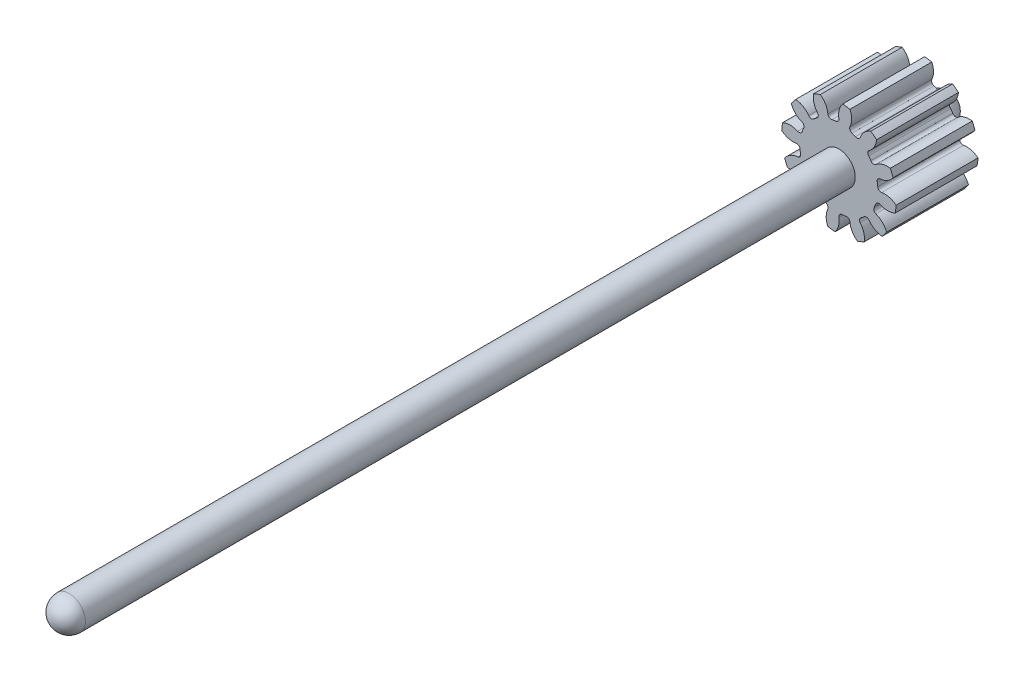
ISO-10303-21;
HEADER;
FILE_DESCRIPTION(('STEP AP214'),'2;1');
FILE_NAME('part.step','',(''),(''),'','','');
FILE_SCHEMA(('AUTOMOTIVE_DESIGN { 1 0 10303 214 1 1 1 1 }'));
ENDSEC;
DATA;
#1=APPLICATION_CONTEXT('core data for automotive mechanical design processes');
#2=APPLICATION_PROTOCOL_DEFINITION('international standard','automotive_design',2000,#1);
#3=PRODUCT_CONTEXT('',#1,'mechanical');
#4=PRODUCT('Part','Part','',(#3));
#5=PRODUCT_RELATED_PRODUCT_CATEGORY('part','',(#4));
#6=PRODUCT_DEFINITION_FORMATION('','',#4);
#7=PRODUCT_DEFINITION_CONTEXT('part definition',#1,'design');
#8=PRODUCT_DEFINITION('design','',#6,#7);
#9=PRODUCT_DEFINITION_SHAPE('','',#8);
#10=(LENGTH_UNIT() NAMED_UNIT(*) SI_UNIT(.MILLI.,.METRE.));
#11=(NAMED_UNIT(*) PLANE_ANGLE_UNIT() SI_UNIT($,.RADIAN.));
#12=(NAMED_UNIT(*) SI_UNIT($,.STERADIAN.) SOLID_ANGLE_UNIT());
#13=UNCERTAINTY_MEASURE_WITH_UNIT(LENGTH_MEASURE(1.E-05),#10,'distance_accuracy_value','');
#14=(GEOMETRIC_REPRESENTATION_CONTEXT(3) GLOBAL_UNCERTAINTY_ASSIGNED_CONTEXT((#13)) GLOBAL_UNIT_ASSIGNED_CONTEXT((#10,
#11,#12)) REPRESENTATION_CONTEXT('',''));
#15=CARTESIAN_POINT('',(0.,0.,0.));
#16=DIRECTION('',(0.,0.,1.));
#17=DIRECTION('',(1.,0.,0.));
#18=AXIS2_PLACEMENT_3D('',#15,#16,#17);
#19=CARTESIAN_POINT('',(0.,0.,0.));
#20=DIRECTION('',(0.,0.,-1.));
#21=DIRECTION('',(-1.,0.,0.));
#22=AXIS2_PLACEMENT_3D('',#19,#20,#21);
#23=CYLINDRICAL_SURFACE('',#22,2.38);
#24=CARTESIAN_POINT('',(0.,0.,2.));
#25=DIRECTION('',(0.,0.,-1.));
#26=DIRECTION('',(-1.,0.,0.));
#27=AXIS2_PLACEMENT_3D('',#24,#25,#26);
#28=CIRCLE('',#27,2.38);
#29=CARTESIAN_POINT('',(2.34251029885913,0.420767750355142,2.));
#30=VERTEX_POINT('',#29);
#31=CARTESIAN_POINT('',(2.37168318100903,0.198793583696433,2.));
#32=VERTEX_POINT('',#31);
#33=EDGE_CURVE('E1313',#30,#32,#28,.T.);
#34=ORIENTED_EDGE('',*,*,#33,.F.);
#35=DIRECTION('',(0.,0.,-1.));
#36=VECTOR('',#35,1.);
#37=CARTESIAN_POINT('',(2.34251029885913,0.420767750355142,0.));
#38=LINE('',#37,#36);
#39=CARTESIAN_POINT('',(2.34251029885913,0.420767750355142,7.));
#40=VERTEX_POINT('',#39);
#41=EDGE_CURVE('E676',#30,#40,#38,.F.);
#42=ORIENTED_EDGE('',*,*,#41,.T.);
#43=CARTESIAN_POINT('',(0.,0.,7.));
#44=DIRECTION('',(0.,0.,-1.));
#45=DIRECTION('',(-1.,0.,0.));
#46=AXIS2_PLACEMENT_3D('',#43,#44,#45);
#47=CIRCLE('',#46,2.38);
#48=CARTESIAN_POINT('',(2.37168318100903,0.198793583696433,7.));
#49=VERTEX_POINT('',#48);
#50=EDGE_CURVE('E653',#40,#49,#47,.T.);
#51=ORIENTED_EDGE('',*,*,#50,.T.);
#52=DIRECTION('',(0.,0.,-1.));
#53=VECTOR('',#52,1.);
#54=CARTESIAN_POINT('',(2.37168318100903,0.198793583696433,0.));
#55=LINE('',#54,#53);
#56=EDGE_CURVE('E1310',#49,#32,#55,.T.);
#57=ORIENTED_EDGE('',*,*,#56,.T.);
#58=EDGE_LOOP('',(#34,#42,#51,#57));
#59=FACE_BOUND('',#58,.T.);
#60=ADVANCED_FACE('F39',(#59),#23,.T.);
#61=CARTESIAN_POINT('',(1.81828955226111,1.53565071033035,7.));
#62=VERTEX_POINT('',#61);
#63=CARTESIAN_POINT('',(1.95454109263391,1.35800188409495,7.));
#64=VERTEX_POINT('',#63);
#65=EDGE_CURVE('E1408',#62,#64,#47,.T.);
#66=ORIENTED_EDGE('',*,*,#65,.T.);
#67=DIRECTION('',(0.,0.,-1.));
#68=VECTOR('',#67,1.);
#69=CARTESIAN_POINT('',(1.95454109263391,1.35800188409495,0.));
#70=LINE('',#69,#68);
#71=CARTESIAN_POINT('',(1.95454109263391,1.35800188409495,2.));
#72=VERTEX_POINT('',#71);
#73=EDGE_CURVE('E693',#64,#72,#70,.T.);
#74=ORIENTED_EDGE('',*,*,#73,.T.);
#75=CARTESIAN_POINT('',(1.81828955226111,1.53565071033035,2.));
#76=VERTEX_POINT('',#75);
#77=EDGE_CURVE('E1476',#76,#72,#28,.T.);
#78=ORIENTED_EDGE('',*,*,#77,.F.);
#79=DIRECTION('',(0.,0.,-1.));
#80=VECTOR('',#79,1.);
#81=CARTESIAN_POINT('',(1.81828955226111,1.53565071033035,0.));
#82=LINE('',#81,#80);
#83=EDGE_CURVE('E731',#76,#62,#82,.F.);
#84=ORIENTED_EDGE('',*,*,#83,.T.);
#85=EDGE_LOOP('',(#66,#74,#78,#84));
#86=FACE_BOUND('',#85,.T.);
#87=ADVANCED_FACE('F1350',(#86),#23,.T.);
#88=CARTESIAN_POINT('',(0.806859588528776,2.23905730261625,7.));
#89=VERTEX_POINT('',#88);
#90=CARTESIAN_POINT('',(1.01368129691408,2.15333467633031,7.));
#91=VERTEX_POINT('',#90);
#92=EDGE_CURVE('E1410',#89,#91,#47,.T.);
#93=ORIENTED_EDGE('',*,*,#92,.T.);
#94=DIRECTION('',(0.,0.,-1.));
#95=VECTOR('',#94,1.);
#96=CARTESIAN_POINT('',(1.01368129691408,2.15333467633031,0.));
#97=LINE('',#96,#95);
#98=CARTESIAN_POINT('',(1.01368129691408,2.15333467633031,2.));
#99=VERTEX_POINT('',#98);
#100=EDGE_CURVE('E748',#91,#99,#97,.T.);
#101=ORIENTED_EDGE('',*,*,#100,.T.);
#102=CARTESIAN_POINT('',(0.806859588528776,2.23905730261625,2.));
#103=VERTEX_POINT('',#102);
#104=EDGE_CURVE('E1473',#103,#99,#28,.T.);
#105=ORIENTED_EDGE('',*,*,#104,.F.);
#106=DIRECTION('',(0.,0.,-1.));
#107=VECTOR('',#106,1.);
#108=CARTESIAN_POINT('',(0.806859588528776,2.23905730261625,0.));
#109=LINE('',#108,#107);
#110=EDGE_CURVE('E770',#103,#89,#109,.F.);
#111=ORIENTED_EDGE('',*,*,#110,.T.);
#112=EDGE_LOOP('',(#93,#101,#105,#111));
#113=FACE_BOUND('',#112,.T.);
#114=ADVANCED_FACE('F1356',(#113),#23,.T.);
#115=CARTESIAN_POINT('',(-0.42076775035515,2.34251029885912,7.));
#116=VERTEX_POINT('',#115);
#117=CARTESIAN_POINT('',(-0.198793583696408,2.37168318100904,7.));
#118=VERTEX_POINT('',#117);
#119=EDGE_CURVE('E1413',#116,#118,#47,.T.);
#120=ORIENTED_EDGE('',*,*,#119,.T.);
#121=DIRECTION('',(0.,0.,-1.));
#122=VECTOR('',#121,1.);
#123=CARTESIAN_POINT('',(-0.198793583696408,2.37168318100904,0.));
#124=LINE('',#123,#122);
#125=CARTESIAN_POINT('',(-0.198793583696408,2.37168318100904,2.));
#126=VERTEX_POINT('',#125);
#127=EDGE_CURVE('E804',#118,#126,#124,.T.);
#128=ORIENTED_EDGE('',*,*,#127,.T.);
#129=CARTESIAN_POINT('',(-0.42076775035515,2.34251029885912,2.));
#130=VERTEX_POINT('',#129);
#131=EDGE_CURVE('E1470',#130,#126,#28,.T.);
#132=ORIENTED_EDGE('',*,*,#131,.F.);
#133=DIRECTION('',(0.,0.,-1.));
#134=VECTOR('',#133,1.);
#135=CARTESIAN_POINT('',(-0.42076775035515,2.34251029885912,0.));
#136=LINE('',#135,#134);
#137=EDGE_CURVE('E843',#130,#116,#136,.F.);
#138=ORIENTED_EDGE('',*,*,#137,.T.);
#139=EDGE_LOOP('',(#120,#128,#132,#138));
#140=FACE_BOUND('',#139,.T.);
#141=ADVANCED_FACE('F1880',(#140),#23,.T.);
#142=CARTESIAN_POINT('',(-1.53565071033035,1.8182895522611,7.));
#143=VERTEX_POINT('',#142);
#144=CARTESIAN_POINT('',(-1.35800188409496,1.95454109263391,7.));
#145=VERTEX_POINT('',#144);
#146=EDGE_CURVE('E1417',#143,#145,#47,.T.);
#147=ORIENTED_EDGE('',*,*,#146,.T.);
#148=DIRECTION('',(0.,0.,-1.));
#149=VECTOR('',#148,1.);
#150=CARTESIAN_POINT('',(-1.35800188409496,1.95454109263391,0.));
#151=LINE('',#150,#149);
#152=CARTESIAN_POINT('',(-1.35800188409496,1.95454109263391,2.));
#153=VERTEX_POINT('',#152);
#154=EDGE_CURVE('E860',#145,#153,#151,.T.);
#155=ORIENTED_EDGE('',*,*,#154,.T.);
#156=CARTESIAN_POINT('',(-1.53565071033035,1.8182895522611,2.));
#157=VERTEX_POINT('',#156);
#158=EDGE_CURVE('E1467',#157,#153,#28,.T.);
#159=ORIENTED_EDGE('',*,*,#158,.F.);
#160=DIRECTION('',(0.,0.,-1.));
#161=VECTOR('',#160,1.);
#162=CARTESIAN_POINT('',(-1.53565071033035,1.8182895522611,0.));
#163=LINE('',#162,#161);
#164=EDGE_CURVE('E899',#157,#143,#163,.F.);
#165=ORIENTED_EDGE('',*,*,#164,.T.);
#166=EDGE_LOOP('',(#147,#155,#159,#165));
#167=FACE_BOUND('',#166,.T.);
#168=ADVANCED_FACE('F1872',(#167),#23,.T.);
#169=CARTESIAN_POINT('',(-2.23905730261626,0.806859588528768,7.));
#170=VERTEX_POINT('',#169);
#171=CARTESIAN_POINT('',(-2.15333467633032,1.01368129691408,7.));
#172=VERTEX_POINT('',#171);
#173=EDGE_CURVE('E1421',#170,#172,#47,.T.);
#174=ORIENTED_EDGE('',*,*,#173,.T.);
#175=DIRECTION('',(0.,0.,-1.));
#176=VECTOR('',#175,1.);
#177=CARTESIAN_POINT('',(-2.15333467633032,1.01368129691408,0.));
#178=LINE('',#177,#176);
#179=CARTESIAN_POINT('',(-2.15333467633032,1.01368129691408,2.));
#180=VERTEX_POINT('',#179);
#181=EDGE_CURVE('E916',#172,#180,#178,.T.);
#182=ORIENTED_EDGE('',*,*,#181,.T.);
#183=CARTESIAN_POINT('',(-2.23905730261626,0.806859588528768,2.));
#184=VERTEX_POINT('',#183);
#185=EDGE_CURVE('E1463',#184,#180,#28,.T.);
#186=ORIENTED_EDGE('',*,*,#185,.F.);
#187=DIRECTION('',(0.,0.,-1.));
#188=VECTOR('',#187,1.);
#189=CARTESIAN_POINT('',(-2.23905730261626,0.806859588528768,0.));
#190=LINE('',#189,#188);
#191=EDGE_CURVE('E939',#184,#170,#190,.F.);
#192=ORIENTED_EDGE('',*,*,#191,.T.);
#193=EDGE_LOOP('',(#174,#182,#186,#192));
#194=FACE_BOUND('',#193,.T.);
#195=ADVANCED_FACE('F1864',(#194),#23,.T.);
#196=CARTESIAN_POINT('',(-0.80685958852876,-2.23905730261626,2.));
#197=VERTEX_POINT('',#196);
#198=CARTESIAN_POINT('',(-1.01368129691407,-2.15333467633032,2.));
#199=VERTEX_POINT('',#198);
#200=EDGE_CURVE('E1459',#197,#199,#28,.T.);
#201=ORIENTED_EDGE('',*,*,#200,.F.);
#202=DIRECTION('',(0.,0.,-1.));
#203=VECTOR('',#202,1.);
#204=CARTESIAN_POINT('',(-0.80685958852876,-2.23905730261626,0.));
#205=LINE('',#204,#203);
#206=CARTESIAN_POINT('',(-0.806859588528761,-2.23905730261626,7.));
#207=VERTEX_POINT('',#206);
#208=EDGE_CURVE('E1013',#197,#207,#205,.F.);
#209=ORIENTED_EDGE('',*,*,#208,.T.);
#210=CARTESIAN_POINT('',(-1.01368129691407,-2.15333467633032,7.));
#211=VERTEX_POINT('',#210);
#212=EDGE_CURVE('E1426',#207,#211,#47,.T.);
#213=ORIENTED_EDGE('',*,*,#212,.T.);
#214=DIRECTION('',(0.,0.,-1.));
#215=VECTOR('',#214,1.);
#216=CARTESIAN_POINT('',(-1.01368129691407,-2.15333467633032,0.));
#217=LINE('',#216,#215);
#218=EDGE_CURVE('E1198',#211,#199,#217,.T.);
#219=ORIENTED_EDGE('',*,*,#218,.T.);
#220=EDGE_LOOP('',(#201,#209,#213,#219));
#221=FACE_BOUND('',#220,.T.);
#222=ADVANCED_FACE('F1855',(#221),#23,.T.);
#223=CARTESIAN_POINT('',(-2.34251029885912,-0.420767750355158,7.));
#224=VERTEX_POINT('',#223);
#225=CARTESIAN_POINT('',(-2.37168318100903,-0.198793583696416,7.));
#226=VERTEX_POINT('',#225);
#227=EDGE_CURVE('E1425',#224,#226,#47,.T.);
#228=ORIENTED_EDGE('',*,*,#227,.T.);
#229=DIRECTION('',(0.,0.,-1.));
#230=VECTOR('',#229,1.);
#231=CARTESIAN_POINT('',(-2.37168318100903,-0.198793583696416,0.));
#232=LINE('',#231,#230);
#233=CARTESIAN_POINT('',(-2.37168318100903,-0.198793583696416,2.));
#234=VERTEX_POINT('',#233);
#235=EDGE_CURVE('E974',#226,#234,#232,.T.);
#236=ORIENTED_EDGE('',*,*,#235,.T.);
#237=CARTESIAN_POINT('',(-2.34251029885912,-0.420767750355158,2.));
#238=VERTEX_POINT('',#237);
#239=EDGE_CURVE('E1460',#238,#234,#28,.T.);
#240=ORIENTED_EDGE('',*,*,#239,.F.);
#241=DIRECTION('',(0.,0.,-1.));
#242=VECTOR('',#241,1.);
#243=CARTESIAN_POINT('',(-2.34251029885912,-0.420767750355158,0.));
#244=LINE('',#243,#242);
#245=EDGE_CURVE('E1069',#238,#224,#244,.F.);
#246=ORIENTED_EDGE('',*,*,#245,.T.);
#247=EDGE_LOOP('',(#228,#236,#240,#246));
#248=FACE_BOUND('',#247,.T.);
#249=ADVANCED_FACE('F1846',(#248),#23,.T.);
#250=CARTESIAN_POINT('',(0.420767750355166,-2.34251029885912,7.));
#251=VERTEX_POINT('',#250);
#252=CARTESIAN_POINT('',(0.198793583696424,-2.37168318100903,7.));
#253=VERTEX_POINT('',#252);
#254=EDGE_CURVE('E1431',#251,#253,#47,.T.);
#255=ORIENTED_EDGE('',*,*,#254,.T.);
#256=DIRECTION('',(0.,0.,-1.));
#257=VECTOR('',#256,1.);
#258=CARTESIAN_POINT('',(0.198793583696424,-2.37168318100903,0.));
#259=LINE('',#258,#257);
#260=CARTESIAN_POINT('',(0.198793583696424,-2.37168318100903,2.));
#261=VERTEX_POINT('',#260);
#262=EDGE_CURVE('E1030',#253,#261,#259,.T.);
#263=ORIENTED_EDGE('',*,*,#262,.T.);
#264=CARTESIAN_POINT('',(0.420767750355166,-2.34251029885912,2.));
#265=VERTEX_POINT('',#264);
#266=EDGE_CURVE('E1456',#265,#261,#28,.T.);
#267=ORIENTED_EDGE('',*,*,#266,.F.);
#268=DIRECTION('',(0.,0.,-1.));
#269=VECTOR('',#268,1.);
#270=CARTESIAN_POINT('',(0.420767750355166,-2.34251029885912,0.));
#271=LINE('',#270,#269);
#272=EDGE_CURVE('E1125',#265,#251,#271,.F.);
#273=ORIENTED_EDGE('',*,*,#272,.T.);
#274=EDGE_LOOP('',(#255,#263,#267,#273));
#275=FACE_BOUND('',#274,.T.);
#276=ADVANCED_FACE('F1838',(#275),#23,.T.);
#277=CARTESIAN_POINT('',(-1.8182895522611,-1.53565071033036,7.));
#278=VERTEX_POINT('',#277);
#279=CARTESIAN_POINT('',(-1.9545410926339,-1.35800188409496,7.));
#280=VERTEX_POINT('',#279);
#281=EDGE_CURVE('E1430',#278,#280,#47,.T.);
#282=ORIENTED_EDGE('',*,*,#281,.T.);
#283=DIRECTION('',(0.,0.,-1.));
#284=VECTOR('',#283,1.);
#285=CARTESIAN_POINT('',(-1.9545410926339,-1.35800188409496,0.));
#286=LINE('',#285,#284);
#287=CARTESIAN_POINT('',(-1.9545410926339,-1.35800188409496,2.));
#288=VERTEX_POINT('',#287);
#289=EDGE_CURVE('E1086',#280,#288,#286,.T.);
#290=ORIENTED_EDGE('',*,*,#289,.T.);
#291=CARTESIAN_POINT('',(-1.8182895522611,-1.53565071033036,2.));
#292=VERTEX_POINT('',#291);
#293=EDGE_CURVE('E1457',#292,#288,#28,.T.);
#294=ORIENTED_EDGE('',*,*,#293,.F.);
#295=DIRECTION('',(0.,0.,-1.));
#296=VECTOR('',#295,1.);
#297=CARTESIAN_POINT('',(-1.8182895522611,-1.53565071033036,0.));
#298=LINE('',#297,#296);
#299=EDGE_CURVE('E1164',#292,#278,#298,.F.);
#300=ORIENTED_EDGE('',*,*,#299,.T.);
#301=EDGE_LOOP('',(#282,#290,#294,#300));
#302=FACE_BOUND('',#301,.T.);
#303=ADVANCED_FACE('F1367',(#302),#23,.T.);
#304=CARTESIAN_POINT('',(1.53565071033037,-1.81828955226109,7.));
#305=VERTEX_POINT('',#304);
#306=CARTESIAN_POINT('',(1.35800188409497,-1.9545410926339,7.));
#307=VERTEX_POINT('',#306);
#308=EDGE_CURVE('E1322',#305,#307,#47,.T.);
#309=ORIENTED_EDGE('',*,*,#308,.T.);
#310=DIRECTION('',(0.,0.,-1.));
#311=VECTOR('',#310,1.);
#312=CARTESIAN_POINT('',(1.35800188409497,-1.9545410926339,0.));
#313=LINE('',#312,#311);
#314=CARTESIAN_POINT('',(1.35800188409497,-1.9545410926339,2.));
#315=VERTEX_POINT('',#314);
#316=EDGE_CURVE('E1142',#307,#315,#313,.T.);
#317=ORIENTED_EDGE('',*,*,#316,.T.);
#318=CARTESIAN_POINT('',(1.53565071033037,-1.81828955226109,2.));
#319=VERTEX_POINT('',#318);
#320=EDGE_CURVE('E1317',#319,#315,#28,.T.);
#321=ORIENTED_EDGE('',*,*,#320,.F.);
#322=DIRECTION('',(0.,0.,-1.));
#323=VECTOR('',#322,1.);
#324=CARTESIAN_POINT('',(1.53565071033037,-1.81828955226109,0.));
#325=LINE('',#324,#323);
#326=EDGE_CURVE('E1240',#319,#305,#325,.F.);
#327=ORIENTED_EDGE('',*,*,#326,.T.);
#328=EDGE_LOOP('',(#309,#317,#321,#327));
#329=FACE_BOUND('',#328,.T.);
#330=ADVANCED_FACE('F1362',(#329),#23,.T.);
#331=CARTESIAN_POINT('',(2.23905730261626,-0.806859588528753,7.));
#332=VERTEX_POINT('',#331);
#333=CARTESIAN_POINT('',(2.15333467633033,-1.01368129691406,7.));
#334=VERTEX_POINT('',#333);
#335=EDGE_CURVE('E1318',#332,#334,#47,.T.);
#336=ORIENTED_EDGE('',*,*,#335,.T.);
#337=DIRECTION('',(0.,0.,-1.));
#338=VECTOR('',#337,1.);
#339=CARTESIAN_POINT('',(2.15333467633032,-1.01368129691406,0.));
#340=LINE('',#339,#338);
#341=CARTESIAN_POINT('',(2.15333467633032,-1.01368129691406,2.));
#342=VERTEX_POINT('',#341);
#343=EDGE_CURVE('E1254',#334,#342,#340,.T.);
#344=ORIENTED_EDGE('',*,*,#343,.T.);
#345=CARTESIAN_POINT('',(2.23905730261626,-0.806859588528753,2.));
#346=VERTEX_POINT('',#345);
#347=EDGE_CURVE('E1314',#346,#342,#28,.T.);
#348=ORIENTED_EDGE('',*,*,#347,.F.);
#349=DIRECTION('',(0.,0.,-1.));
#350=VECTOR('',#349,1.);
#351=CARTESIAN_POINT('',(2.23905730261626,-0.806859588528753,0.));
#352=LINE('',#351,#350);
#353=EDGE_CURVE('E1296',#346,#332,#352,.F.);
#354=ORIENTED_EDGE('',*,*,#353,.T.);
#355=EDGE_LOOP('',(#336,#344,#348,#354));
#356=FACE_BOUND('',#355,.T.);
#357=ADVANCED_FACE('F1347',(#356),#23,.T.);
#358=CARTESIAN_POINT('',(0.,0.,55.));
#359=DIRECTION('',(0.,0.,-1.));
#360=DIRECTION('',(-1.,0.,0.));
#361=AXIS2_PLACEMENT_3D('',#358,#359,#360);
#362=CYLINDRICAL_SURFACE('',#361,0.999999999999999);
#363=CARTESIAN_POINT('',(0.,0.,54.));
#364=DIRECTION('',(0.,0.,-1.));
#365=DIRECTION('',(-1.,0.,0.));
#366=AXIS2_PLACEMENT_3D('',#363,#364,#365);
#367=CIRCLE('',#366,0.999999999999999);
#368=CARTESIAN_POINT('',(-0.999999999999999,0.,54.));
#369=VERTEX_POINT('',#368);
#370=EDGE_CURVE('E1325',#369,#369,#367,.T.);
#371=ORIENTED_EDGE('',*,*,#370,.T.);
#372=EDGE_LOOP('',(#371));
#373=FACE_BOUND('',#372,.T.);
#374=CARTESIAN_POINT('',(0.,0.,7.));
#375=DIRECTION('',(0.,0.,-1.));
#376=DIRECTION('',(-1.,0.,0.));
#377=AXIS2_PLACEMENT_3D('',#374,#375,#376);
#378=CIRCLE('',#377,0.999999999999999);
#379=CARTESIAN_POINT('',(-0.999999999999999,0.,7.));
#380=VERTEX_POINT('',#379);
#381=EDGE_CURVE('E11',#380,#380,#378,.T.);
#382=ORIENTED_EDGE('',*,*,#381,.F.);
#383=EDGE_LOOP('',(#382));
#384=FACE_BOUND('',#383,.T.);
#385=ADVANCED_FACE('F41',(#373,#384),#362,.T.);
#386=CARTESIAN_POINT('',(0.,0.,54.));
#387=DIRECTION('',(0.,0.,1.));
#388=DIRECTION('',(1.,0.,0.));
#389=AXIS2_PLACEMENT_3D('',#386,#387,#388);
#390=SPHERICAL_SURFACE('',#389,1.);
#391=ORIENTED_EDGE('',*,*,#370,.F.);
#392=EDGE_LOOP('',(#391));
#393=FACE_BOUND('',#392,.T.);
#394=ADVANCED_FACE('F1346',(#393),#390,.T.);
#395=CARTESIAN_POINT('',(1.,0.,7.));
#396=DIRECTION('',(0.,0.,-1.));
#397=DIRECTION('',(-1.,0.,0.));
#398=AXIS2_PLACEMENT_3D('',#395,#396,#397);
#399=PLANE('',#398);
#400=CARTESIAN_POINT('',(2.12827571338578,1.45836980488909,7.));
#401=DIRECTION('',(0.,0.,1.));
#402=DIRECTION('',(-0.866025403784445,-0.499999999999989,0.));
#403=AXIS2_PLACEMENT_3D('',#400,#401,#402);
#404=CIRCLE('',#403,0.199999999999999);
#405=CARTESIAN_POINT('',(1.95507063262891,1.35836980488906,7.));
#406=VERTEX_POINT('',#405);
#407=CARTESIAN_POINT('',(2.25686494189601,1.30518752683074,7.));
#408=VERTEX_POINT('',#407);
#409=EDGE_CURVE('E670',#406,#408,#404,.T.);
#410=ORIENTED_EDGE('',*,*,#409,.F.);
#411=DIRECTION('',(0.821235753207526,0.570589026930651,0.));
#412=VECTOR('',#411,1.);
#413=CARTESIAN_POINT('',(1.95507063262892,1.35836980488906,7.));
#414=LINE('',#413,#412);
#415=EDGE_CURVE('E657',#64,#406,#414,.T.);
#416=ORIENTED_EDGE('',*,*,#415,.F.);
#417=ORIENTED_EDGE('',*,*,#65,.F.);
#418=DIRECTION('',(-0.763987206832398,-0.645231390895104,0.));
#419=VECTOR('',#418,1.);
#420=CARTESIAN_POINT('',(1.8187821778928,1.53606676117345,7.));
#421=LINE('',#420,#419);
#422=CARTESIAN_POINT('',(1.8187821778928,1.53606676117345,7.));
#423=VERTEX_POINT('',#422);
#424=EDGE_CURVE('E700',#423,#62,#421,.T.);
#425=ORIENTED_EDGE('',*,*,#424,.F.);
#426=CARTESIAN_POINT('',(1.96026686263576,1.67742476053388,7.));
#427=DIRECTION('',(0.,0.,1.));
#428=DIRECTION('',(-0.50000000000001,-0.866025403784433,0.));
#429=AXIS2_PLACEMENT_3D('',#426,#427,#428);
#430=CIRCLE('',#429,0.199999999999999);
#431=CARTESIAN_POINT('',(1.84401093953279,1.84016553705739,7.));
#432=VERTEX_POINT('',#431);
#433=EDGE_CURVE('E718',#432,#423,#430,.T.);
#434=ORIENTED_EDGE('',*,*,#433,.F.);
#435=CARTESIAN_POINT('',(1.20460336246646,2.73523980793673,7.));
#436=DIRECTION('',(0.,0.,-1.));
#437=DIRECTION('',(-0.50000000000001,-0.866025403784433,0.));
#438=AXIS2_PLACEMENT_3D('',#435,#436,#437);
#439=CIRCLE('',#438,1.1);
#440=CARTESIAN_POINT('',(2.30029053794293,2.63792786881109,7.));
#441=VERTEX_POINT('',#440);
#442=EDGE_CURVE('E714',#441,#432,#439,.T.);
#443=ORIENTED_EDGE('',*,*,#442,.F.);
#444=CARTESIAN_POINT('',(0.,0.,7.));
#445=DIRECTION('',(0.,0.,-1.));
#446=DIRECTION('',(-0.50000000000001,-0.866025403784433,0.));
#447=AXIS2_PLACEMENT_3D('',#444,#445,#446);
#448=CIRCLE('',#447,3.5);
#449=CARTESIAN_POINT('',(1.94381785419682,2.91059652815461,7.));
#450=VERTEX_POINT('',#449);
#451=EDGE_CURVE('E711',#450,#441,#448,.T.);
#452=ORIENTED_EDGE('',*,*,#451,.F.);
#453=CARTESIAN_POINT('',(2.33564833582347,1.88274981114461,7.));
#454=DIRECTION('',(0.,0.,-1.));
#455=DIRECTION('',(-0.50000000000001,-0.866025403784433,0.));
#456=AXIS2_PLACEMENT_3D('',#453,#454,#455);
#457=CIRCLE('',#456,1.1);
#458=CARTESIAN_POINT('',(1.30190860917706,2.25875802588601,7.));
#459=VERTEX_POINT('',#458);
#460=EDGE_CURVE('E708',#459,#450,#457,.T.);
#461=ORIENTED_EDGE('',*,*,#460,.F.);
#462=CARTESIAN_POINT('',(1.11395593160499,2.327123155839,7.));
#463=DIRECTION('',(0.,0.,1.));
#464=DIRECTION('',(-0.50000000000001,-0.866025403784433,0.));
#465=AXIS2_PLACEMENT_3D('',#462,#463,#464);
#466=CIRCLE('',#465,0.199999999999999);
#467=CARTESIAN_POINT('',(1.01395593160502,2.15391807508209,7.));
#468=VERTEX_POINT('',#467);
#469=EDGE_CURVE('E705',#468,#459,#466,.T.);
#470=ORIENTED_EDGE('',*,*,#469,.F.);
#471=DIRECTION('',(0.425916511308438,0.904762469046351,0.));
#472=VECTOR('',#471,1.);
#473=CARTESIAN_POINT('',(1.01395593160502,2.15391807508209,7.));
#474=LINE('',#473,#472);
#475=EDGE_CURVE('E696',#91,#468,#474,.T.);
#476=ORIENTED_EDGE('',*,*,#475,.F.);
#477=ORIENTED_EDGE('',*,*,#92,.F.);
#478=DIRECTION('',(-0.33901663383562,-0.940780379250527,0.));
#479=VECTOR('',#478,1.);
#480=CARTESIAN_POINT('',(0.807078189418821,2.23966392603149,7.));
#481=LINE('',#480,#479);
#482=CARTESIAN_POINT('',(0.807078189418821,2.23966392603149,7.));
#483=VERTEX_POINT('',#482);
#484=EDGE_CURVE('E791',#483,#89,#481,.T.);
#485=ORIENTED_EDGE('',*,*,#484,.F.);
#486=CARTESIAN_POINT('',(0.858928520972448,2.43282588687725,7.));
#487=DIRECTION('',(0.,0.,1.));
#488=DIRECTION('',(0.,-1.,0.));
#489=AXIS2_PLACEMENT_3D('',#486,#487,#488);
#490=CIRCLE('',#489,0.199999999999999);
#491=CARTESIAN_POINT('',(0.67687754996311,2.51563557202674,7.));
#492=VERTEX_POINT('',#491);
#493=EDGE_CURVE('E789',#492,#483,#490,.T.);
#494=ORIENTED_EDGE('',*,*,#493,.F.);
#495=CARTESIAN_POINT('',(-0.324402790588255,2.9710888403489,7.));
#496=DIRECTION('',(0.,0.,-1.));
#497=DIRECTION('',(0.,-1.,0.));
#498=AXIS2_PLACEMENT_3D('',#495,#496,#497);
#499=CIRCLE('',#498,1.1);
#500=CARTESIAN_POINT('',(0.673146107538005,3.43465781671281,7.));
#501=VERTEX_POINT('',#500);
#502=EDGE_CURVE('E785',#501,#492,#499,.T.);
#503=ORIENTED_EDGE('',*,*,#502,.F.);
#504=CARTESIAN_POINT('',(0.,0.,7.));
#505=DIRECTION('',(0.,0.,-1.));
#506=DIRECTION('',(0.,-1.,0.));
#507=AXIS2_PLACEMENT_3D('',#504,#505,#506);
#508=CIRCLE('',#507,3.5);
#509=CARTESIAN_POINT('',(0.228097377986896,3.49255946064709,7.));
#510=VERTEX_POINT('',#509);
#511=EDGE_CURVE('E781',#510,#501,#508,.T.);
#512=ORIENTED_EDGE('',*,*,#511,.F.);
#513=CARTESIAN_POINT('',(1.08135588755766,2.79833333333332,7.));
#514=DIRECTION('',(0.,0.,-1.));
#515=DIRECTION('',(0.,-1.,0.));
#516=AXIS2_PLACEMENT_3D('',#513,#514,#515);
#517=CIRCLE('',#516,1.1);
#518=CARTESIAN_POINT('',(-0.00189308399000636,2.60709613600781,7.));
#519=VERTEX_POINT('',#518);
#520=EDGE_CURVE('E777',#519,#510,#517,.T.);
#521=ORIENTED_EDGE('',*,*,#520,.F.);
#522=CARTESIAN_POINT('',(-0.198847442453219,2.57232573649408,7.));
#523=DIRECTION('',(0.,0.,1.));
#524=DIRECTION('',(0.,-1.,0.));
#525=AXIS2_PLACEMENT_3D('',#522,#523,#524);
#526=CIRCLE('',#525,0.199999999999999);
#527=CARTESIAN_POINT('',(-0.198847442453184,2.37232573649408,7.));
#528=VERTEX_POINT('',#527);
#529=EDGE_CURVE('E774',#528,#519,#526,.T.);
#530=ORIENTED_EDGE('',*,*,#529,.F.);
#531=DIRECTION('',(-0.0835267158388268,0.996505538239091,0.));
#532=VECTOR('',#531,1.);
#533=CARTESIAN_POINT('',(-0.198847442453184,2.37232573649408,7.));
#534=LINE('',#533,#532);
#535=EDGE_CURVE('E751',#118,#528,#534,.T.);
#536=ORIENTED_EDGE('',*,*,#535,.F.);
#537=ORIENTED_EDGE('',*,*,#119,.F.);
#538=DIRECTION('',(0.17679317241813,-0.984248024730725,0.));
#539=VECTOR('',#538,1.);
#540=CARTESIAN_POINT('',(-0.420881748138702,2.34314495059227,7.));
#541=LINE('',#540,#539);
#542=CARTESIAN_POINT('',(-0.420881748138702,2.34314495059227,7.));
#543=VERTEX_POINT('',#542);
#544=EDGE_CURVE('E811',#543,#116,#541,.T.);
#545=ORIENTED_EDGE('',*,*,#544,.F.);
#546=CARTESIAN_POINT('',(-0.472559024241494,2.53635328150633,7.));
#547=DIRECTION('',(0.,0.,1.));
#548=DIRECTION('',(0.499999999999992,-0.866025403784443,0.));
#549=AXIS2_PLACEMENT_3D('',#546,#547,#548);
#550=CIRCLE('',#549,0.199999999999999);
#551=CARTESIAN_POINT('',(-0.671624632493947,2.5170430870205,7.));
#552=VERTEX_POINT('',#551);
#553=EDGE_CURVE('E829',#552,#543,#550,.T.);
#554=ORIENTED_EDGE('',*,*,#553,.F.);
#555=CARTESIAN_POINT('',(-1.76648547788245,2.41083701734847,7.));
#556=DIRECTION('',(0.,0.,-1.));
#557=DIRECTION('',(0.499999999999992,-0.866025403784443,0.));
#558=AXIS2_PLACEMENT_3D('',#555,#556,#557);
#559=CIRCLE('',#558,1.1);
#560=CARTESIAN_POINT('',(-1.13436727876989,3.31107397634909,7.));
#561=VERTEX_POINT('',#560);
#562=EDGE_CURVE('E825',#561,#552,#559,.T.);
#563=ORIENTED_EDGE('',*,*,#562,.F.);
#564=CARTESIAN_POINT('',(0.,0.,7.));
#565=DIRECTION('',(0.,0.,-1.));
#566=DIRECTION('',(0.499999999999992,-0.866025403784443,0.));
#567=AXIS2_PLACEMENT_3D('',#564,#565,#566);
#568=CIRCLE('',#567,3.5);
#569=CARTESIAN_POINT('',(-1.54874160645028,3.1386939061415,7.));
#570=VERTEX_POINT('',#569);
#571=EDGE_CURVE('E822',#570,#561,#568,.T.);
#572=ORIENTED_EDGE('',*,*,#571,.F.);
#573=CARTESIAN_POINT('',(-0.46268499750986,2.96410569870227,7.));
#574=DIRECTION('',(0.,0.,-1.));
#575=DIRECTION('',(0.499999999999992,-0.866025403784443,0.));
#576=AXIS2_PLACEMENT_3D('',#573,#574,#575);
#577=CIRCLE('',#576,1.1);
#578=CARTESIAN_POINT('',(-1.30518752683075,2.25686494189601,7.));
#579=VERTEX_POINT('',#578);
#580=EDGE_CURVE('E819',#579,#570,#577,.T.);
#581=ORIENTED_EDGE('',*,*,#580,.F.);
#582=CARTESIAN_POINT('',(-1.45836980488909,2.12827571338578,7.));
#583=DIRECTION('',(0.,0.,1.));
#584=DIRECTION('',(0.499999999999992,-0.866025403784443,0.));
#585=AXIS2_PLACEMENT_3D('',#582,#583,#584);
#586=CIRCLE('',#585,0.199999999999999);
#587=CARTESIAN_POINT('',(-1.35836980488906,1.95507063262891,7.));
#588=VERTEX_POINT('',#587);
#589=EDGE_CURVE('E816',#588,#579,#586,.T.);
#590=ORIENTED_EDGE('',*,*,#589,.F.);
#591=DIRECTION('',(-0.570589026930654,0.821235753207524,0.));
#592=VECTOR('',#591,1.);
#593=CARTESIAN_POINT('',(-1.35836980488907,1.95507063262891,7.));
#594=LINE('',#593,#592);
#595=EDGE_CURVE('E807',#145,#588,#594,.T.);
#596=ORIENTED_EDGE('',*,*,#595,.F.);
#597=ORIENTED_EDGE('',*,*,#146,.F.);
#598=DIRECTION('',(0.645231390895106,-0.763987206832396,0.));
#599=VECTOR('',#598,1.);
#600=CARTESIAN_POINT('',(-1.53606676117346,1.81878217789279,7.));
#601=LINE('',#600,#599);
#602=CARTESIAN_POINT('',(-1.53606676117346,1.81878217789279,7.));
#603=VERTEX_POINT('',#602);
#604=EDGE_CURVE('E867',#603,#143,#601,.T.);
#605=ORIENTED_EDGE('',*,*,#604,.F.);
#606=CARTESIAN_POINT('',(-1.67742476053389,1.96026686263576,7.));
#607=DIRECTION('',(0.,0.,1.));
#608=DIRECTION('',(0.866025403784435,-0.500000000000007,0.));
#609=AXIS2_PLACEMENT_3D('',#606,#607,#608);
#610=CIRCLE('',#609,0.199999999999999);
#611=CARTESIAN_POINT('',(-1.8401655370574,1.84401093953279,7.));
#612=VERTEX_POINT('',#611);
#613=EDGE_CURVE('E885',#612,#603,#610,.T.);
#614=ORIENTED_EDGE('',*,*,#613,.F.);
#615=CARTESIAN_POINT('',(-2.73523980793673,1.20460336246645,7.));
#616=DIRECTION('',(0.,0.,-1.));
#617=DIRECTION('',(0.866025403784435,-0.500000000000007,0.));
#618=AXIS2_PLACEMENT_3D('',#615,#616,#617);
#619=CIRCLE('',#618,1.1);
#620=CARTESIAN_POINT('',(-2.6379278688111,2.30029053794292,7.));
#621=VERTEX_POINT('',#620);
#622=EDGE_CURVE('E881',#621,#612,#619,.T.);
#623=ORIENTED_EDGE('',*,*,#622,.F.);
#624=CARTESIAN_POINT('',(0.,0.,7.));
#625=DIRECTION('',(0.,0.,-1.));
#626=DIRECTION('',(0.866025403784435,-0.500000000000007,0.));
#627=AXIS2_PLACEMENT_3D('',#624,#625,#626);
#628=CIRCLE('',#627,3.5);
#629=CARTESIAN_POINT('',(-2.91059652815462,1.94381785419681,7.));
#630=VERTEX_POINT('',#629);
#631=EDGE_CURVE('E878',#630,#621,#628,.T.);
#632=ORIENTED_EDGE('',*,*,#631,.F.);
#633=CARTESIAN_POINT('',(-1.88274981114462,2.33564833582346,7.));
#634=DIRECTION('',(0.,0.,-1.));
#635=DIRECTION('',(0.866025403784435,-0.500000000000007,0.));
#636=AXIS2_PLACEMENT_3D('',#633,#634,#635);
#637=CIRCLE('',#636,1.1);
#638=CARTESIAN_POINT('',(-2.25875802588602,1.30190860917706,7.));
#639=VERTEX_POINT('',#638);
#640=EDGE_CURVE('E875',#639,#630,#637,.T.);
#641=ORIENTED_EDGE('',*,*,#640,.F.);
#642=CARTESIAN_POINT('',(-2.327123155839,1.11395593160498,7.));
#643=DIRECTION('',(0.,0.,1.));
#644=DIRECTION('',(0.866025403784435,-0.500000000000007,0.));
#645=AXIS2_PLACEMENT_3D('',#642,#643,#644);
#646=CIRCLE('',#645,0.199999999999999);
#647=CARTESIAN_POINT('',(-2.1539180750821,1.01395593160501,7.));
#648=VERTEX_POINT('',#647);
#649=EDGE_CURVE('E872',#648,#639,#646,.T.);
#650=ORIENTED_EDGE('',*,*,#649,.F.);
#651=DIRECTION('',(-0.904762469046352,0.425916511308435,0.));
#652=VECTOR('',#651,1.);
#653=CARTESIAN_POINT('',(-2.1539180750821,1.01395593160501,7.));
#654=LINE('',#653,#652);
#655=EDGE_CURVE('E863',#172,#648,#654,.T.);
#656=ORIENTED_EDGE('',*,*,#655,.F.);
#657=ORIENTED_EDGE('',*,*,#173,.F.);
#658=DIRECTION('',(0.940780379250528,-0.339016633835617,0.));
#659=VECTOR('',#658,1.);
#660=CARTESIAN_POINT('',(-2.2396639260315,0.807078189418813,7.));
#661=LINE('',#660,#659);
#662=CARTESIAN_POINT('',(-2.2396639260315,0.807078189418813,7.));
#663=VERTEX_POINT('',#662);
#664=EDGE_CURVE('E960',#663,#170,#661,.T.);
#665=ORIENTED_EDGE('',*,*,#664,.F.);
#666=CARTESIAN_POINT('',(-2.43282588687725,0.858928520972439,7.));
#667=DIRECTION('',(0.,0.,1.));
#668=DIRECTION('',(1.,0.,0.));
#669=AXIS2_PLACEMENT_3D('',#666,#667,#668);
#670=CIRCLE('',#669,0.199999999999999);
#671=CARTESIAN_POINT('',(-2.51563557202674,0.676877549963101,7.));
#672=VERTEX_POINT('',#671);
#673=EDGE_CURVE('E958',#672,#663,#670,.T.);
#674=ORIENTED_EDGE('',*,*,#673,.F.);
#675=CARTESIAN_POINT('',(-2.9710888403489,-0.324402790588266,7.));
#676=DIRECTION('',(0.,0.,-1.));
#677=DIRECTION('',(1.,0.,0.));
#678=AXIS2_PLACEMENT_3D('',#675,#676,#677);
#679=CIRCLE('',#678,1.1);
#680=CARTESIAN_POINT('',(-3.43465781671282,0.673146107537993,7.));
#681=VERTEX_POINT('',#680);
#682=EDGE_CURVE('E954',#681,#672,#679,.T.);
#683=ORIENTED_EDGE('',*,*,#682,.F.);
#684=CARTESIAN_POINT('',(0.,0.,7.));
#685=DIRECTION('',(0.,0.,-1.));
#686=DIRECTION('',(1.,0.,0.));
#687=AXIS2_PLACEMENT_3D('',#684,#685,#686);
#688=CIRCLE('',#687,3.5);
#689=CARTESIAN_POINT('',(-3.49255946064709,0.228097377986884,7.));
#690=VERTEX_POINT('',#689);
#691=EDGE_CURVE('E950',#690,#681,#688,.T.);
#692=ORIENTED_EDGE('',*,*,#691,.F.);
#693=CARTESIAN_POINT('',(-2.79833333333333,1.08135588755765,7.));
#694=DIRECTION('',(0.,0.,-1.));
#695=DIRECTION('',(1.,0.,0.));
#696=AXIS2_PLACEMENT_3D('',#693,#694,#695);
#697=CIRCLE('',#696,1.1);
#698=CARTESIAN_POINT('',(-2.60709613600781,-0.00189308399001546,7.));
#699=VERTEX_POINT('',#698);
#700=EDGE_CURVE('E946',#699,#690,#697,.T.);
#701=ORIENTED_EDGE('',*,*,#700,.F.);
#702=CARTESIAN_POINT('',(-2.57232573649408,-0.198847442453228,7.));
#703=DIRECTION('',(0.,0.,1.));
#704=DIRECTION('',(1.,0.,0.));
#705=AXIS2_PLACEMENT_3D('',#702,#703,#704);
#706=CIRCLE('',#705,0.199999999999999);
#707=CARTESIAN_POINT('',(-2.37232573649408,-0.198847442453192,7.));
#708=VERTEX_POINT('',#707);
#709=EDGE_CURVE('E943',#708,#699,#706,.T.);
#710=ORIENTED_EDGE('',*,*,#709,.F.);
#711=DIRECTION('',(-0.99650553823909,-0.0835267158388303,0.));
#712=VECTOR('',#711,1.);
#713=CARTESIAN_POINT('',(-2.37232573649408,-0.198847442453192,7.));
#714=LINE('',#713,#712);
#715=EDGE_CURVE('E919',#226,#708,#714,.T.);
#716=ORIENTED_EDGE('',*,*,#715,.F.);
#717=ORIENTED_EDGE('',*,*,#227,.F.);
#718=DIRECTION('',(0.984248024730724,0.176793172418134,0.));
#719=VECTOR('',#718,1.);
#720=CARTESIAN_POINT('',(-2.34314495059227,-0.42088174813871,7.));
#721=LINE('',#720,#719);
#722=CARTESIAN_POINT('',(-2.34314495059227,-0.42088174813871,7.));
#723=VERTEX_POINT('',#722);
#724=EDGE_CURVE('E1037',#723,#224,#721,.T.);
#725=ORIENTED_EDGE('',*,*,#724,.F.);
#726=CARTESIAN_POINT('',(-2.53635328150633,-0.472559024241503,7.));
#727=DIRECTION('',(0.,0.,1.));
#728=DIRECTION('',(0.866025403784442,0.499999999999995,0.));
#729=AXIS2_PLACEMENT_3D('',#726,#727,#728);
#730=CIRCLE('',#729,0.199999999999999);
#731=CARTESIAN_POINT('',(-2.5170430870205,-0.671624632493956,7.));
#732=VERTEX_POINT('',#731);
#733=EDGE_CURVE('E1055',#732,#723,#730,.T.);
#734=ORIENTED_EDGE('',*,*,#733,.F.);
#735=CARTESIAN_POINT('',(-2.41083701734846,-1.76648547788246,7.));
#736=DIRECTION('',(0.,0.,-1.));
#737=DIRECTION('',(0.866025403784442,0.499999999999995,0.));
#738=AXIS2_PLACEMENT_3D('',#735,#736,#737);
#739=CIRCLE('',#738,1.1);
#740=CARTESIAN_POINT('',(-3.31107397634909,-1.1343672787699,7.));
#741=VERTEX_POINT('',#740);
#742=EDGE_CURVE('E1051',#741,#732,#739,.T.);
#743=ORIENTED_EDGE('',*,*,#742,.F.);
#744=CARTESIAN_POINT('',(0.,0.,7.));
#745=DIRECTION('',(0.,0.,-1.));
#746=DIRECTION('',(0.866025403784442,0.499999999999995,0.));
#747=AXIS2_PLACEMENT_3D('',#744,#745,#746);
#748=CIRCLE('',#747,3.5);
#749=CARTESIAN_POINT('',(-3.1386939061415,-1.54874160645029,7.));
#750=VERTEX_POINT('',#749);
#751=EDGE_CURVE('E1048',#750,#741,#748,.T.);
#752=ORIENTED_EDGE('',*,*,#751,.F.);
#753=CARTESIAN_POINT('',(-2.96410569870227,-0.46268499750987,7.));
#754=DIRECTION('',(0.,0.,-1.));
#755=DIRECTION('',(0.866025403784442,0.499999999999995,0.));
#756=AXIS2_PLACEMENT_3D('',#753,#754,#755);
#757=CIRCLE('',#756,1.1);
#758=CARTESIAN_POINT('',(-2.256864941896,-1.30518752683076,7.));
#759=VERTEX_POINT('',#758);
#760=EDGE_CURVE('E1045',#759,#750,#757,.T.);
#761=ORIENTED_EDGE('',*,*,#760,.F.);
#762=CARTESIAN_POINT('',(-2.12827571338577,-1.4583698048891,7.));
#763=DIRECTION('',(0.,0.,1.));
#764=DIRECTION('',(0.866025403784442,0.499999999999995,0.));
#765=AXIS2_PLACEMENT_3D('',#762,#763,#764);
#766=CIRCLE('',#765,0.199999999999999);
#767=CARTESIAN_POINT('',(-1.9550706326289,-1.35836980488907,7.));
#768=VERTEX_POINT('',#767);
#769=EDGE_CURVE('E1042',#768,#759,#766,.T.);
#770=ORIENTED_EDGE('',*,*,#769,.F.);
#771=DIRECTION('',(-0.821235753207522,-0.570589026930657,0.));
#772=VECTOR('',#771,1.);
#773=CARTESIAN_POINT('',(-1.95507063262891,-1.35836980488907,7.));
#774=LINE('',#773,#772);
#775=EDGE_CURVE('E1033',#280,#768,#774,.T.);
#776=ORIENTED_EDGE('',*,*,#775,.F.);
#777=ORIENTED_EDGE('',*,*,#281,.F.);
#778=DIRECTION('',(0.763987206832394,0.645231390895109,0.));
#779=VECTOR('',#778,1.);
#780=CARTESIAN_POINT('',(-1.81878217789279,-1.53606676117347,7.));
#781=LINE('',#780,#779);
#782=CARTESIAN_POINT('',(-1.81878217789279,-1.53606676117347,7.));
#783=VERTEX_POINT('',#782);
#784=EDGE_CURVE('E1185',#783,#278,#781,.T.);
#785=ORIENTED_EDGE('',*,*,#784,.F.);
#786=CARTESIAN_POINT('',(-1.96026686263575,-1.67742476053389,7.));
#787=DIRECTION('',(0.,0.,1.));
#788=DIRECTION('',(0.500000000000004,0.866025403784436,0.));
#789=AXIS2_PLACEMENT_3D('',#786,#787,#788);
#790=CIRCLE('',#789,0.199999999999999);
#791=CARTESIAN_POINT('',(-1.84401093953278,-1.84016553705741,7.));
#792=VERTEX_POINT('',#791);
#793=EDGE_CURVE('E1183',#792,#783,#790,.T.);
#794=ORIENTED_EDGE('',*,*,#793,.F.);
#795=CARTESIAN_POINT('',(-1.20460336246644,-2.73523980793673,7.));
#796=DIRECTION('',(0.,0.,-1.));
#797=DIRECTION('',(0.500000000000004,0.866025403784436,0.));
#798=AXIS2_PLACEMENT_3D('',#795,#796,#797);
#799=CIRCLE('',#798,1.1);
#800=CARTESIAN_POINT('',(-2.30029053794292,-2.6379278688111,7.));
#801=VERTEX_POINT('',#800);
#802=EDGE_CURVE('E1179',#801,#792,#799,.T.);
#803=ORIENTED_EDGE('',*,*,#802,.F.);
#804=CARTESIAN_POINT('',(0.,0.,7.));
#805=DIRECTION('',(0.,0.,-1.));
#806=DIRECTION('',(0.500000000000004,0.866025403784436,0.));
#807=AXIS2_PLACEMENT_3D('',#804,#805,#806);
#808=CIRCLE('',#807,3.5);
#809=CARTESIAN_POINT('',(-1.9438178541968,-2.91059652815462,7.));
#810=VERTEX_POINT('',#809);
#811=EDGE_CURVE('E1175',#810,#801,#808,.T.);
#812=ORIENTED_EDGE('',*,*,#811,.F.);
#813=CARTESIAN_POINT('',(-2.33564833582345,-1.88274981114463,7.));
#814=DIRECTION('',(0.,0.,-1.));
#815=DIRECTION('',(0.500000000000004,0.866025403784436,0.));
#816=AXIS2_PLACEMENT_3D('',#813,#814,#815);
#817=CIRCLE('',#816,1.1);
#818=CARTESIAN_POINT('',(-1.30190860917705,-2.25875802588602,7.));
#819=VERTEX_POINT('',#818);
#820=EDGE_CURVE('E1171',#819,#810,#817,.T.);
#821=ORIENTED_EDGE('',*,*,#820,.F.);
#822=CARTESIAN_POINT('',(-1.11395593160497,-2.32712315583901,7.));
#823=DIRECTION('',(0.,0.,1.));
#824=DIRECTION('',(0.500000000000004,0.866025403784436,0.));
#825=AXIS2_PLACEMENT_3D('',#822,#823,#824);
#826=CIRCLE('',#825,0.199999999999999);
#827=CARTESIAN_POINT('',(-1.01395593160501,-2.1539180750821,7.));
#828=VERTEX_POINT('',#827);
#829=EDGE_CURVE('E1168',#828,#819,#826,.T.);
#830=ORIENTED_EDGE('',*,*,#829,.F.);
#831=DIRECTION('',(-0.425916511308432,-0.904762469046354,0.));
#832=VECTOR('',#831,1.);
#833=CARTESIAN_POINT('',(-1.01395593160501,-2.1539180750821,7.));
#834=LINE('',#833,#832);
#835=EDGE_CURVE('E1145',#211,#828,#834,.T.);
#836=ORIENTED_EDGE('',*,*,#835,.F.);
#837=ORIENTED_EDGE('',*,*,#212,.F.);
#838=DIRECTION('',(0.339016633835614,0.940780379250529,0.));
#839=VECTOR('',#838,1.);
#840=CARTESIAN_POINT('',(-0.807078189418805,-2.2396639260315,7.));
#841=LINE('',#840,#839);
#842=CARTESIAN_POINT('',(-0.807078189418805,-2.2396639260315,7.));
#843=VERTEX_POINT('',#842);
#844=EDGE_CURVE('E981',#843,#207,#841,.T.);
#845=ORIENTED_EDGE('',*,*,#844,.F.);
#846=CARTESIAN_POINT('',(-0.85892852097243,-2.43282588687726,7.));
#847=DIRECTION('',(0.,0.,1.));
#848=DIRECTION('',(0.,1.,0.));
#849=AXIS2_PLACEMENT_3D('',#846,#847,#848);
#850=CIRCLE('',#849,0.199999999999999);
#851=CARTESIAN_POINT('',(-0.676877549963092,-2.51563557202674,7.));
#852=VERTEX_POINT('',#851);
#853=EDGE_CURVE('E999',#852,#843,#850,.T.);
#854=ORIENTED_EDGE('',*,*,#853,.F.);
#855=CARTESIAN_POINT('',(0.324402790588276,-2.9710888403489,7.));
#856=DIRECTION('',(0.,0.,-1.));
#857=DIRECTION('',(0.,1.,0.));
#858=AXIS2_PLACEMENT_3D('',#855,#856,#857);
#859=CIRCLE('',#858,1.1);
#860=CARTESIAN_POINT('',(-0.673146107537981,-3.43465781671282,7.));
#861=VERTEX_POINT('',#860);
#862=EDGE_CURVE('E995',#861,#852,#859,.T.);
#863=ORIENTED_EDGE('',*,*,#862,.F.);
#864=CARTESIAN_POINT('',(0.,0.,7.));
#865=DIRECTION('',(0.,0.,-1.));
#866=DIRECTION('',(0.,1.,0.));
#867=AXIS2_PLACEMENT_3D('',#864,#865,#866);
#868=CIRCLE('',#867,3.5);
#869=CARTESIAN_POINT('',(-0.228097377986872,-3.49255946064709,7.));
#870=VERTEX_POINT('',#869);
#871=EDGE_CURVE('E992',#870,#861,#868,.T.);
#872=ORIENTED_EDGE('',*,*,#871,.F.);
#873=CARTESIAN_POINT('',(-1.08135588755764,-2.79833333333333,7.));
#874=DIRECTION('',(0.,0.,-1.));
#875=DIRECTION('',(0.,1.,0.));
#876=AXIS2_PLACEMENT_3D('',#873,#874,#875);
#877=CIRCLE('',#876,1.1);
#878=CARTESIAN_POINT('',(0.00189308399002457,-2.60709613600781,7.));
#879=VERTEX_POINT('',#878);
#880=EDGE_CURVE('E989',#879,#870,#877,.T.);
#881=ORIENTED_EDGE('',*,*,#880,.F.);
#882=CARTESIAN_POINT('',(0.198847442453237,-2.57232573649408,7.));
#883=DIRECTION('',(0.,0.,1.));
#884=DIRECTION('',(0.,1.,0.));
#885=AXIS2_PLACEMENT_3D('',#882,#883,#884);
#886=CIRCLE('',#885,0.199999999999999);
#887=CARTESIAN_POINT('',(0.1988474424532,-2.37232573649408,7.));
#888=VERTEX_POINT('',#887);
#889=EDGE_CURVE('E986',#888,#879,#886,.T.);
#890=ORIENTED_EDGE('',*,*,#889,.F.);
#891=DIRECTION('',(0.0835267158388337,-0.99650553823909,0.));
#892=VECTOR('',#891,1.);
#893=CARTESIAN_POINT('',(0.198847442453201,-2.37232573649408,7.));
#894=LINE('',#893,#892);
#895=EDGE_CURVE('E977',#253,#888,#894,.T.);
#896=ORIENTED_EDGE('',*,*,#895,.F.);
#897=ORIENTED_EDGE('',*,*,#254,.F.);
#898=DIRECTION('',(-0.176793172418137,0.984248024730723,0.));
#899=VECTOR('',#898,1.);
#900=CARTESIAN_POINT('',(0.420881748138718,-2.34314495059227,7.));
#901=LINE('',#900,#899);
#902=CARTESIAN_POINT('',(0.420881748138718,-2.34314495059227,7.));
#903=VERTEX_POINT('',#902);
#904=EDGE_CURVE('E1093',#903,#251,#901,.T.);
#905=ORIENTED_EDGE('',*,*,#904,.F.);
#906=CARTESIAN_POINT('',(0.472559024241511,-2.53635328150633,7.));
#907=DIRECTION('',(0.,0.,1.));
#908=DIRECTION('',(-0.499999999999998,0.86602540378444,0.));
#909=AXIS2_PLACEMENT_3D('',#906,#907,#908);
#910=CIRCLE('',#909,0.199999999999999);
#911=CARTESIAN_POINT('',(0.671624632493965,-2.5170430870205,7.));
#912=VERTEX_POINT('',#911);
#913=EDGE_CURVE('E1111',#912,#903,#910,.T.);
#914=ORIENTED_EDGE('',*,*,#913,.F.);
#915=CARTESIAN_POINT('',(1.76648547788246,-2.41083701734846,7.));
#916=DIRECTION('',(0.,0.,-1.));
#917=DIRECTION('',(-0.499999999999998,0.86602540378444,0.));
#918=AXIS2_PLACEMENT_3D('',#915,#916,#917);
#919=CIRCLE('',#918,1.1);
#920=CARTESIAN_POINT('',(1.13436727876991,-3.31107397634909,7.));
#921=VERTEX_POINT('',#920);
#922=EDGE_CURVE('E1107',#921,#912,#919,.T.);
#923=ORIENTED_EDGE('',*,*,#922,.F.);
#924=CARTESIAN_POINT('',(0.,0.,7.));
#925=DIRECTION('',(0.,0.,-1.));
#926=DIRECTION('',(-0.499999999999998,0.86602540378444,0.));
#927=AXIS2_PLACEMENT_3D('',#924,#925,#926);
#928=CIRCLE('',#927,3.5);
#929=CARTESIAN_POINT('',(1.5487416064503,-3.13869390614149,7.));
#930=VERTEX_POINT('',#929);
#931=EDGE_CURVE('E1104',#930,#921,#928,.T.);
#932=ORIENTED_EDGE('',*,*,#931,.F.);
#933=CARTESIAN_POINT('',(0.46268499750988,-2.96410569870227,7.));
#934=DIRECTION('',(0.,0.,-1.));
#935=DIRECTION('',(-0.499999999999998,0.86602540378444,0.));
#936=AXIS2_PLACEMENT_3D('',#933,#934,#935);
#937=CIRCLE('',#936,1.1);
#938=CARTESIAN_POINT('',(1.30518752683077,-2.256864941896,7.));
#939=VERTEX_POINT('',#938);
#940=EDGE_CURVE('E1101',#939,#930,#937,.T.);
#941=ORIENTED_EDGE('',*,*,#940,.F.);
#942=CARTESIAN_POINT('',(1.45836980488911,-2.12827571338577,7.));
#943=DIRECTION('',(0.,0.,1.));
#944=DIRECTION('',(-0.499999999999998,0.86602540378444,0.));
#945=AXIS2_PLACEMENT_3D('',#942,#943,#944);
#946=CIRCLE('',#945,0.199999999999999);
#947=CARTESIAN_POINT('',(1.35836980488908,-1.9550706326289,7.));
#948=VERTEX_POINT('',#947);
#949=EDGE_CURVE('E1098',#948,#939,#946,.T.);
#950=ORIENTED_EDGE('',*,*,#949,.F.);
#951=DIRECTION('',(0.57058902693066,-0.82123575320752,0.));
#952=VECTOR('',#951,1.);
#953=CARTESIAN_POINT('',(1.35836980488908,-1.9550706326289,7.));
#954=LINE('',#953,#952);
#955=EDGE_CURVE('E1089',#307,#948,#954,.T.);
#956=ORIENTED_EDGE('',*,*,#955,.F.);
#957=ORIENTED_EDGE('',*,*,#308,.F.);
#958=DIRECTION('',(-0.645231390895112,0.763987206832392,0.));
#959=VECTOR('',#958,1.);
#960=CARTESIAN_POINT('',(1.53606676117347,-1.81878217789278,7.));
#961=LINE('',#960,#959);
#962=CARTESIAN_POINT('',(1.53606676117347,-1.81878217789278,7.));
#963=VERTEX_POINT('',#962);
#964=EDGE_CURVE('E1234',#963,#305,#961,.T.);
#965=ORIENTED_EDGE('',*,*,#964,.F.);
#966=CARTESIAN_POINT('',(1.6774247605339,-1.96026686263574,7.));
#967=DIRECTION('',(0.,0.,1.));
#968=DIRECTION('',(-0.866025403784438,0.500000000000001,0.));
#969=AXIS2_PLACEMENT_3D('',#966,#967,#968);
#970=CIRCLE('',#969,0.199999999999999);
#971=CARTESIAN_POINT('',(1.84016553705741,-1.84401093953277,7.));
#972=VERTEX_POINT('',#971);
#973=EDGE_CURVE('E1232',#972,#963,#970,.T.);
#974=ORIENTED_EDGE('',*,*,#973,.F.);
#975=CARTESIAN_POINT('',(2.73523980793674,-1.20460336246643,7.));
#976=DIRECTION('',(0.,0.,-1.));
#977=DIRECTION('',(-0.866025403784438,0.500000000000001,0.));
#978=AXIS2_PLACEMENT_3D('',#975,#976,#977);
#979=CIRCLE('',#978,1.1);
#980=CARTESIAN_POINT('',(2.63792786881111,-2.30029053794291,7.));
#981=VERTEX_POINT('',#980);
#982=EDGE_CURVE('E1229',#981,#972,#979,.T.);
#983=ORIENTED_EDGE('',*,*,#982,.F.);
#984=CARTESIAN_POINT('',(0.,0.,7.));
#985=DIRECTION('',(0.,0.,-1.));
#986=DIRECTION('',(-0.866025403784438,0.500000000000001,0.));
#987=AXIS2_PLACEMENT_3D('',#984,#985,#986);
#988=CIRCLE('',#987,3.5);
#989=CARTESIAN_POINT('',(2.91059652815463,-1.94381785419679,7.));
#990=VERTEX_POINT('',#989);
#991=EDGE_CURVE('E1226',#990,#981,#988,.T.);
#992=ORIENTED_EDGE('',*,*,#991,.F.);
#993=CARTESIAN_POINT('',(1.88274981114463,-2.33564833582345,7.));
#994=DIRECTION('',(0.,0.,-1.));
#995=DIRECTION('',(-0.866025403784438,0.500000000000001,0.));
#996=AXIS2_PLACEMENT_3D('',#993,#994,#995);
#997=CIRCLE('',#996,1.1);
#998=CARTESIAN_POINT('',(2.25875802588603,-1.30190860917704,7.));
#999=VERTEX_POINT('',#998);
#1000=EDGE_CURVE('E1223',#999,#990,#997,.T.);
#1001=ORIENTED_EDGE('',*,*,#1000,.F.);
#1002=CARTESIAN_POINT('',(2.32712315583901,-1.11395593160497,7.));
#1003=DIRECTION('',(0.,0.,1.));
#1004=DIRECTION('',(-0.866025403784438,0.500000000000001,0.));
#1005=AXIS2_PLACEMENT_3D('',#1002,#1003,#1004);
#1006=CIRCLE('',#1005,0.199999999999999);
#1007=CARTESIAN_POINT('',(2.1539180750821,-1.013955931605,7.));
#1008=VERTEX_POINT('',#1007);
#1009=EDGE_CURVE('E1221',#1008,#999,#1006,.T.);
#1010=ORIENTED_EDGE('',*,*,#1009,.F.);
#1011=DIRECTION('',(0.904762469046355,-0.425916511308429,0.));
#1012=VECTOR('',#1011,1.);
#1013=CARTESIAN_POINT('',(2.15391807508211,-1.013955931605,7.));
#1014=LINE('',#1013,#1012);
#1015=EDGE_CURVE('E1218',#334,#1008,#1014,.T.);
#1016=ORIENTED_EDGE('',*,*,#1015,.F.);
#1017=ORIENTED_EDGE('',*,*,#335,.F.);
#1018=DIRECTION('',(-0.94078037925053,0.33901663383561,0.));
#1019=VECTOR('',#1018,1.);
#1020=CARTESIAN_POINT('',(2.2396639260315,-0.807078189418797,7.));
#1021=LINE('',#1020,#1019);
#1022=CARTESIAN_POINT('',(2.2396639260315,-0.807078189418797,7.));
#1023=VERTEX_POINT('',#1022);
#1024=EDGE_CURVE('E1290',#1023,#332,#1021,.T.);
#1025=ORIENTED_EDGE('',*,*,#1024,.F.);
#1026=CARTESIAN_POINT('',(2.43282588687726,-0.858928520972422,7.));
#1027=DIRECTION('',(0.,0.,1.));
#1028=DIRECTION('',(-1.,0.,0.));
#1029=AXIS2_PLACEMENT_3D('',#1026,#1027,#1028);
#1030=CIRCLE('',#1029,0.199999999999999);
#1031=CARTESIAN_POINT('',(2.51563557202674,-0.676877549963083,7.));
#1032=VERTEX_POINT('',#1031);
#1033=EDGE_CURVE('E1288',#1032,#1023,#1030,.T.);
#1034=ORIENTED_EDGE('',*,*,#1033,.F.);
#1035=CARTESIAN_POINT('',(2.9710888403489,0.324402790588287,7.));
#1036=DIRECTION('',(0.,0.,-1.));
#1037=DIRECTION('',(-1.,0.,0.));
#1038=AXIS2_PLACEMENT_3D('',#1035,#1036,#1037);
#1039=CIRCLE('',#1038,1.1);
#1040=CARTESIAN_POINT('',(3.43465781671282,-0.673146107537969,7.));
#1041=VERTEX_POINT('',#1040);
#1042=EDGE_CURVE('E1285',#1041,#1032,#1039,.T.);
#1043=ORIENTED_EDGE('',*,*,#1042,.F.);
#1044=CARTESIAN_POINT('',(0.,0.,7.));
#1045=DIRECTION('',(0.,0.,-1.));
#1046=DIRECTION('',(-1.,0.,0.));
#1047=AXIS2_PLACEMENT_3D('',#1044,#1045,#1046);
#1048=CIRCLE('',#1047,3.5);
#1049=CARTESIAN_POINT('',(3.49255946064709,-0.22809737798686,7.));
#1050=VERTEX_POINT('',#1049);
#1051=EDGE_CURVE('E1282',#1050,#1041,#1048,.T.);
#1052=ORIENTED_EDGE('',*,*,#1051,.F.);
#1053=CARTESIAN_POINT('',(2.79833333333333,-1.08135588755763,7.));
#1054=DIRECTION('',(0.,0.,-1.));
#1055=DIRECTION('',(-1.,0.,0.));
#1056=AXIS2_PLACEMENT_3D('',#1053,#1054,#1055);
#1057=CIRCLE('',#1056,1.1);
#1058=CARTESIAN_POINT('',(2.60709613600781,0.00189308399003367,7.));
#1059=VERTEX_POINT('',#1058);
#1060=EDGE_CURVE('E1279',#1059,#1050,#1057,.T.);
#1061=ORIENTED_EDGE('',*,*,#1060,.F.);
#1062=CARTESIAN_POINT('',(2.57232573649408,0.198847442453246,7.));
#1063=DIRECTION('',(0.,0.,1.));
#1064=DIRECTION('',(-1.,0.,0.));
#1065=AXIS2_PLACEMENT_3D('',#1062,#1063,#1064);
#1066=CIRCLE('',#1065,0.199999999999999);
#1067=CARTESIAN_POINT('',(2.37232573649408,0.198847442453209,7.));
#1068=VERTEX_POINT('',#1067);
#1069=EDGE_CURVE('E1277',#1068,#1059,#1066,.T.);
#1070=ORIENTED_EDGE('',*,*,#1069,.F.);
#1071=DIRECTION('',(0.99650553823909,0.0835267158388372,0.));
#1072=VECTOR('',#1071,1.);
#1073=CARTESIAN_POINT('',(2.37232573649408,0.198847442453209,7.));
#1074=LINE('',#1073,#1072);
#1075=EDGE_CURVE('E1274',#49,#1068,#1074,.T.);
#1076=ORIENTED_EDGE('',*,*,#1075,.F.);
#1077=ORIENTED_EDGE('',*,*,#50,.F.);
#1078=DIRECTION('',(-0.984248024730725,-0.176793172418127,0.));
#1079=VECTOR('',#1078,1.);
#1080=CARTESIAN_POINT('',(2.34314495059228,0.420881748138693,7.));
#1081=LINE('',#1080,#1079);
#1082=CARTESIAN_POINT('',(2.34314495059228,0.420881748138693,7.));
#1083=VERTEX_POINT('',#1082);
#1084=EDGE_CURVE('E642',#1083,#40,#1081,.T.);
#1085=ORIENTED_EDGE('',*,*,#1084,.F.);
#1086=CARTESIAN_POINT('',(2.53635328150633,0.472559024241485,7.));
#1087=DIRECTION('',(0.,0.,1.));
#1088=DIRECTION('',(-0.866025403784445,-0.499999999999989,0.));
#1089=AXIS2_PLACEMENT_3D('',#1086,#1087,#1088);
#1090=CIRCLE('',#1089,0.199999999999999);
#1091=CARTESIAN_POINT('',(2.51704308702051,0.671624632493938,7.));
#1092=VERTEX_POINT('',#1091);
#1093=EDGE_CURVE('E632',#1092,#1083,#1090,.T.);
#1094=ORIENTED_EDGE('',*,*,#1093,.F.);
#1095=CARTESIAN_POINT('',(2.41083701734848,1.76648547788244,7.));
#1096=DIRECTION('',(0.,0.,-1.));
#1097=DIRECTION('',(-0.866025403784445,-0.499999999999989,0.));
#1098=AXIS2_PLACEMENT_3D('',#1095,#1096,#1097);
#1099=CIRCLE('',#1098,1.1);
#1100=CARTESIAN_POINT('',(3.3110739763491,1.13436727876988,7.));
#1101=VERTEX_POINT('',#1100);
#1102=EDGE_CURVE('E647',#1101,#1092,#1099,.T.);
#1103=ORIENTED_EDGE('',*,*,#1102,.F.);
#1104=CARTESIAN_POINT('',(0.,0.,7.));
#1105=DIRECTION('',(0.,0.,-1.));
#1106=DIRECTION('',(-0.866025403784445,-0.499999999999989,0.));
#1107=AXIS2_PLACEMENT_3D('',#1104,#1105,#1106);
#1108=CIRCLE('',#1107,3.5);
#1109=CARTESIAN_POINT('',(3.13869390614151,1.54874160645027,7.));
#1110=VERTEX_POINT('',#1109);
#1111=EDGE_CURVE('E662',#1110,#1101,#1108,.T.);
#1112=ORIENTED_EDGE('',*,*,#1111,.F.);
#1113=CARTESIAN_POINT('',(2.96410569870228,0.462684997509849,7.));
#1114=DIRECTION('',(0.,0.,-1.));
#1115=DIRECTION('',(-0.866025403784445,-0.499999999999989,0.));
#1116=AXIS2_PLACEMENT_3D('',#1113,#1114,#1115);
#1117=CIRCLE('',#1116,1.1);
#1118=EDGE_CURVE('E666',#408,#1110,#1117,.T.);
#1119=ORIENTED_EDGE('',*,*,#1118,.F.);
#1120=EDGE_LOOP('',(#410,#416,#417,#425,#434,#443,#452,#461,#470,#476,#477,#485,#494,#503,#512,
#521,#530,#536,#537,#545,#554,#563,#572,#581,#590,#596,#597,#605,#614,#623,#632,#641,#650,#656,
#657,#665,#674,#683,#692,#701,#710,#716,#717,#725,#734,#743,#752,#761,#770,#776,#777,#785,#794,
#803,#812,#821,#830,#836,#837,#845,#854,#863,#872,#881,#890,#896,#897,#905,#914,#923,#932,#941,
#950,#956,#957,#965,#974,#983,#992,#1001,#1010,#1016,#1017,#1025,#1034,#1043,#1052,#1061,#1070,
#1076,#1077,#1085,#1094,#1103,#1112,#1119));
#1121=FACE_BOUND('',#1120,.T.);
#1122=ORIENTED_EDGE('',*,*,#381,.T.);
#1123=EDGE_LOOP('',(#1122));
#1124=FACE_BOUND('',#1123,.T.);
#1125=ADVANCED_FACE('F650',(#1121,#1124),#399,.F.);
#1126=CARTESIAN_POINT('',(0.999999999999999,0.,2.));
#1127=DIRECTION('',(0.,0.,1.));
#1128=DIRECTION('',(1.,0.,0.));
#1129=AXIS2_PLACEMENT_3D('',#1126,#1127,#1128);
#1130=PLANE('',#1129);
#1131=CARTESIAN_POINT('',(0.,0.,2.));
#1132=DIRECTION('',(0.,0.,1.));
#1133=DIRECTION('',(1.,0.,0.));
#1134=AXIS2_PLACEMENT_3D('',#1131,#1132,#1133);
#1135=CIRCLE('',#1134,0.999999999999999);
#1136=CARTESIAN_POINT('',(0.999999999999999,0.,2.));
#1137=VERTEX_POINT('',#1136);
#1138=EDGE_CURVE('E47',#1137,#1137,#1135,.T.);
#1139=ORIENTED_EDGE('',*,*,#1138,.T.);
#1140=EDGE_LOOP('',(#1139));
#1141=FACE_BOUND('',#1140,.T.);
#1142=ORIENTED_EDGE('',*,*,#77,.T.);
#1143=DIRECTION('',(0.821235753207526,0.570589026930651,0.));
#1144=VECTOR('',#1143,1.);
#1145=CARTESIAN_POINT('',(1.95507063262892,1.35836980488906,2.));
#1146=LINE('',#1145,#1144);
#1147=CARTESIAN_POINT('',(1.95507063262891,1.35836980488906,2.));
#1148=VERTEX_POINT('',#1147);
#1149=EDGE_CURVE('E690',#72,#1148,#1146,.T.);
#1150=ORIENTED_EDGE('',*,*,#1149,.T.);
#1151=CARTESIAN_POINT('',(2.12827571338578,1.45836980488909,2.));
#1152=DIRECTION('',(0.,0.,1.));
#1153=DIRECTION('',(-0.866025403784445,-0.499999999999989,0.));
#1154=AXIS2_PLACEMENT_3D('',#1151,#1152,#1153);
#1155=CIRCLE('',#1154,0.199999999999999);
#1156=CARTESIAN_POINT('',(2.25686494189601,1.30518752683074,2.));
#1157=VERTEX_POINT('',#1156);
#1158=EDGE_CURVE('E688',#1148,#1157,#1155,.T.);
#1159=ORIENTED_EDGE('',*,*,#1158,.T.);
#1160=CARTESIAN_POINT('',(2.96410569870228,0.462684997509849,2.));
#1161=DIRECTION('',(0.,0.,-1.));
#1162=DIRECTION('',(-0.866025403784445,-0.499999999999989,0.));
#1163=AXIS2_PLACEMENT_3D('',#1160,#1161,#1162);
#1164=CIRCLE('',#1163,1.1);
#1165=CARTESIAN_POINT('',(3.13869390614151,1.54874160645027,2.));
#1166=VERTEX_POINT('',#1165);
#1167=EDGE_CURVE('E685',#1157,#1166,#1164,.T.);
#1168=ORIENTED_EDGE('',*,*,#1167,.T.);
#1169=CARTESIAN_POINT('',(0.,0.,2.));
#1170=DIRECTION('',(0.,0.,-1.));
#1171=DIRECTION('',(-0.866025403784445,-0.499999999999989,0.));
#1172=AXIS2_PLACEMENT_3D('',#1169,#1170,#1171);
#1173=CIRCLE('',#1172,3.5);
#1174=CARTESIAN_POINT('',(3.3110739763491,1.13436727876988,2.));
#1175=VERTEX_POINT('',#1174);
#1176=EDGE_CURVE('E682',#1166,#1175,#1173,.T.);
#1177=ORIENTED_EDGE('',*,*,#1176,.T.);
#1178=CARTESIAN_POINT('',(2.41083701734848,1.76648547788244,2.));
#1179=DIRECTION('',(0.,0.,-1.));
#1180=DIRECTION('',(-0.866025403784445,-0.499999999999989,0.));
#1181=AXIS2_PLACEMENT_3D('',#1178,#1179,#1180);
#1182=CIRCLE('',#1181,1.1);
#1183=CARTESIAN_POINT('',(2.51704308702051,0.671624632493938,2.));
#1184=VERTEX_POINT('',#1183);
#1185=EDGE_CURVE('E679',#1175,#1184,#1182,.T.);
#1186=ORIENTED_EDGE('',*,*,#1185,.T.);
#1187=CARTESIAN_POINT('',(2.53635328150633,0.472559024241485,2.));
#1188=DIRECTION('',(0.,0.,1.));
#1189=DIRECTION('',(-0.866025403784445,-0.499999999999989,0.));
#1190=AXIS2_PLACEMENT_3D('',#1187,#1188,#1189);
#1191=CIRCLE('',#1190,0.199999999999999);
#1192=CARTESIAN_POINT('',(2.34314495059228,0.420881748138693,2.));
#1193=VERTEX_POINT('',#1192);
#1194=EDGE_CURVE('E677',#1184,#1193,#1191,.T.);
#1195=ORIENTED_EDGE('',*,*,#1194,.T.);
#1196=DIRECTION('',(-0.984248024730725,-0.176793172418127,0.));
#1197=VECTOR('',#1196,1.);
#1198=CARTESIAN_POINT('',(2.34314495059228,0.420881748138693,2.));
#1199=LINE('',#1198,#1197);
#1200=EDGE_CURVE('E54',#1193,#30,#1199,.T.);
#1201=ORIENTED_EDGE('',*,*,#1200,.T.);
#1202=ORIENTED_EDGE('',*,*,#33,.T.);
#1203=DIRECTION('',(0.99650553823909,0.0835267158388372,0.));
#1204=VECTOR('',#1203,1.);
#1205=CARTESIAN_POINT('',(2.37232573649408,0.198847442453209,2.));
#1206=LINE('',#1205,#1204);
#1207=CARTESIAN_POINT('',(2.37232573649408,0.198847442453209,2.));
#1208=VERTEX_POINT('',#1207);
#1209=EDGE_CURVE('E1257',#32,#1208,#1206,.T.);
#1210=ORIENTED_EDGE('',*,*,#1209,.T.);
#1211=CARTESIAN_POINT('',(2.57232573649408,0.198847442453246,2.));
#1212=DIRECTION('',(0.,0.,1.));
#1213=DIRECTION('',(-1.,0.,0.));
#1214=AXIS2_PLACEMENT_3D('',#1211,#1212,#1213);
#1215=CIRCLE('',#1214,0.199999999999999);
#1216=CARTESIAN_POINT('',(2.60709613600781,0.00189308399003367,2.));
#1217=VERTEX_POINT('',#1216);
#1218=EDGE_CURVE('E1259',#1208,#1217,#1215,.T.);
#1219=ORIENTED_EDGE('',*,*,#1218,.T.);
#1220=CARTESIAN_POINT('',(2.79833333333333,-1.08135588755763,2.));
#1221=DIRECTION('',(0.,0.,-1.));
#1222=DIRECTION('',(-1.,0.,0.));
#1223=AXIS2_PLACEMENT_3D('',#1220,#1221,#1222);
#1224=CIRCLE('',#1223,1.1);
#1225=CARTESIAN_POINT('',(3.49255946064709,-0.22809737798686,2.));
#1226=VERTEX_POINT('',#1225);
#1227=EDGE_CURVE('E1261',#1217,#1226,#1224,.T.);
#1228=ORIENTED_EDGE('',*,*,#1227,.T.);
#1229=CARTESIAN_POINT('',(0.,0.,2.));
#1230=DIRECTION('',(0.,0.,-1.));
#1231=DIRECTION('',(-1.,0.,0.));
#1232=AXIS2_PLACEMENT_3D('',#1229,#1230,#1231);
#1233=CIRCLE('',#1232,3.5);
#1234=CARTESIAN_POINT('',(3.43465781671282,-0.673146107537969,2.));
#1235=VERTEX_POINT('',#1234);
#1236=EDGE_CURVE('E1264',#1226,#1235,#1233,.T.);
#1237=ORIENTED_EDGE('',*,*,#1236,.T.);
#1238=CARTESIAN_POINT('',(2.9710888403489,0.324402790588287,2.));
#1239=DIRECTION('',(0.,0.,-1.));
#1240=DIRECTION('',(-1.,0.,0.));
#1241=AXIS2_PLACEMENT_3D('',#1238,#1239,#1240);
#1242=CIRCLE('',#1241,1.1);
#1243=CARTESIAN_POINT('',(2.51563557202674,-0.676877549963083,2.));
#1244=VERTEX_POINT('',#1243);
#1245=EDGE_CURVE('E1267',#1235,#1244,#1242,.T.);
#1246=ORIENTED_EDGE('',*,*,#1245,.T.);
#1247=CARTESIAN_POINT('',(2.43282588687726,-0.858928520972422,2.));
#1248=DIRECTION('',(0.,0.,1.));
#1249=DIRECTION('',(-1.,0.,0.));
#1250=AXIS2_PLACEMENT_3D('',#1247,#1248,#1249);
#1251=CIRCLE('',#1250,0.199999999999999);
#1252=CARTESIAN_POINT('',(2.2396639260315,-0.807078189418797,2.));
#1253=VERTEX_POINT('',#1252);
#1254=EDGE_CURVE('E1270',#1244,#1253,#1251,.T.);
#1255=ORIENTED_EDGE('',*,*,#1254,.T.);
#1256=DIRECTION('',(-0.94078037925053,0.33901663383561,0.));
#1257=VECTOR('',#1256,1.);
#1258=CARTESIAN_POINT('',(2.2396639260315,-0.807078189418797,2.));
#1259=LINE('',#1258,#1257);
#1260=EDGE_CURVE('E1272',#1253,#346,#1259,.T.);
#1261=ORIENTED_EDGE('',*,*,#1260,.T.);
#1262=ORIENTED_EDGE('',*,*,#347,.T.);
#1263=DIRECTION('',(0.904762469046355,-0.425916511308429,0.));
#1264=VECTOR('',#1263,1.);
#1265=CARTESIAN_POINT('',(2.15391807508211,-1.013955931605,2.));
#1266=LINE('',#1265,#1264);
#1267=CARTESIAN_POINT('',(2.1539180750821,-1.013955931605,2.));
#1268=VERTEX_POINT('',#1267);
#1269=EDGE_CURVE('E1201',#342,#1268,#1266,.T.);
#1270=ORIENTED_EDGE('',*,*,#1269,.T.);
#1271=CARTESIAN_POINT('',(2.32712315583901,-1.11395593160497,2.));
#1272=DIRECTION('',(0.,0.,1.));
#1273=DIRECTION('',(-0.866025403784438,0.500000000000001,0.));
#1274=AXIS2_PLACEMENT_3D('',#1271,#1272,#1273);
#1275=CIRCLE('',#1274,0.199999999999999);
#1276=CARTESIAN_POINT('',(2.25875802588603,-1.30190860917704,2.));
#1277=VERTEX_POINT('',#1276);
#1278=EDGE_CURVE('E1203',#1268,#1277,#1275,.T.);
#1279=ORIENTED_EDGE('',*,*,#1278,.T.);
#1280=CARTESIAN_POINT('',(1.88274981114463,-2.33564833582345,2.));
#1281=DIRECTION('',(0.,0.,-1.));
#1282=DIRECTION('',(-0.866025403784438,0.500000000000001,0.));
#1283=AXIS2_PLACEMENT_3D('',#1280,#1281,#1282);
#1284=CIRCLE('',#1283,1.1);
#1285=CARTESIAN_POINT('',(2.91059652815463,-1.94381785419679,2.));
#1286=VERTEX_POINT('',#1285);
#1287=EDGE_CURVE('E1205',#1277,#1286,#1284,.T.);
#1288=ORIENTED_EDGE('',*,*,#1287,.T.);
#1289=CARTESIAN_POINT('',(0.,0.,2.));
#1290=DIRECTION('',(0.,0.,-1.));
#1291=DIRECTION('',(-0.866025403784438,0.500000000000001,0.));
#1292=AXIS2_PLACEMENT_3D('',#1289,#1290,#1291);
#1293=CIRCLE('',#1292,3.5);
#1294=CARTESIAN_POINT('',(2.63792786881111,-2.30029053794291,2.));
#1295=VERTEX_POINT('',#1294);
#1296=EDGE_CURVE('E1208',#1286,#1295,#1293,.T.);
#1297=ORIENTED_EDGE('',*,*,#1296,.T.);
#1298=CARTESIAN_POINT('',(2.73523980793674,-1.20460336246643,2.));
#1299=DIRECTION('',(0.,0.,-1.));
#1300=DIRECTION('',(-0.866025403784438,0.500000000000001,0.));
#1301=AXIS2_PLACEMENT_3D('',#1298,#1299,#1300);
#1302=CIRCLE('',#1301,1.1);
#1303=CARTESIAN_POINT('',(1.84016553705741,-1.84401093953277,2.));
#1304=VERTEX_POINT('',#1303);
#1305=EDGE_CURVE('E1211',#1295,#1304,#1302,.T.);
#1306=ORIENTED_EDGE('',*,*,#1305,.T.);
#1307=CARTESIAN_POINT('',(1.6774247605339,-1.96026686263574,2.));
#1308=DIRECTION('',(0.,0.,1.));
#1309=DIRECTION('',(-0.866025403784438,0.500000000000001,0.));
#1310=AXIS2_PLACEMENT_3D('',#1307,#1308,#1309);
#1311=CIRCLE('',#1310,0.199999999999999);
#1312=CARTESIAN_POINT('',(1.53606676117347,-1.81878217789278,2.));
#1313=VERTEX_POINT('',#1312);
#1314=EDGE_CURVE('E1214',#1304,#1313,#1311,.T.);
#1315=ORIENTED_EDGE('',*,*,#1314,.T.);
#1316=DIRECTION('',(-0.645231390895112,0.763987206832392,0.));
#1317=VECTOR('',#1316,1.);
#1318=CARTESIAN_POINT('',(1.53606676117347,-1.81878217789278,2.));
#1319=LINE('',#1318,#1317);
#1320=EDGE_CURVE('E1216',#1313,#319,#1319,.T.);
#1321=ORIENTED_EDGE('',*,*,#1320,.T.);
#1322=ORIENTED_EDGE('',*,*,#320,.T.);
#1323=DIRECTION('',(0.57058902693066,-0.82123575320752,0.));
#1324=VECTOR('',#1323,1.);
#1325=CARTESIAN_POINT('',(1.35836980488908,-1.9550706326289,2.));
#1326=LINE('',#1325,#1324);
#1327=CARTESIAN_POINT('',(1.35836980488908,-1.9550706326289,2.));
#1328=VERTEX_POINT('',#1327);
#1329=EDGE_CURVE('E1097',#315,#1328,#1326,.T.);
#1330=ORIENTED_EDGE('',*,*,#1329,.T.);
#1331=CARTESIAN_POINT('',(1.45836980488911,-2.12827571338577,2.));
#1332=DIRECTION('',(0.,0.,1.));
#1333=DIRECTION('',(-0.499999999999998,0.86602540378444,0.));
#1334=AXIS2_PLACEMENT_3D('',#1331,#1332,#1333);
#1335=CIRCLE('',#1334,0.199999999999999);
#1336=CARTESIAN_POINT('',(1.30518752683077,-2.256864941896,2.));
#1337=VERTEX_POINT('',#1336);
#1338=EDGE_CURVE('E1137',#1328,#1337,#1335,.T.);
#1339=ORIENTED_EDGE('',*,*,#1338,.T.);
#1340=CARTESIAN_POINT('',(0.46268499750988,-2.96410569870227,2.));
#1341=DIRECTION('',(0.,0.,-1.));
#1342=DIRECTION('',(-0.499999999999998,0.86602540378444,0.));
#1343=AXIS2_PLACEMENT_3D('',#1340,#1341,#1342);
#1344=CIRCLE('',#1343,1.1);
#1345=CARTESIAN_POINT('',(1.5487416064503,-3.13869390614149,2.));
#1346=VERTEX_POINT('',#1345);
#1347=EDGE_CURVE('E1134',#1337,#1346,#1344,.T.);
#1348=ORIENTED_EDGE('',*,*,#1347,.T.);
#1349=CARTESIAN_POINT('',(0.,0.,2.));
#1350=DIRECTION('',(0.,0.,-1.));
#1351=DIRECTION('',(-0.499999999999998,0.86602540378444,0.));
#1352=AXIS2_PLACEMENT_3D('',#1349,#1350,#1351);
#1353=CIRCLE('',#1352,3.5);
#1354=CARTESIAN_POINT('',(1.13436727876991,-3.31107397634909,2.));
#1355=VERTEX_POINT('',#1354);
#1356=EDGE_CURVE('E1131',#1346,#1355,#1353,.T.);
#1357=ORIENTED_EDGE('',*,*,#1356,.T.);
#1358=CARTESIAN_POINT('',(1.76648547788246,-2.41083701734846,2.));
#1359=DIRECTION('',(0.,0.,-1.));
#1360=DIRECTION('',(-0.499999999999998,0.86602540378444,0.));
#1361=AXIS2_PLACEMENT_3D('',#1358,#1359,#1360);
#1362=CIRCLE('',#1361,1.1);
#1363=CARTESIAN_POINT('',(0.671624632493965,-2.5170430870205,2.));
#1364=VERTEX_POINT('',#1363);
#1365=EDGE_CURVE('E1128',#1355,#1364,#1362,.T.);
#1366=ORIENTED_EDGE('',*,*,#1365,.T.);
#1367=CARTESIAN_POINT('',(0.472559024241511,-2.53635328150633,2.));
#1368=DIRECTION('',(0.,0.,1.));
#1369=DIRECTION('',(-0.499999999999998,0.86602540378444,0.));
#1370=AXIS2_PLACEMENT_3D('',#1367,#1368,#1369);
#1371=CIRCLE('',#1370,0.199999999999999);
#1372=CARTESIAN_POINT('',(0.420881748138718,-2.34314495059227,2.));
#1373=VERTEX_POINT('',#1372);
#1374=EDGE_CURVE('E1126',#1364,#1373,#1371,.T.);
#1375=ORIENTED_EDGE('',*,*,#1374,.T.);
#1376=DIRECTION('',(-0.176793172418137,0.984248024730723,0.));
#1377=VECTOR('',#1376,1.);
#1378=CARTESIAN_POINT('',(0.420881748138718,-2.34314495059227,2.));
#1379=LINE('',#1378,#1377);
#1380=EDGE_CURVE('E1123',#1373,#265,#1379,.T.);
#1381=ORIENTED_EDGE('',*,*,#1380,.T.);
#1382=ORIENTED_EDGE('',*,*,#266,.T.);
#1383=DIRECTION('',(0.0835267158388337,-0.99650553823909,0.));
#1384=VECTOR('',#1383,1.);
#1385=CARTESIAN_POINT('',(0.198847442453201,-2.37232573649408,2.));
#1386=LINE('',#1385,#1384);
#1387=CARTESIAN_POINT('',(0.1988474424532,-2.37232573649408,2.));
#1388=VERTEX_POINT('',#1387);
#1389=EDGE_CURVE('E985',#261,#1388,#1386,.T.);
#1390=ORIENTED_EDGE('',*,*,#1389,.T.);
#1391=CARTESIAN_POINT('',(0.198847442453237,-2.57232573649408,2.));
#1392=DIRECTION('',(0.,0.,1.));
#1393=DIRECTION('',(0.,1.,0.));
#1394=AXIS2_PLACEMENT_3D('',#1391,#1392,#1393);
#1395=CIRCLE('',#1394,0.199999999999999);
#1396=CARTESIAN_POINT('',(0.00189308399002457,-2.60709613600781,2.));
#1397=VERTEX_POINT('',#1396);
#1398=EDGE_CURVE('E1025',#1388,#1397,#1395,.T.);
#1399=ORIENTED_EDGE('',*,*,#1398,.T.);
#1400=CARTESIAN_POINT('',(-1.08135588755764,-2.79833333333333,2.));
#1401=DIRECTION('',(0.,0.,-1.));
#1402=DIRECTION('',(0.,1.,0.));
#1403=AXIS2_PLACEMENT_3D('',#1400,#1401,#1402);
#1404=CIRCLE('',#1403,1.1);
#1405=CARTESIAN_POINT('',(-0.228097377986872,-3.49255946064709,2.));
#1406=VERTEX_POINT('',#1405);
#1407=EDGE_CURVE('E1022',#1397,#1406,#1404,.T.);
#1408=ORIENTED_EDGE('',*,*,#1407,.T.);
#1409=CARTESIAN_POINT('',(0.,0.,2.));
#1410=DIRECTION('',(0.,0.,-1.));
#1411=DIRECTION('',(0.,1.,0.));
#1412=AXIS2_PLACEMENT_3D('',#1409,#1410,#1411);
#1413=CIRCLE('',#1412,3.5);
#1414=CARTESIAN_POINT('',(-0.673146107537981,-3.43465781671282,2.));
#1415=VERTEX_POINT('',#1414);
#1416=EDGE_CURVE('E1019',#1406,#1415,#1413,.T.);
#1417=ORIENTED_EDGE('',*,*,#1416,.T.);
#1418=CARTESIAN_POINT('',(0.324402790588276,-2.9710888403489,2.));
#1419=DIRECTION('',(0.,0.,-1.));
#1420=DIRECTION('',(0.,1.,0.));
#1421=AXIS2_PLACEMENT_3D('',#1418,#1419,#1420);
#1422=CIRCLE('',#1421,1.1);
#1423=CARTESIAN_POINT('',(-0.676877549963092,-2.51563557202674,2.));
#1424=VERTEX_POINT('',#1423);
#1425=EDGE_CURVE('E1016',#1415,#1424,#1422,.T.);
#1426=ORIENTED_EDGE('',*,*,#1425,.T.);
#1427=CARTESIAN_POINT('',(-0.85892852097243,-2.43282588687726,2.));
#1428=DIRECTION('',(0.,0.,1.));
#1429=DIRECTION('',(0.,1.,0.));
#1430=AXIS2_PLACEMENT_3D('',#1427,#1428,#1429);
#1431=CIRCLE('',#1430,0.199999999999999);
#1432=CARTESIAN_POINT('',(-0.807078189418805,-2.2396639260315,2.));
#1433=VERTEX_POINT('',#1432);
#1434=EDGE_CURVE('E1014',#1424,#1433,#1431,.T.);
#1435=ORIENTED_EDGE('',*,*,#1434,.T.);
#1436=DIRECTION('',(0.339016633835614,0.940780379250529,0.));
#1437=VECTOR('',#1436,1.);
#1438=CARTESIAN_POINT('',(-0.807078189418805,-2.2396639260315,2.));
#1439=LINE('',#1438,#1437);
#1440=EDGE_CURVE('E1011',#1433,#197,#1439,.T.);
#1441=ORIENTED_EDGE('',*,*,#1440,.T.);
#1442=ORIENTED_EDGE('',*,*,#200,.T.);
#1443=DIRECTION('',(-0.425916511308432,-0.904762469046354,0.));
#1444=VECTOR('',#1443,1.);
#1445=CARTESIAN_POINT('',(-1.01395593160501,-2.1539180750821,2.));
#1446=LINE('',#1445,#1444);
#1447=CARTESIAN_POINT('',(-1.01395593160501,-2.1539180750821,2.));
#1448=VERTEX_POINT('',#1447);
#1449=EDGE_CURVE('E1146',#199,#1448,#1446,.T.);
#1450=ORIENTED_EDGE('',*,*,#1449,.T.);
#1451=CARTESIAN_POINT('',(-1.11395593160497,-2.32712315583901,2.));
#1452=DIRECTION('',(0.,0.,1.));
#1453=DIRECTION('',(0.500000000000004,0.866025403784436,0.));
#1454=AXIS2_PLACEMENT_3D('',#1451,#1452,#1453);
#1455=CIRCLE('',#1454,0.199999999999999);
#1456=CARTESIAN_POINT('',(-1.30190860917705,-2.25875802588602,2.));
#1457=VERTEX_POINT('',#1456);
#1458=EDGE_CURVE('E1148',#1448,#1457,#1455,.T.);
#1459=ORIENTED_EDGE('',*,*,#1458,.T.);
#1460=CARTESIAN_POINT('',(-2.33564833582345,-1.88274981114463,2.));
#1461=DIRECTION('',(0.,0.,-1.));
#1462=DIRECTION('',(0.500000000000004,0.866025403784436,0.));
#1463=AXIS2_PLACEMENT_3D('',#1460,#1461,#1462);
#1464=CIRCLE('',#1463,1.1);
#1465=CARTESIAN_POINT('',(-1.9438178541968,-2.91059652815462,2.));
#1466=VERTEX_POINT('',#1465);
#1467=EDGE_CURVE('E1151',#1457,#1466,#1464,.T.);
#1468=ORIENTED_EDGE('',*,*,#1467,.T.);
#1469=CARTESIAN_POINT('',(0.,0.,2.));
#1470=DIRECTION('',(0.,0.,-1.));
#1471=DIRECTION('',(0.500000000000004,0.866025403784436,0.));
#1472=AXIS2_PLACEMENT_3D('',#1469,#1470,#1471);
#1473=CIRCLE('',#1472,3.5);
#1474=CARTESIAN_POINT('',(-2.30029053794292,-2.6379278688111,2.));
#1475=VERTEX_POINT('',#1474);
#1476=EDGE_CURVE('E1154',#1466,#1475,#1473,.T.);
#1477=ORIENTED_EDGE('',*,*,#1476,.T.);
#1478=CARTESIAN_POINT('',(-1.20460336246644,-2.73523980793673,2.));
#1479=DIRECTION('',(0.,0.,-1.));
#1480=DIRECTION('',(0.500000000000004,0.866025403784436,0.));
#1481=AXIS2_PLACEMENT_3D('',#1478,#1479,#1480);
#1482=CIRCLE('',#1481,1.1);
#1483=CARTESIAN_POINT('',(-1.84401093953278,-1.84016553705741,2.));
#1484=VERTEX_POINT('',#1483);
#1485=EDGE_CURVE('E1157',#1475,#1484,#1482,.T.);
#1486=ORIENTED_EDGE('',*,*,#1485,.T.);
#1487=CARTESIAN_POINT('',(-1.96026686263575,-1.67742476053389,2.));
#1488=DIRECTION('',(0.,0.,1.));
#1489=DIRECTION('',(0.500000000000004,0.866025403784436,0.));
#1490=AXIS2_PLACEMENT_3D('',#1487,#1488,#1489);
#1491=CIRCLE('',#1490,0.199999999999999);
#1492=CARTESIAN_POINT('',(-1.81878217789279,-1.53606676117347,2.));
#1493=VERTEX_POINT('',#1492);
#1494=EDGE_CURVE('E1160',#1484,#1493,#1491,.T.);
#1495=ORIENTED_EDGE('',*,*,#1494,.T.);
#1496=DIRECTION('',(0.763987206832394,0.645231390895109,0.));
#1497=VECTOR('',#1496,1.);
#1498=CARTESIAN_POINT('',(-1.81878217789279,-1.53606676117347,2.));
#1499=LINE('',#1498,#1497);
#1500=EDGE_CURVE('E1162',#1493,#292,#1499,.T.);
#1501=ORIENTED_EDGE('',*,*,#1500,.T.);
#1502=ORIENTED_EDGE('',*,*,#293,.T.);
#1503=DIRECTION('',(-0.821235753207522,-0.570589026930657,0.));
#1504=VECTOR('',#1503,1.);
#1505=CARTESIAN_POINT('',(-1.95507063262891,-1.35836980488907,2.));
#1506=LINE('',#1505,#1504);
#1507=CARTESIAN_POINT('',(-1.9550706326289,-1.35836980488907,2.));
#1508=VERTEX_POINT('',#1507);
#1509=EDGE_CURVE('E1041',#288,#1508,#1506,.T.);
#1510=ORIENTED_EDGE('',*,*,#1509,.T.);
#1511=CARTESIAN_POINT('',(-2.12827571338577,-1.4583698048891,2.));
#1512=DIRECTION('',(0.,0.,1.));
#1513=DIRECTION('',(0.866025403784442,0.499999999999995,0.));
#1514=AXIS2_PLACEMENT_3D('',#1511,#1512,#1513);
#1515=CIRCLE('',#1514,0.199999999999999);
#1516=CARTESIAN_POINT('',(-2.256864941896,-1.30518752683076,2.));
#1517=VERTEX_POINT('',#1516);
#1518=EDGE_CURVE('E1081',#1508,#1517,#1515,.T.);
#1519=ORIENTED_EDGE('',*,*,#1518,.T.);
#1520=CARTESIAN_POINT('',(-2.96410569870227,-0.46268499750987,2.));
#1521=DIRECTION('',(0.,0.,-1.));
#1522=DIRECTION('',(0.866025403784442,0.499999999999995,0.));
#1523=AXIS2_PLACEMENT_3D('',#1520,#1521,#1522);
#1524=CIRCLE('',#1523,1.1);
#1525=CARTESIAN_POINT('',(-3.1386939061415,-1.54874160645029,2.));
#1526=VERTEX_POINT('',#1525);
#1527=EDGE_CURVE('E1078',#1517,#1526,#1524,.T.);
#1528=ORIENTED_EDGE('',*,*,#1527,.T.);
#1529=CARTESIAN_POINT('',(0.,0.,2.));
#1530=DIRECTION('',(0.,0.,-1.));
#1531=DIRECTION('',(0.866025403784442,0.499999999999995,0.));
#1532=AXIS2_PLACEMENT_3D('',#1529,#1530,#1531);
#1533=CIRCLE('',#1532,3.5);
#1534=CARTESIAN_POINT('',(-3.31107397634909,-1.1343672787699,2.));
#1535=VERTEX_POINT('',#1534);
#1536=EDGE_CURVE('E1075',#1526,#1535,#1533,.T.);
#1537=ORIENTED_EDGE('',*,*,#1536,.T.);
#1538=CARTESIAN_POINT('',(-2.41083701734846,-1.76648547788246,2.));
#1539=DIRECTION('',(0.,0.,-1.));
#1540=DIRECTION('',(0.866025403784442,0.499999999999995,0.));
#1541=AXIS2_PLACEMENT_3D('',#1538,#1539,#1540);
#1542=CIRCLE('',#1541,1.1);
#1543=CARTESIAN_POINT('',(-2.5170430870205,-0.671624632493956,2.));
#1544=VERTEX_POINT('',#1543);
#1545=EDGE_CURVE('E1072',#1535,#1544,#1542,.T.);
#1546=ORIENTED_EDGE('',*,*,#1545,.T.);
#1547=CARTESIAN_POINT('',(-2.53635328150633,-0.472559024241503,2.));
#1548=DIRECTION('',(0.,0.,1.));
#1549=DIRECTION('',(0.866025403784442,0.499999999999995,0.));
#1550=AXIS2_PLACEMENT_3D('',#1547,#1548,#1549);
#1551=CIRCLE('',#1550,0.199999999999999);
#1552=CARTESIAN_POINT('',(-2.34314495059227,-0.42088174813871,2.));
#1553=VERTEX_POINT('',#1552);
#1554=EDGE_CURVE('E1070',#1544,#1553,#1551,.T.);
#1555=ORIENTED_EDGE('',*,*,#1554,.T.);
#1556=DIRECTION('',(0.984248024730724,0.176793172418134,0.));
#1557=VECTOR('',#1556,1.);
#1558=CARTESIAN_POINT('',(-2.34314495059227,-0.42088174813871,2.));
#1559=LINE('',#1558,#1557);
#1560=EDGE_CURVE('E1067',#1553,#238,#1559,.T.);
#1561=ORIENTED_EDGE('',*,*,#1560,.T.);
#1562=ORIENTED_EDGE('',*,*,#239,.T.);
#1563=DIRECTION('',(-0.99650553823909,-0.0835267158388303,0.));
#1564=VECTOR('',#1563,1.);
#1565=CARTESIAN_POINT('',(-2.37232573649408,-0.198847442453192,2.));
#1566=LINE('',#1565,#1564);
#1567=CARTESIAN_POINT('',(-2.37232573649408,-0.198847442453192,2.));
#1568=VERTEX_POINT('',#1567);
#1569=EDGE_CURVE('E920',#234,#1568,#1566,.T.);
#1570=ORIENTED_EDGE('',*,*,#1569,.T.);
#1571=CARTESIAN_POINT('',(-2.57232573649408,-0.198847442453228,2.));
#1572=DIRECTION('',(0.,0.,1.));
#1573=DIRECTION('',(1.,0.,0.));
#1574=AXIS2_PLACEMENT_3D('',#1571,#1572,#1573);
#1575=CIRCLE('',#1574,0.199999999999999);
#1576=CARTESIAN_POINT('',(-2.60709613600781,-0.00189308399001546,2.));
#1577=VERTEX_POINT('',#1576);
#1578=EDGE_CURVE('E922',#1568,#1577,#1575,.T.);
#1579=ORIENTED_EDGE('',*,*,#1578,.T.);
#1580=CARTESIAN_POINT('',(-2.79833333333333,1.08135588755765,2.));
#1581=DIRECTION('',(0.,0.,-1.));
#1582=DIRECTION('',(1.,0.,0.));
#1583=AXIS2_PLACEMENT_3D('',#1580,#1581,#1582);
#1584=CIRCLE('',#1583,1.1);
#1585=CARTESIAN_POINT('',(-3.49255946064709,0.228097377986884,2.));
#1586=VERTEX_POINT('',#1585);
#1587=EDGE_CURVE('E925',#1577,#1586,#1584,.T.);
#1588=ORIENTED_EDGE('',*,*,#1587,.T.);
#1589=CARTESIAN_POINT('',(0.,0.,2.));
#1590=DIRECTION('',(0.,0.,-1.));
#1591=DIRECTION('',(1.,0.,0.));
#1592=AXIS2_PLACEMENT_3D('',#1589,#1590,#1591);
#1593=CIRCLE('',#1592,3.5);
#1594=CARTESIAN_POINT('',(-3.43465781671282,0.673146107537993,2.));
#1595=VERTEX_POINT('',#1594);
#1596=EDGE_CURVE('E928',#1586,#1595,#1593,.T.);
#1597=ORIENTED_EDGE('',*,*,#1596,.T.);
#1598=CARTESIAN_POINT('',(-2.9710888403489,-0.324402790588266,2.));
#1599=DIRECTION('',(0.,0.,-1.));
#1600=DIRECTION('',(1.,0.,0.));
#1601=AXIS2_PLACEMENT_3D('',#1598,#1599,#1600);
#1602=CIRCLE('',#1601,1.1);
#1603=CARTESIAN_POINT('',(-2.51563557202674,0.676877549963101,2.));
#1604=VERTEX_POINT('',#1603);
#1605=EDGE_CURVE('E931',#1595,#1604,#1602,.T.);
#1606=ORIENTED_EDGE('',*,*,#1605,.T.);
#1607=CARTESIAN_POINT('',(-2.43282588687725,0.858928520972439,2.));
#1608=DIRECTION('',(0.,0.,1.));
#1609=DIRECTION('',(1.,0.,0.));
#1610=AXIS2_PLACEMENT_3D('',#1607,#1608,#1609);
#1611=CIRCLE('',#1610,0.199999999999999);
#1612=CARTESIAN_POINT('',(-2.2396639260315,0.807078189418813,2.));
#1613=VERTEX_POINT('',#1612);
#1614=EDGE_CURVE('E934',#1604,#1613,#1611,.T.);
#1615=ORIENTED_EDGE('',*,*,#1614,.T.);
#1616=DIRECTION('',(0.940780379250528,-0.339016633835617,0.));
#1617=VECTOR('',#1616,1.);
#1618=CARTESIAN_POINT('',(-2.2396639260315,0.807078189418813,2.));
#1619=LINE('',#1618,#1617);
#1620=EDGE_CURVE('E936',#1613,#184,#1619,.T.);
#1621=ORIENTED_EDGE('',*,*,#1620,.T.);
#1622=ORIENTED_EDGE('',*,*,#185,.T.);
#1623=DIRECTION('',(-0.904762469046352,0.425916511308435,0.));
#1624=VECTOR('',#1623,1.);
#1625=CARTESIAN_POINT('',(-2.1539180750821,1.01395593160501,2.));
#1626=LINE('',#1625,#1624);
#1627=CARTESIAN_POINT('',(-2.1539180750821,1.01395593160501,2.));
#1628=VERTEX_POINT('',#1627);
#1629=EDGE_CURVE('E871',#180,#1628,#1626,.T.);
#1630=ORIENTED_EDGE('',*,*,#1629,.T.);
#1631=CARTESIAN_POINT('',(-2.327123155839,1.11395593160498,2.));
#1632=DIRECTION('',(0.,0.,1.));
#1633=DIRECTION('',(0.866025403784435,-0.500000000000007,0.));
#1634=AXIS2_PLACEMENT_3D('',#1631,#1632,#1633);
#1635=CIRCLE('',#1634,0.199999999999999);
#1636=CARTESIAN_POINT('',(-2.25875802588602,1.30190860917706,2.));
#1637=VERTEX_POINT('',#1636);
#1638=EDGE_CURVE('E911',#1628,#1637,#1635,.T.);
#1639=ORIENTED_EDGE('',*,*,#1638,.T.);
#1640=CARTESIAN_POINT('',(-1.88274981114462,2.33564833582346,2.));
#1641=DIRECTION('',(0.,0.,-1.));
#1642=DIRECTION('',(0.866025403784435,-0.500000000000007,0.));
#1643=AXIS2_PLACEMENT_3D('',#1640,#1641,#1642);
#1644=CIRCLE('',#1643,1.1);
#1645=CARTESIAN_POINT('',(-2.91059652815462,1.94381785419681,2.));
#1646=VERTEX_POINT('',#1645);
#1647=EDGE_CURVE('E908',#1637,#1646,#1644,.T.);
#1648=ORIENTED_EDGE('',*,*,#1647,.T.);
#1649=CARTESIAN_POINT('',(0.,0.,2.));
#1650=DIRECTION('',(0.,0.,-1.));
#1651=DIRECTION('',(0.866025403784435,-0.500000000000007,0.));
#1652=AXIS2_PLACEMENT_3D('',#1649,#1650,#1651);
#1653=CIRCLE('',#1652,3.5);
#1654=CARTESIAN_POINT('',(-2.6379278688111,2.30029053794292,2.));
#1655=VERTEX_POINT('',#1654);
#1656=EDGE_CURVE('E905',#1646,#1655,#1653,.T.);
#1657=ORIENTED_EDGE('',*,*,#1656,.T.);
#1658=CARTESIAN_POINT('',(-2.73523980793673,1.20460336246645,2.));
#1659=DIRECTION('',(0.,0.,-1.));
#1660=DIRECTION('',(0.866025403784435,-0.500000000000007,0.));
#1661=AXIS2_PLACEMENT_3D('',#1658,#1659,#1660);
#1662=CIRCLE('',#1661,1.1);
#1663=CARTESIAN_POINT('',(-1.8401655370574,1.84401093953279,2.));
#1664=VERTEX_POINT('',#1663);
#1665=EDGE_CURVE('E902',#1655,#1664,#1662,.T.);
#1666=ORIENTED_EDGE('',*,*,#1665,.T.);
#1667=CARTESIAN_POINT('',(-1.67742476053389,1.96026686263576,2.));
#1668=DIRECTION('',(0.,0.,1.));
#1669=DIRECTION('',(0.866025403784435,-0.500000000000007,0.));
#1670=AXIS2_PLACEMENT_3D('',#1667,#1668,#1669);
#1671=CIRCLE('',#1670,0.199999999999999);
#1672=CARTESIAN_POINT('',(-1.53606676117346,1.81878217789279,2.));
#1673=VERTEX_POINT('',#1672);
#1674=EDGE_CURVE('E900',#1664,#1673,#1671,.T.);
#1675=ORIENTED_EDGE('',*,*,#1674,.T.);
#1676=DIRECTION('',(0.645231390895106,-0.763987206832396,0.));
#1677=VECTOR('',#1676,1.);
#1678=CARTESIAN_POINT('',(-1.53606676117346,1.81878217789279,2.));
#1679=LINE('',#1678,#1677);
#1680=EDGE_CURVE('E897',#1673,#157,#1679,.T.);
#1681=ORIENTED_EDGE('',*,*,#1680,.T.);
#1682=ORIENTED_EDGE('',*,*,#158,.T.);
#1683=DIRECTION('',(-0.570589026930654,0.821235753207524,0.));
#1684=VECTOR('',#1683,1.);
#1685=CARTESIAN_POINT('',(-1.35836980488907,1.95507063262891,2.));
#1686=LINE('',#1685,#1684);
#1687=CARTESIAN_POINT('',(-1.35836980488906,1.95507063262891,2.));
#1688=VERTEX_POINT('',#1687);
#1689=EDGE_CURVE('E815',#153,#1688,#1686,.T.);
#1690=ORIENTED_EDGE('',*,*,#1689,.T.);
#1691=CARTESIAN_POINT('',(-1.45836980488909,2.12827571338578,2.));
#1692=DIRECTION('',(0.,0.,1.));
#1693=DIRECTION('',(0.499999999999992,-0.866025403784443,0.));
#1694=AXIS2_PLACEMENT_3D('',#1691,#1692,#1693);
#1695=CIRCLE('',#1694,0.199999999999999);
#1696=CARTESIAN_POINT('',(-1.30518752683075,2.25686494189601,2.));
#1697=VERTEX_POINT('',#1696);
#1698=EDGE_CURVE('E855',#1688,#1697,#1695,.T.);
#1699=ORIENTED_EDGE('',*,*,#1698,.T.);
#1700=CARTESIAN_POINT('',(-0.46268499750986,2.96410569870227,2.));
#1701=DIRECTION('',(0.,0.,-1.));
#1702=DIRECTION('',(0.499999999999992,-0.866025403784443,0.));
#1703=AXIS2_PLACEMENT_3D('',#1700,#1701,#1702);
#1704=CIRCLE('',#1703,1.1);
#1705=CARTESIAN_POINT('',(-1.54874160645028,3.1386939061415,2.));
#1706=VERTEX_POINT('',#1705);
#1707=EDGE_CURVE('E852',#1697,#1706,#1704,.T.);
#1708=ORIENTED_EDGE('',*,*,#1707,.T.);
#1709=CARTESIAN_POINT('',(0.,0.,2.));
#1710=DIRECTION('',(0.,0.,-1.));
#1711=DIRECTION('',(0.499999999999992,-0.866025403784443,0.));
#1712=AXIS2_PLACEMENT_3D('',#1709,#1710,#1711);
#1713=CIRCLE('',#1712,3.5);
#1714=CARTESIAN_POINT('',(-1.13436727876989,3.31107397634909,2.));
#1715=VERTEX_POINT('',#1714);
#1716=EDGE_CURVE('E849',#1706,#1715,#1713,.T.);
#1717=ORIENTED_EDGE('',*,*,#1716,.T.);
#1718=CARTESIAN_POINT('',(-1.76648547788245,2.41083701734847,2.));
#1719=DIRECTION('',(0.,0.,-1.));
#1720=DIRECTION('',(0.499999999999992,-0.866025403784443,0.));
#1721=AXIS2_PLACEMENT_3D('',#1718,#1719,#1720);
#1722=CIRCLE('',#1721,1.1);
#1723=CARTESIAN_POINT('',(-0.671624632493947,2.5170430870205,2.));
#1724=VERTEX_POINT('',#1723);
#1725=EDGE_CURVE('E846',#1715,#1724,#1722,.T.);
#1726=ORIENTED_EDGE('',*,*,#1725,.T.);
#1727=CARTESIAN_POINT('',(-0.472559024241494,2.53635328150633,2.));
#1728=DIRECTION('',(0.,0.,1.));
#1729=DIRECTION('',(0.499999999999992,-0.866025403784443,0.));
#1730=AXIS2_PLACEMENT_3D('',#1727,#1728,#1729);
#1731=CIRCLE('',#1730,0.199999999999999);
#1732=CARTESIAN_POINT('',(-0.420881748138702,2.34314495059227,2.));
#1733=VERTEX_POINT('',#1732);
#1734=EDGE_CURVE('E844',#1724,#1733,#1731,.T.);
#1735=ORIENTED_EDGE('',*,*,#1734,.T.);
#1736=DIRECTION('',(0.17679317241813,-0.984248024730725,0.));
#1737=VECTOR('',#1736,1.);
#1738=CARTESIAN_POINT('',(-0.420881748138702,2.34314495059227,2.));
#1739=LINE('',#1738,#1737);
#1740=EDGE_CURVE('E841',#1733,#130,#1739,.T.);
#1741=ORIENTED_EDGE('',*,*,#1740,.T.);
#1742=ORIENTED_EDGE('',*,*,#131,.T.);
#1743=DIRECTION('',(-0.0835267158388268,0.996505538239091,0.));
#1744=VECTOR('',#1743,1.);
#1745=CARTESIAN_POINT('',(-0.198847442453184,2.37232573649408,2.));
#1746=LINE('',#1745,#1744);
#1747=CARTESIAN_POINT('',(-0.198847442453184,2.37232573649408,2.));
#1748=VERTEX_POINT('',#1747);
#1749=EDGE_CURVE('E752',#126,#1748,#1746,.T.);
#1750=ORIENTED_EDGE('',*,*,#1749,.T.);
#1751=CARTESIAN_POINT('',(-0.198847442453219,2.57232573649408,2.));
#1752=DIRECTION('',(0.,0.,1.));
#1753=DIRECTION('',(0.,-1.,0.));
#1754=AXIS2_PLACEMENT_3D('',#1751,#1752,#1753);
#1755=CIRCLE('',#1754,0.199999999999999);
#1756=CARTESIAN_POINT('',(-0.00189308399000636,2.60709613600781,2.));
#1757=VERTEX_POINT('',#1756);
#1758=EDGE_CURVE('E754',#1748,#1757,#1755,.T.);
#1759=ORIENTED_EDGE('',*,*,#1758,.T.);
#1760=CARTESIAN_POINT('',(1.08135588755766,2.79833333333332,2.));
#1761=DIRECTION('',(0.,0.,-1.));
#1762=DIRECTION('',(0.,-1.,0.));
#1763=AXIS2_PLACEMENT_3D('',#1760,#1761,#1762);
#1764=CIRCLE('',#1763,1.1);
#1765=CARTESIAN_POINT('',(0.228097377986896,3.49255946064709,2.));
#1766=VERTEX_POINT('',#1765);
#1767=EDGE_CURVE('E757',#1757,#1766,#1764,.T.);
#1768=ORIENTED_EDGE('',*,*,#1767,.T.);
#1769=CARTESIAN_POINT('',(0.,0.,2.));
#1770=DIRECTION('',(0.,0.,-1.));
#1771=DIRECTION('',(0.,-1.,0.));
#1772=AXIS2_PLACEMENT_3D('',#1769,#1770,#1771);
#1773=CIRCLE('',#1772,3.5);
#1774=CARTESIAN_POINT('',(0.673146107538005,3.43465781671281,2.));
#1775=VERTEX_POINT('',#1774);
#1776=EDGE_CURVE('E760',#1766,#1775,#1773,.T.);
#1777=ORIENTED_EDGE('',*,*,#1776,.T.);
#1778=CARTESIAN_POINT('',(-0.324402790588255,2.9710888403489,2.));
#1779=DIRECTION('',(0.,0.,-1.));
#1780=DIRECTION('',(0.,-1.,0.));
#1781=AXIS2_PLACEMENT_3D('',#1778,#1779,#1780);
#1782=CIRCLE('',#1781,1.1);
#1783=CARTESIAN_POINT('',(0.67687754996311,2.51563557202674,2.));
#1784=VERTEX_POINT('',#1783);
#1785=EDGE_CURVE('E763',#1775,#1784,#1782,.T.);
#1786=ORIENTED_EDGE('',*,*,#1785,.T.);
#1787=CARTESIAN_POINT('',(0.858928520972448,2.43282588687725,2.));
#1788=DIRECTION('',(0.,0.,1.));
#1789=DIRECTION('',(0.,-1.,0.));
#1790=AXIS2_PLACEMENT_3D('',#1787,#1788,#1789);
#1791=CIRCLE('',#1790,0.199999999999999);
#1792=CARTESIAN_POINT('',(0.807078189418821,2.23966392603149,2.));
#1793=VERTEX_POINT('',#1792);
#1794=EDGE_CURVE('E766',#1784,#1793,#1791,.T.);
#1795=ORIENTED_EDGE('',*,*,#1794,.T.);
#1796=DIRECTION('',(-0.33901663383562,-0.940780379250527,0.));
#1797=VECTOR('',#1796,1.);
#1798=CARTESIAN_POINT('',(0.807078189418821,2.23966392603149,2.));
#1799=LINE('',#1798,#1797);
#1800=EDGE_CURVE('E768',#1793,#103,#1799,.T.);
#1801=ORIENTED_EDGE('',*,*,#1800,.T.);
#1802=ORIENTED_EDGE('',*,*,#104,.T.);
#1803=DIRECTION('',(0.425916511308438,0.904762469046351,0.));
#1804=VECTOR('',#1803,1.);
#1805=CARTESIAN_POINT('',(1.01395593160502,2.15391807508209,2.));
#1806=LINE('',#1805,#1804);
#1807=CARTESIAN_POINT('',(1.01395593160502,2.15391807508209,2.));
#1808=VERTEX_POINT('',#1807);
#1809=EDGE_CURVE('E704',#99,#1808,#1806,.T.);
#1810=ORIENTED_EDGE('',*,*,#1809,.T.);
#1811=CARTESIAN_POINT('',(1.11395593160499,2.327123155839,2.));
#1812=DIRECTION('',(0.,0.,1.));
#1813=DIRECTION('',(-0.50000000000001,-0.866025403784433,0.));
#1814=AXIS2_PLACEMENT_3D('',#1811,#1812,#1813);
#1815=CIRCLE('',#1814,0.199999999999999);
#1816=CARTESIAN_POINT('',(1.30190860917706,2.25875802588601,2.));
#1817=VERTEX_POINT('',#1816);
#1818=EDGE_CURVE('E743',#1808,#1817,#1815,.T.);
#1819=ORIENTED_EDGE('',*,*,#1818,.T.);
#1820=CARTESIAN_POINT('',(2.33564833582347,1.88274981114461,2.));
#1821=DIRECTION('',(0.,0.,-1.));
#1822=DIRECTION('',(-0.50000000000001,-0.866025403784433,0.));
#1823=AXIS2_PLACEMENT_3D('',#1820,#1821,#1822);
#1824=CIRCLE('',#1823,1.1);
#1825=CARTESIAN_POINT('',(1.94381785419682,2.91059652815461,2.));
#1826=VERTEX_POINT('',#1825);
#1827=EDGE_CURVE('E740',#1817,#1826,#1824,.T.);
#1828=ORIENTED_EDGE('',*,*,#1827,.T.);
#1829=CARTESIAN_POINT('',(0.,0.,2.));
#1830=DIRECTION('',(0.,0.,-1.));
#1831=DIRECTION('',(-0.50000000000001,-0.866025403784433,0.));
#1832=AXIS2_PLACEMENT_3D('',#1829,#1830,#1831);
#1833=CIRCLE('',#1832,3.5);
#1834=CARTESIAN_POINT('',(2.30029053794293,2.63792786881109,2.));
#1835=VERTEX_POINT('',#1834);
#1836=EDGE_CURVE('E737',#1826,#1835,#1833,.T.);
#1837=ORIENTED_EDGE('',*,*,#1836,.T.);
#1838=CARTESIAN_POINT('',(1.20460336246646,2.73523980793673,2.));
#1839=DIRECTION('',(0.,0.,-1.));
#1840=DIRECTION('',(-0.50000000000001,-0.866025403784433,0.));
#1841=AXIS2_PLACEMENT_3D('',#1838,#1839,#1840);
#1842=CIRCLE('',#1841,1.1);
#1843=CARTESIAN_POINT('',(1.84401093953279,1.84016553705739,2.));
#1844=VERTEX_POINT('',#1843);
#1845=EDGE_CURVE('E734',#1835,#1844,#1842,.T.);
#1846=ORIENTED_EDGE('',*,*,#1845,.T.);
#1847=CARTESIAN_POINT('',(1.96026686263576,1.67742476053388,2.));
#1848=DIRECTION('',(0.,0.,1.));
#1849=DIRECTION('',(-0.50000000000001,-0.866025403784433,0.));
#1850=AXIS2_PLACEMENT_3D('',#1847,#1848,#1849);
#1851=CIRCLE('',#1850,0.199999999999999);
#1852=CARTESIAN_POINT('',(1.8187821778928,1.53606676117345,2.));
#1853=VERTEX_POINT('',#1852);
#1854=EDGE_CURVE('E732',#1844,#1853,#1851,.T.);
#1855=ORIENTED_EDGE('',*,*,#1854,.T.);
#1856=DIRECTION('',(-0.763987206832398,-0.645231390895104,0.));
#1857=VECTOR('',#1856,1.);
#1858=CARTESIAN_POINT('',(1.8187821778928,1.53606676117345,2.));
#1859=LINE('',#1858,#1857);
#1860=EDGE_CURVE('E61',#1853,#76,#1859,.T.);
#1861=ORIENTED_EDGE('',*,*,#1860,.T.);
#1862=EDGE_LOOP('',(#1142,#1150,#1159,#1168,#1177,#1186,#1195,#1201,#1202,#1210,#1219,#1228,
#1237,#1246,#1255,#1261,#1262,#1270,#1279,#1288,#1297,#1306,#1315,#1321,#1322,#1330,#1339,#1348,
#1357,#1366,#1375,#1381,#1382,#1390,#1399,#1408,#1417,#1426,#1435,#1441,#1442,#1450,#1459,#1468,
#1477,#1486,#1495,#1501,#1502,#1510,#1519,#1528,#1537,#1546,#1555,#1561,#1562,#1570,#1579,#1588,
#1597,#1606,#1615,#1621,#1622,#1630,#1639,#1648,#1657,#1666,#1675,#1681,#1682,#1690,#1699,#1708,
#1717,#1726,#1735,#1741,#1742,#1750,#1759,#1768,#1777,#1786,#1795,#1801,#1802,#1810,#1819,#1828,
#1837,#1846,#1855,#1861));
#1863=FACE_BOUND('',#1862,.T.);
#1864=ADVANCED_FACE('F1330',(#1141,#1863),#1130,.F.);
#1865=CARTESIAN_POINT('',(0.,0.,1.));
#1866=DIRECTION('',(0.,0.,1.));
#1867=DIRECTION('',(1.,0.,0.));
#1868=AXIS2_PLACEMENT_3D('',#1865,#1866,#1867);
#1869=SPHERICAL_SURFACE('',#1868,1.);
#1870=CARTESIAN_POINT('',(0.,0.,1.));
#1871=DIRECTION('',(0.,0.,-1.));
#1872=DIRECTION('',(-1.,0.,0.));
#1873=AXIS2_PLACEMENT_3D('',#1870,#1871,#1872);
#1874=CIRCLE('',#1873,0.999999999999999);
#1875=CARTESIAN_POINT('',(-0.999999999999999,0.,1.));
#1876=VERTEX_POINT('',#1875);
#1877=EDGE_CURVE('E1321',#1876,#1876,#1874,.F.);
#1878=ORIENTED_EDGE('',*,*,#1877,.F.);
#1879=EDGE_LOOP('',(#1878));
#1880=FACE_BOUND('',#1879,.T.);
#1881=ADVANCED_FACE('F1335',(#1880),#1869,.T.);
#1882=ORIENTED_EDGE('',*,*,#1877,.T.);
#1883=EDGE_LOOP('',(#1882));
#1884=FACE_BOUND('',#1883,.T.);
#1885=ORIENTED_EDGE('',*,*,#1138,.F.);
#1886=EDGE_LOOP('',(#1885));
#1887=FACE_BOUND('',#1886,.T.);
#1888=ADVANCED_FACE('F1332',(#1884,#1887),#362,.T.);
#1889=CARTESIAN_POINT('',(2.37232573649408,0.198847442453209,7.));
#1890=DIRECTION('',(-0.0835267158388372,0.99650553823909,0.));
#1891=DIRECTION('',(-0.99650553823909,-0.0835267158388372,0.));
#1892=AXIS2_PLACEMENT_3D('',#1889,#1890,#1891);
#1893=PLANE('',#1892);
#1894=ORIENTED_EDGE('',*,*,#56,.F.);
#1895=ORIENTED_EDGE('',*,*,#1075,.T.);
#1896=DIRECTION('',(0.,0.,-1.));
#1897=VECTOR('',#1896,1.);
#1898=CARTESIAN_POINT('',(2.37232573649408,0.198847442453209,7.));
#1899=LINE('',#1898,#1897);
#1900=EDGE_CURVE('E1292',#1068,#1208,#1899,.T.);
#1901=ORIENTED_EDGE('',*,*,#1900,.T.);
#1902=ORIENTED_EDGE('',*,*,#1209,.F.);
#1903=EDGE_LOOP('',(#1894,#1895,#1901,#1902));
#1904=FACE_BOUND('',#1903,.T.);
#1905=ADVANCED_FACE('F1334',(#1904),#1893,.T.);
#1906=CARTESIAN_POINT('',(2.2396639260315,-0.807078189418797,7.));
#1907=DIRECTION('',(-0.33901663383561,-0.94078037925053,0.));
#1908=DIRECTION('',(0.94078037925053,-0.33901663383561,0.));
#1909=AXIS2_PLACEMENT_3D('',#1906,#1907,#1908);
#1910=PLANE('',#1909);
#1911=ORIENTED_EDGE('',*,*,#353,.F.);
#1912=ORIENTED_EDGE('',*,*,#1260,.F.);
#1913=DIRECTION('',(0.,0.,-1.));
#1914=VECTOR('',#1913,1.);
#1915=CARTESIAN_POINT('',(2.2396639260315,-0.807078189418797,7.));
#1916=LINE('',#1915,#1914);
#1917=EDGE_CURVE('E1293',#1023,#1253,#1916,.T.);
#1918=ORIENTED_EDGE('',*,*,#1917,.F.);
#1919=ORIENTED_EDGE('',*,*,#1024,.T.);
#1920=EDGE_LOOP('',(#1911,#1912,#1918,#1919));
#1921=FACE_BOUND('',#1920,.T.);
#1922=ADVANCED_FACE('F1341',(#1921),#1910,.T.);
#1923=CARTESIAN_POINT('',(2.43282588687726,-0.858928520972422,7.));
#1924=DIRECTION('',(0.,0.,-1.));
#1925=DIRECTION('',(-1.,0.,0.));
#1926=AXIS2_PLACEMENT_3D('',#1923,#1924,#1925);
#1927=CYLINDRICAL_SURFACE('',#1926,0.199999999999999);
#1928=ORIENTED_EDGE('',*,*,#1917,.T.);
#1929=ORIENTED_EDGE('',*,*,#1254,.F.);
#1930=DIRECTION('',(0.,0.,-1.));
#1931=VECTOR('',#1930,1.);
#1932=CARTESIAN_POINT('',(2.51563557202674,-0.676877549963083,7.));
#1933=LINE('',#1932,#1931);
#1934=EDGE_CURVE('E1297',#1032,#1244,#1933,.T.);
#1935=ORIENTED_EDGE('',*,*,#1934,.F.);
#1936=ORIENTED_EDGE('',*,*,#1033,.T.);
#1937=EDGE_LOOP('',(#1928,#1929,#1935,#1936));
#1938=FACE_BOUND('',#1937,.T.);
#1939=ADVANCED_FACE('F1388',(#1938),#1927,.F.);
#1940=CARTESIAN_POINT('',(2.57232573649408,0.198847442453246,7.));
#1941=DIRECTION('',(0.,0.,-1.));
#1942=DIRECTION('',(-1.,0.,0.));
#1943=AXIS2_PLACEMENT_3D('',#1940,#1941,#1942);
#1944=CYLINDRICAL_SURFACE('',#1943,0.199999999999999);
#1945=DIRECTION('',(0.,0.,-1.));
#1946=VECTOR('',#1945,1.);
#1947=CARTESIAN_POINT('',(2.60709613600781,0.00189308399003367,7.));
#1948=LINE('',#1947,#1946);
#1949=EDGE_CURVE('E1303',#1059,#1217,#1948,.T.);
#1950=ORIENTED_EDGE('',*,*,#1949,.T.);
#1951=ORIENTED_EDGE('',*,*,#1218,.F.);
#1952=ORIENTED_EDGE('',*,*,#1900,.F.);
#1953=ORIENTED_EDGE('',*,*,#1069,.T.);
#1954=EDGE_LOOP('',(#1950,#1951,#1952,#1953));
#1955=FACE_BOUND('',#1954,.T.);
#1956=ADVANCED_FACE('F1407',(#1955),#1944,.F.);
#1957=CARTESIAN_POINT('',(2.9710888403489,0.324402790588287,7.));
#1958=DIRECTION('',(0.,0.,-1.));
#1959=DIRECTION('',(-1.,0.,0.));
#1960=AXIS2_PLACEMENT_3D('',#1957,#1958,#1959);
#1961=CYLINDRICAL_SURFACE('',#1960,1.1);
#1962=ORIENTED_EDGE('',*,*,#1245,.F.);
#1963=DIRECTION('',(0.,0.,-1.));
#1964=VECTOR('',#1963,1.);
#1965=CARTESIAN_POINT('',(3.43465781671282,-0.673146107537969,7.));
#1966=LINE('',#1965,#1964);
#1967=EDGE_CURVE('E1299',#1041,#1235,#1966,.T.);
#1968=ORIENTED_EDGE('',*,*,#1967,.F.);
#1969=ORIENTED_EDGE('',*,*,#1042,.T.);
#1970=ORIENTED_EDGE('',*,*,#1934,.T.);
#1971=EDGE_LOOP('',(#1962,#1968,#1969,#1970));
#1972=FACE_BOUND('',#1971,.T.);
#1973=ADVANCED_FACE('F1793',(#1972),#1961,.T.);
#1974=CARTESIAN_POINT('',(0.,0.,7.));
#1975=DIRECTION('',(0.,0.,-1.));
#1976=DIRECTION('',(-1.,0.,0.));
#1977=AXIS2_PLACEMENT_3D('',#1974,#1975,#1976);
#1978=CYLINDRICAL_SURFACE('',#1977,3.5);
#1979=ORIENTED_EDGE('',*,*,#1236,.F.);
#1980=DIRECTION('',(0.,0.,-1.));
#1981=VECTOR('',#1980,1.);
#1982=CARTESIAN_POINT('',(3.49255946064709,-0.22809737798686,7.));
#1983=LINE('',#1982,#1981);
#1984=EDGE_CURVE('E1301',#1050,#1226,#1983,.T.);
#1985=ORIENTED_EDGE('',*,*,#1984,.F.);
#1986=ORIENTED_EDGE('',*,*,#1051,.T.);
#1987=ORIENTED_EDGE('',*,*,#1967,.T.);
#1988=EDGE_LOOP('',(#1979,#1985,#1986,#1987));
#1989=FACE_BOUND('',#1988,.T.);
#1990=ADVANCED_FACE('F1396',(#1989),#1978,.T.);
#1991=CARTESIAN_POINT('',(2.79833333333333,-1.08135588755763,7.));
#1992=DIRECTION('',(0.,0.,-1.));
#1993=DIRECTION('',(-1.,0.,0.));
#1994=AXIS2_PLACEMENT_3D('',#1991,#1992,#1993);
#1995=CYLINDRICAL_SURFACE('',#1994,1.1);
#1996=ORIENTED_EDGE('',*,*,#1227,.F.);
#1997=ORIENTED_EDGE('',*,*,#1949,.F.);
#1998=ORIENTED_EDGE('',*,*,#1060,.T.);
#1999=ORIENTED_EDGE('',*,*,#1984,.T.);
#2000=EDGE_LOOP('',(#1996,#1997,#1998,#1999));
#2001=FACE_BOUND('',#2000,.T.);
#2002=ADVANCED_FACE('F1400',(#2001),#1995,.T.);
#2003=CARTESIAN_POINT('',(2.15391807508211,-1.013955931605,7.));
#2004=DIRECTION('',(0.425916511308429,0.904762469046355,0.));
#2005=DIRECTION('',(-0.904762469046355,0.425916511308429,0.));
#2006=AXIS2_PLACEMENT_3D('',#2003,#2004,#2005);
#2007=PLANE('',#2006);
#2008=ORIENTED_EDGE('',*,*,#343,.F.);
#2009=ORIENTED_EDGE('',*,*,#1015,.T.);
#2010=DIRECTION('',(0.,0.,-1.));
#2011=VECTOR('',#2010,1.);
#2012=CARTESIAN_POINT('',(2.1539180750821,-1.013955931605,7.));
#2013=LINE('',#2012,#2011);
#2014=EDGE_CURVE('E1236',#1008,#1268,#2013,.T.);
#2015=ORIENTED_EDGE('',*,*,#2014,.T.);
#2016=ORIENTED_EDGE('',*,*,#1269,.F.);
#2017=EDGE_LOOP('',(#2008,#2009,#2015,#2016));
#2018=FACE_BOUND('',#2017,.T.);
#2019=ADVANCED_FACE('F1377',(#2018),#2007,.T.);
#2020=CARTESIAN_POINT('',(1.53606676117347,-1.81878217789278,7.));
#2021=DIRECTION('',(-0.763987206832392,-0.645231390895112,0.));
#2022=DIRECTION('',(0.645231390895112,-0.763987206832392,0.));
#2023=AXIS2_PLACEMENT_3D('',#2020,#2021,#2022);
#2024=PLANE('',#2023);
#2025=ORIENTED_EDGE('',*,*,#326,.F.);
#2026=ORIENTED_EDGE('',*,*,#1320,.F.);
#2027=DIRECTION('',(0.,0.,-1.));
#2028=VECTOR('',#2027,1.);
#2029=CARTESIAN_POINT('',(1.53606676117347,-1.81878217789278,7.));
#2030=LINE('',#2029,#2028);
#2031=EDGE_CURVE('E1237',#963,#1313,#2030,.T.);
#2032=ORIENTED_EDGE('',*,*,#2031,.F.);
#2033=ORIENTED_EDGE('',*,*,#964,.T.);
#2034=EDGE_LOOP('',(#2025,#2026,#2032,#2033));
#2035=FACE_BOUND('',#2034,.T.);
#2036=ADVANCED_FACE('F1766',(#2035),#2024,.T.);
#2037=CARTESIAN_POINT('',(1.6774247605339,-1.96026686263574,7.));
#2038=DIRECTION('',(0.,0.,-1.));
#2039=DIRECTION('',(-1.,0.,0.));
#2040=AXIS2_PLACEMENT_3D('',#2037,#2038,#2039);
#2041=CYLINDRICAL_SURFACE('',#2040,0.199999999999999);
#2042=ORIENTED_EDGE('',*,*,#2031,.T.);
#2043=ORIENTED_EDGE('',*,*,#1314,.F.);
#2044=DIRECTION('',(0.,0.,-1.));
#2045=VECTOR('',#2044,1.);
#2046=CARTESIAN_POINT('',(1.84016553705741,-1.84401093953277,7.));
#2047=LINE('',#2046,#2045);
#2048=EDGE_CURVE('E1241',#972,#1304,#2047,.T.);
#2049=ORIENTED_EDGE('',*,*,#2048,.F.);
#2050=ORIENTED_EDGE('',*,*,#973,.T.);
#2051=EDGE_LOOP('',(#2042,#2043,#2049,#2050));
#2052=FACE_BOUND('',#2051,.T.);
#2053=ADVANCED_FACE('F1769',(#2052),#2041,.F.);
#2054=CARTESIAN_POINT('',(2.32712315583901,-1.11395593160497,7.));
#2055=DIRECTION('',(0.,0.,-1.));
#2056=DIRECTION('',(-1.,0.,0.));
#2057=AXIS2_PLACEMENT_3D('',#2054,#2055,#2056);
#2058=CYLINDRICAL_SURFACE('',#2057,0.199999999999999);
#2059=DIRECTION('',(0.,0.,-1.));
#2060=VECTOR('',#2059,1.);
#2061=CARTESIAN_POINT('',(2.25875802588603,-1.30190860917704,7.));
#2062=LINE('',#2061,#2060);
#2063=EDGE_CURVE('E1247',#999,#1277,#2062,.T.);
#2064=ORIENTED_EDGE('',*,*,#2063,.T.);
#2065=ORIENTED_EDGE('',*,*,#1278,.F.);
#2066=ORIENTED_EDGE('',*,*,#2014,.F.);
#2067=ORIENTED_EDGE('',*,*,#1009,.T.);
#2068=EDGE_LOOP('',(#2064,#2065,#2066,#2067));
#2069=FACE_BOUND('',#2068,.T.);
#2070=ADVANCED_FACE('F1380',(#2069),#2058,.F.);
#2071=CARTESIAN_POINT('',(2.73523980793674,-1.20460336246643,7.));
#2072=DIRECTION('',(0.,0.,-1.));
#2073=DIRECTION('',(-1.,0.,0.));
#2074=AXIS2_PLACEMENT_3D('',#2071,#2072,#2073);
#2075=CYLINDRICAL_SURFACE('',#2074,1.1);
#2076=ORIENTED_EDGE('',*,*,#1305,.F.);
#2077=DIRECTION('',(0.,0.,-1.));
#2078=VECTOR('',#2077,1.);
#2079=CARTESIAN_POINT('',(2.63792786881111,-2.30029053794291,7.));
#2080=LINE('',#2079,#2078);
#2081=EDGE_CURVE('E1243',#981,#1295,#2080,.T.);
#2082=ORIENTED_EDGE('',*,*,#2081,.F.);
#2083=ORIENTED_EDGE('',*,*,#982,.T.);
#2084=ORIENTED_EDGE('',*,*,#2048,.T.);
#2085=EDGE_LOOP('',(#2076,#2082,#2083,#2084));
#2086=FACE_BOUND('',#2085,.T.);
#2087=ADVANCED_FACE('F1774',(#2086),#2075,.T.);
#2088=CARTESIAN_POINT('',(0.,0.,7.));
#2089=DIRECTION('',(0.,0.,-1.));
#2090=DIRECTION('',(-1.,0.,0.));
#2091=AXIS2_PLACEMENT_3D('',#2088,#2089,#2090);
#2092=CYLINDRICAL_SURFACE('',#2091,3.5);
#2093=ORIENTED_EDGE('',*,*,#1296,.F.);
#2094=DIRECTION('',(0.,0.,-1.));
#2095=VECTOR('',#2094,1.);
#2096=CARTESIAN_POINT('',(2.91059652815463,-1.94381785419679,7.));
#2097=LINE('',#2096,#2095);
#2098=EDGE_CURVE('E1245',#990,#1286,#2097,.T.);
#2099=ORIENTED_EDGE('',*,*,#2098,.F.);
#2100=ORIENTED_EDGE('',*,*,#991,.T.);
#2101=ORIENTED_EDGE('',*,*,#2081,.T.);
#2102=EDGE_LOOP('',(#2093,#2099,#2100,#2101));
#2103=FACE_BOUND('',#2102,.T.);
#2104=ADVANCED_FACE('F1777',(#2103),#2092,.T.);
#2105=CARTESIAN_POINT('',(1.88274981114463,-2.33564833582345,7.));
#2106=DIRECTION('',(0.,0.,-1.));
#2107=DIRECTION('',(-1.,0.,0.));
#2108=AXIS2_PLACEMENT_3D('',#2105,#2106,#2107);
#2109=CYLINDRICAL_SURFACE('',#2108,1.1);
#2110=ORIENTED_EDGE('',*,*,#1287,.F.);
#2111=ORIENTED_EDGE('',*,*,#2063,.F.);
#2112=ORIENTED_EDGE('',*,*,#1000,.T.);
#2113=ORIENTED_EDGE('',*,*,#2098,.T.);
#2114=EDGE_LOOP('',(#2110,#2111,#2112,#2113));
#2115=FACE_BOUND('',#2114,.T.);
#2116=ADVANCED_FACE('F1764',(#2115),#2109,.T.);
#2117=CARTESIAN_POINT('',(-1.01395593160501,-2.1539180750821,7.));
#2118=DIRECTION('',(0.904762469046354,-0.425916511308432,0.));
#2119=DIRECTION('',(0.425916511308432,0.904762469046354,0.));
#2120=AXIS2_PLACEMENT_3D('',#2117,#2118,#2119);
#2121=PLANE('',#2120);
#2122=ORIENTED_EDGE('',*,*,#218,.F.);
#2123=ORIENTED_EDGE('',*,*,#835,.T.);
#2124=DIRECTION('',(0.,0.,-1.));
#2125=VECTOR('',#2124,1.);
#2126=CARTESIAN_POINT('',(-1.01395593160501,-2.1539180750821,7.));
#2127=LINE('',#2126,#2125);
#2128=EDGE_CURVE('E1167',#828,#1448,#2127,.T.);
#2129=ORIENTED_EDGE('',*,*,#2128,.T.);
#2130=ORIENTED_EDGE('',*,*,#1449,.F.);
#2131=EDGE_LOOP('',(#2122,#2123,#2129,#2130));
#2132=FACE_BOUND('',#2131,.T.);
#2133=ADVANCED_FACE('F1742',(#2132),#2121,.T.);
#2134=CARTESIAN_POINT('',(-1.81878217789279,-1.53606676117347,7.));
#2135=DIRECTION('',(-0.645231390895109,0.763987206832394,0.));
#2136=DIRECTION('',(-0.763987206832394,-0.645231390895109,0.));
#2137=AXIS2_PLACEMENT_3D('',#2134,#2135,#2136);
#2138=PLANE('',#2137);
#2139=ORIENTED_EDGE('',*,*,#299,.F.);
#2140=ORIENTED_EDGE('',*,*,#1500,.F.);
#2141=DIRECTION('',(0.,0.,-1.));
#2142=VECTOR('',#2141,1.);
#2143=CARTESIAN_POINT('',(-1.81878217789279,-1.53606676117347,7.));
#2144=LINE('',#2143,#2142);
#2145=EDGE_CURVE('E1182',#783,#1493,#2144,.T.);
#2146=ORIENTED_EDGE('',*,*,#2145,.F.);
#2147=ORIENTED_EDGE('',*,*,#784,.T.);
#2148=EDGE_LOOP('',(#2139,#2140,#2146,#2147));
#2149=FACE_BOUND('',#2148,.T.);
#2150=ADVANCED_FACE('F1738',(#2149),#2138,.T.);
#2151=CARTESIAN_POINT('',(-1.96026686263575,-1.67742476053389,7.));
#2152=DIRECTION('',(0.,0.,-1.));
#2153=DIRECTION('',(-1.,0.,0.));
#2154=AXIS2_PLACEMENT_3D('',#2151,#2152,#2153);
#2155=CYLINDRICAL_SURFACE('',#2154,0.199999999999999);
#2156=ORIENTED_EDGE('',*,*,#2145,.T.);
#2157=ORIENTED_EDGE('',*,*,#1494,.F.);
#2158=DIRECTION('',(0.,0.,-1.));
#2159=VECTOR('',#2158,1.);
#2160=CARTESIAN_POINT('',(-1.84401093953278,-1.84016553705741,7.));
#2161=LINE('',#2160,#2159);
#2162=EDGE_CURVE('E1178',#792,#1484,#2161,.T.);
#2163=ORIENTED_EDGE('',*,*,#2162,.F.);
#2164=ORIENTED_EDGE('',*,*,#793,.T.);
#2165=EDGE_LOOP('',(#2156,#2157,#2163,#2164));
#2166=FACE_BOUND('',#2165,.T.);
#2167=ADVANCED_FACE('F1741',(#2166),#2155,.F.);
#2168=CARTESIAN_POINT('',(-1.11395593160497,-2.32712315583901,7.));
#2169=DIRECTION('',(0.,0.,-1.));
#2170=DIRECTION('',(-1.,0.,0.));
#2171=AXIS2_PLACEMENT_3D('',#2168,#2169,#2170);
#2172=CYLINDRICAL_SURFACE('',#2171,0.199999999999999);
#2173=DIRECTION('',(0.,0.,-1.));
#2174=VECTOR('',#2173,1.);
#2175=CARTESIAN_POINT('',(-1.30190860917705,-2.25875802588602,7.));
#2176=LINE('',#2175,#2174);
#2177=EDGE_CURVE('E1149',#819,#1457,#2176,.T.);
#2178=ORIENTED_EDGE('',*,*,#2177,.T.);
#2179=ORIENTED_EDGE('',*,*,#1458,.F.);
#2180=ORIENTED_EDGE('',*,*,#2128,.F.);
#2181=ORIENTED_EDGE('',*,*,#829,.T.);
#2182=EDGE_LOOP('',(#2178,#2179,#2180,#2181));
#2183=FACE_BOUND('',#2182,.T.);
#2184=ADVANCED_FACE('F1746',(#2183),#2172,.F.);
#2185=CARTESIAN_POINT('',(-1.20460336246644,-2.73523980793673,7.));
#2186=DIRECTION('',(0.,0.,-1.));
#2187=DIRECTION('',(-1.,0.,0.));
#2188=AXIS2_PLACEMENT_3D('',#2185,#2186,#2187);
#2189=CYLINDRICAL_SURFACE('',#2188,1.1);
#2190=ORIENTED_EDGE('',*,*,#1485,.F.);
#2191=DIRECTION('',(0.,0.,-1.));
#2192=VECTOR('',#2191,1.);
#2193=CARTESIAN_POINT('',(-2.30029053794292,-2.6379278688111,7.));
#2194=LINE('',#2193,#2192);
#2195=EDGE_CURVE('E1174',#801,#1475,#2194,.T.);
#2196=ORIENTED_EDGE('',*,*,#2195,.F.);
#2197=ORIENTED_EDGE('',*,*,#802,.T.);
#2198=ORIENTED_EDGE('',*,*,#2162,.T.);
#2199=EDGE_LOOP('',(#2190,#2196,#2197,#2198));
#2200=FACE_BOUND('',#2199,.T.);
#2201=ADVANCED_FACE('F1748',(#2200),#2189,.T.);
#2202=CARTESIAN_POINT('',(0.,0.,7.));
#2203=DIRECTION('',(0.,0.,-1.));
#2204=DIRECTION('',(-1.,0.,0.));
#2205=AXIS2_PLACEMENT_3D('',#2202,#2203,#2204);
#2206=CYLINDRICAL_SURFACE('',#2205,3.5);
#2207=ORIENTED_EDGE('',*,*,#1476,.F.);
#2208=DIRECTION('',(0.,0.,-1.));
#2209=VECTOR('',#2208,1.);
#2210=CARTESIAN_POINT('',(-1.9438178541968,-2.91059652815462,7.));
#2211=LINE('',#2210,#2209);
#2212=EDGE_CURVE('E1170',#810,#1466,#2211,.T.);
#2213=ORIENTED_EDGE('',*,*,#2212,.F.);
#2214=ORIENTED_EDGE('',*,*,#811,.T.);
#2215=ORIENTED_EDGE('',*,*,#2195,.T.);
#2216=EDGE_LOOP('',(#2207,#2213,#2214,#2215));
#2217=FACE_BOUND('',#2216,.T.);
#2218=ADVANCED_FACE('F1751',(#2217),#2206,.T.);
#2219=CARTESIAN_POINT('',(-2.33564833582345,-1.88274981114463,7.));
#2220=DIRECTION('',(0.,0.,-1.));
#2221=DIRECTION('',(-1.,0.,0.));
#2222=AXIS2_PLACEMENT_3D('',#2219,#2220,#2221);
#2223=CYLINDRICAL_SURFACE('',#2222,1.1);
#2224=ORIENTED_EDGE('',*,*,#1467,.F.);
#2225=ORIENTED_EDGE('',*,*,#2177,.F.);
#2226=ORIENTED_EDGE('',*,*,#820,.T.);
#2227=ORIENTED_EDGE('',*,*,#2212,.T.);
#2228=EDGE_LOOP('',(#2224,#2225,#2226,#2227));
#2229=FACE_BOUND('',#2228,.T.);
#2230=ADVANCED_FACE('F1717',(#2229),#2223,.T.);
#2231=CARTESIAN_POINT('',(1.35836980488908,-1.9550706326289,7.));
#2232=DIRECTION('',(0.82123575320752,0.57058902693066,0.));
#2233=DIRECTION('',(-0.57058902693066,0.82123575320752,0.));
#2234=AXIS2_PLACEMENT_3D('',#2231,#2232,#2233);
#2235=PLANE('',#2234);
#2236=ORIENTED_EDGE('',*,*,#316,.F.);
#2237=ORIENTED_EDGE('',*,*,#955,.T.);
#2238=DIRECTION('',(0.,0.,-1.));
#2239=VECTOR('',#2238,1.);
#2240=CARTESIAN_POINT('',(1.35836980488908,-1.9550706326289,7.));
#2241=LINE('',#2240,#2239);
#2242=EDGE_CURVE('E1090',#948,#1328,#2241,.T.);
#2243=ORIENTED_EDGE('',*,*,#2242,.T.);
#2244=ORIENTED_EDGE('',*,*,#1329,.F.);
#2245=EDGE_LOOP('',(#2236,#2237,#2243,#2244));
#2246=FACE_BOUND('',#2245,.T.);
#2247=ADVANCED_FACE('F1449',(#2246),#2235,.T.);
#2248=CARTESIAN_POINT('',(0.420881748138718,-2.34314495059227,7.));
#2249=DIRECTION('',(-0.984248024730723,-0.176793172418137,0.));
#2250=DIRECTION('',(0.176793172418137,-0.984248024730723,0.));
#2251=AXIS2_PLACEMENT_3D('',#2248,#2249,#2250);
#2252=PLANE('',#2251);
#2253=ORIENTED_EDGE('',*,*,#272,.F.);
#2254=ORIENTED_EDGE('',*,*,#1380,.F.);
#2255=DIRECTION('',(0.,0.,-1.));
#2256=VECTOR('',#2255,1.);
#2257=CARTESIAN_POINT('',(0.420881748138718,-2.34314495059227,7.));
#2258=LINE('',#2257,#2256);
#2259=EDGE_CURVE('E1108',#903,#1373,#2258,.T.);
#2260=ORIENTED_EDGE('',*,*,#2259,.F.);
#2261=ORIENTED_EDGE('',*,*,#904,.T.);
#2262=EDGE_LOOP('',(#2253,#2254,#2260,#2261));
#2263=FACE_BOUND('',#2262,.T.);
#2264=ADVANCED_FACE('F1716',(#2263),#2252,.T.);
#2265=CARTESIAN_POINT('',(0.472559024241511,-2.53635328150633,7.));
#2266=DIRECTION('',(0.,0.,-1.));
#2267=DIRECTION('',(-1.,0.,0.));
#2268=AXIS2_PLACEMENT_3D('',#2265,#2266,#2267);
#2269=CYLINDRICAL_SURFACE('',#2268,0.199999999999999);
#2270=ORIENTED_EDGE('',*,*,#2259,.T.);
#2271=ORIENTED_EDGE('',*,*,#1374,.F.);
#2272=DIRECTION('',(0.,0.,-1.));
#2273=VECTOR('',#2272,1.);
#2274=CARTESIAN_POINT('',(0.671624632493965,-2.5170430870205,7.));
#2275=LINE('',#2274,#2273);
#2276=EDGE_CURVE('E1105',#912,#1364,#2275,.T.);
#2277=ORIENTED_EDGE('',*,*,#2276,.F.);
#2278=ORIENTED_EDGE('',*,*,#913,.T.);
#2279=EDGE_LOOP('',(#2270,#2271,#2277,#2278));
#2280=FACE_BOUND('',#2279,.T.);
#2281=ADVANCED_FACE('F1721',(#2280),#2269,.F.);
#2282=CARTESIAN_POINT('',(1.45836980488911,-2.12827571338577,7.));
#2283=DIRECTION('',(0.,0.,-1.));
#2284=DIRECTION('',(-1.,0.,0.));
#2285=AXIS2_PLACEMENT_3D('',#2282,#2283,#2284);
#2286=CYLINDRICAL_SURFACE('',#2285,0.199999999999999);
#2287=DIRECTION('',(0.,0.,-1.));
#2288=VECTOR('',#2287,1.);
#2289=CARTESIAN_POINT('',(1.30518752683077,-2.256864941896,7.));
#2290=LINE('',#2289,#2288);
#2291=EDGE_CURVE('E1094',#939,#1337,#2290,.T.);
#2292=ORIENTED_EDGE('',*,*,#2291,.T.);
#2293=ORIENTED_EDGE('',*,*,#1338,.F.);
#2294=ORIENTED_EDGE('',*,*,#2242,.F.);
#2295=ORIENTED_EDGE('',*,*,#949,.T.);
#2296=EDGE_LOOP('',(#2292,#2293,#2294,#2295));
#2297=FACE_BOUND('',#2296,.T.);
#2298=ADVANCED_FACE('F1452',(#2297),#2286,.F.);
#2299=CARTESIAN_POINT('',(1.76648547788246,-2.41083701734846,7.));
#2300=DIRECTION('',(0.,0.,-1.));
#2301=DIRECTION('',(-1.,0.,0.));
#2302=AXIS2_PLACEMENT_3D('',#2299,#2300,#2301);
#2303=CYLINDRICAL_SURFACE('',#2302,1.1);
#2304=ORIENTED_EDGE('',*,*,#1365,.F.);
#2305=DIRECTION('',(0.,0.,-1.));
#2306=VECTOR('',#2305,1.);
#2307=CARTESIAN_POINT('',(1.13436727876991,-3.31107397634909,7.));
#2308=LINE('',#2307,#2306);
#2309=EDGE_CURVE('E1102',#921,#1355,#2308,.T.);
#2310=ORIENTED_EDGE('',*,*,#2309,.F.);
#2311=ORIENTED_EDGE('',*,*,#922,.T.);
#2312=ORIENTED_EDGE('',*,*,#2276,.T.);
#2313=EDGE_LOOP('',(#2304,#2310,#2311,#2312));
#2314=FACE_BOUND('',#2313,.T.);
#2315=ADVANCED_FACE('F1720',(#2314),#2303,.T.);
#2316=CARTESIAN_POINT('',(0.,0.,7.));
#2317=DIRECTION('',(0.,0.,-1.));
#2318=DIRECTION('',(-1.,0.,0.));
#2319=AXIS2_PLACEMENT_3D('',#2316,#2317,#2318);
#2320=CYLINDRICAL_SURFACE('',#2319,3.5);
#2321=ORIENTED_EDGE('',*,*,#1356,.F.);
#2322=DIRECTION('',(0.,0.,-1.));
#2323=VECTOR('',#2322,1.);
#2324=CARTESIAN_POINT('',(1.5487416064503,-3.13869390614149,7.));
#2325=LINE('',#2324,#2323);
#2326=EDGE_CURVE('E1099',#930,#1346,#2325,.T.);
#2327=ORIENTED_EDGE('',*,*,#2326,.F.);
#2328=ORIENTED_EDGE('',*,*,#931,.T.);
#2329=ORIENTED_EDGE('',*,*,#2309,.T.);
#2330=EDGE_LOOP('',(#2321,#2327,#2328,#2329));
#2331=FACE_BOUND('',#2330,.T.);
#2332=ADVANCED_FACE('F1724',(#2331),#2320,.T.);
#2333=CARTESIAN_POINT('',(0.46268499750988,-2.96410569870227,7.));
#2334=DIRECTION('',(0.,0.,-1.));
#2335=DIRECTION('',(-1.,0.,0.));
#2336=AXIS2_PLACEMENT_3D('',#2333,#2334,#2335);
#2337=CYLINDRICAL_SURFACE('',#2336,1.1);
#2338=ORIENTED_EDGE('',*,*,#1347,.F.);
#2339=ORIENTED_EDGE('',*,*,#2291,.F.);
#2340=ORIENTED_EDGE('',*,*,#940,.T.);
#2341=ORIENTED_EDGE('',*,*,#2326,.T.);
#2342=EDGE_LOOP('',(#2338,#2339,#2340,#2341));
#2343=FACE_BOUND('',#2342,.T.);
#2344=ADVANCED_FACE('F1690',(#2343),#2337,.T.);
#2345=CARTESIAN_POINT('',(-1.95507063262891,-1.35836980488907,7.));
#2346=DIRECTION('',(0.570589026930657,-0.821235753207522,0.));
#2347=DIRECTION('',(0.821235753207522,0.570589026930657,0.));
#2348=AXIS2_PLACEMENT_3D('',#2345,#2346,#2347);
#2349=PLANE('',#2348);
#2350=ORIENTED_EDGE('',*,*,#289,.F.);
#2351=ORIENTED_EDGE('',*,*,#775,.T.);
#2352=DIRECTION('',(0.,0.,-1.));
#2353=VECTOR('',#2352,1.);
#2354=CARTESIAN_POINT('',(-1.9550706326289,-1.35836980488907,7.));
#2355=LINE('',#2354,#2353);
#2356=EDGE_CURVE('E1034',#768,#1508,#2355,.T.);
#2357=ORIENTED_EDGE('',*,*,#2356,.T.);
#2358=ORIENTED_EDGE('',*,*,#1509,.F.);
#2359=EDGE_LOOP('',(#2350,#2351,#2357,#2358));
#2360=FACE_BOUND('',#2359,.T.);
#2361=ADVANCED_FACE('F1686',(#2360),#2349,.T.);
#2362=CARTESIAN_POINT('',(-2.34314495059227,-0.42088174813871,7.));
#2363=DIRECTION('',(-0.176793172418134,0.984248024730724,0.));
#2364=DIRECTION('',(-0.984248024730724,-0.176793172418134,0.));
#2365=AXIS2_PLACEMENT_3D('',#2362,#2363,#2364);
#2366=PLANE('',#2365);
#2367=ORIENTED_EDGE('',*,*,#245,.F.);
#2368=ORIENTED_EDGE('',*,*,#1560,.F.);
#2369=DIRECTION('',(0.,0.,-1.));
#2370=VECTOR('',#2369,1.);
#2371=CARTESIAN_POINT('',(-2.34314495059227,-0.42088174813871,7.));
#2372=LINE('',#2371,#2370);
#2373=EDGE_CURVE('E1052',#723,#1553,#2372,.T.);
#2374=ORIENTED_EDGE('',*,*,#2373,.F.);
#2375=ORIENTED_EDGE('',*,*,#724,.T.);
#2376=EDGE_LOOP('',(#2367,#2368,#2374,#2375));
#2377=FACE_BOUND('',#2376,.T.);
#2378=ADVANCED_FACE('F1689',(#2377),#2366,.T.);
#2379=CARTESIAN_POINT('',(-2.53635328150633,-0.472559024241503,7.));
#2380=DIRECTION('',(0.,0.,-1.));
#2381=DIRECTION('',(-1.,0.,0.));
#2382=AXIS2_PLACEMENT_3D('',#2379,#2380,#2381);
#2383=CYLINDRICAL_SURFACE('',#2382,0.199999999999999);
#2384=ORIENTED_EDGE('',*,*,#2373,.T.);
#2385=ORIENTED_EDGE('',*,*,#1554,.F.);
#2386=DIRECTION('',(0.,0.,-1.));
#2387=VECTOR('',#2386,1.);
#2388=CARTESIAN_POINT('',(-2.5170430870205,-0.671624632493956,7.));
#2389=LINE('',#2388,#2387);
#2390=EDGE_CURVE('E1049',#732,#1544,#2389,.T.);
#2391=ORIENTED_EDGE('',*,*,#2390,.F.);
#2392=ORIENTED_EDGE('',*,*,#733,.T.);
#2393=EDGE_LOOP('',(#2384,#2385,#2391,#2392));
#2394=FACE_BOUND('',#2393,.T.);
#2395=ADVANCED_FACE('F1696',(#2394),#2383,.F.);
#2396=CARTESIAN_POINT('',(-2.12827571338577,-1.4583698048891,7.));
#2397=DIRECTION('',(0.,0.,-1.));
#2398=DIRECTION('',(-1.,0.,0.));
#2399=AXIS2_PLACEMENT_3D('',#2396,#2397,#2398);
#2400=CYLINDRICAL_SURFACE('',#2399,0.199999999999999);
#2401=DIRECTION('',(0.,0.,-1.));
#2402=VECTOR('',#2401,1.);
#2403=CARTESIAN_POINT('',(-2.256864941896,-1.30518752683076,7.));
#2404=LINE('',#2403,#2402);
#2405=EDGE_CURVE('E1038',#759,#1517,#2404,.T.);
#2406=ORIENTED_EDGE('',*,*,#2405,.T.);
#2407=ORIENTED_EDGE('',*,*,#1518,.F.);
#2408=ORIENTED_EDGE('',*,*,#2356,.F.);
#2409=ORIENTED_EDGE('',*,*,#769,.T.);
#2410=EDGE_LOOP('',(#2406,#2407,#2408,#2409));
#2411=FACE_BOUND('',#2410,.T.);
#2412=ADVANCED_FACE('F1692',(#2411),#2400,.F.);
#2413=CARTESIAN_POINT('',(-2.41083701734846,-1.76648547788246,7.));
#2414=DIRECTION('',(0.,0.,-1.));
#2415=DIRECTION('',(-1.,0.,0.));
#2416=AXIS2_PLACEMENT_3D('',#2413,#2414,#2415);
#2417=CYLINDRICAL_SURFACE('',#2416,1.1);
#2418=ORIENTED_EDGE('',*,*,#1545,.F.);
#2419=DIRECTION('',(0.,0.,-1.));
#2420=VECTOR('',#2419,1.);
#2421=CARTESIAN_POINT('',(-3.31107397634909,-1.1343672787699,7.));
#2422=LINE('',#2421,#2420);
#2423=EDGE_CURVE('E1046',#741,#1535,#2422,.T.);
#2424=ORIENTED_EDGE('',*,*,#2423,.F.);
#2425=ORIENTED_EDGE('',*,*,#742,.T.);
#2426=ORIENTED_EDGE('',*,*,#2390,.T.);
#2427=EDGE_LOOP('',(#2418,#2424,#2425,#2426));
#2428=FACE_BOUND('',#2427,.T.);
#2429=ADVANCED_FACE('F1695',(#2428),#2417,.T.);
#2430=CARTESIAN_POINT('',(0.,0.,7.));
#2431=DIRECTION('',(0.,0.,-1.));
#2432=DIRECTION('',(-1.,0.,0.));
#2433=AXIS2_PLACEMENT_3D('',#2430,#2431,#2432);
#2434=CYLINDRICAL_SURFACE('',#2433,3.5);
#2435=ORIENTED_EDGE('',*,*,#1536,.F.);
#2436=DIRECTION('',(0.,0.,-1.));
#2437=VECTOR('',#2436,1.);
#2438=CARTESIAN_POINT('',(-3.1386939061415,-1.54874160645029,7.));
#2439=LINE('',#2438,#2437);
#2440=EDGE_CURVE('E1043',#750,#1526,#2439,.T.);
#2441=ORIENTED_EDGE('',*,*,#2440,.F.);
#2442=ORIENTED_EDGE('',*,*,#751,.T.);
#2443=ORIENTED_EDGE('',*,*,#2423,.T.);
#2444=EDGE_LOOP('',(#2435,#2441,#2442,#2443));
#2445=FACE_BOUND('',#2444,.T.);
#2446=ADVANCED_FACE('F1700',(#2445),#2434,.T.);
#2447=CARTESIAN_POINT('',(-2.96410569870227,-0.46268499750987,7.));
#2448=DIRECTION('',(0.,0.,-1.));
#2449=DIRECTION('',(-1.,0.,0.));
#2450=AXIS2_PLACEMENT_3D('',#2447,#2448,#2449);
#2451=CYLINDRICAL_SURFACE('',#2450,1.1);
#2452=ORIENTED_EDGE('',*,*,#1527,.F.);
#2453=ORIENTED_EDGE('',*,*,#2405,.F.);
#2454=ORIENTED_EDGE('',*,*,#760,.T.);
#2455=ORIENTED_EDGE('',*,*,#2440,.T.);
#2456=EDGE_LOOP('',(#2452,#2453,#2454,#2455));
#2457=FACE_BOUND('',#2456,.T.);
#2458=ADVANCED_FACE('F1662',(#2457),#2451,.T.);
#2459=CARTESIAN_POINT('',(0.198847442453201,-2.37232573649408,7.));
#2460=DIRECTION('',(0.99650553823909,0.0835267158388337,0.));
#2461=DIRECTION('',(-0.0835267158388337,0.99650553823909,0.));
#2462=AXIS2_PLACEMENT_3D('',#2459,#2460,#2461);
#2463=PLANE('',#2462);
#2464=ORIENTED_EDGE('',*,*,#262,.F.);
#2465=ORIENTED_EDGE('',*,*,#895,.T.);
#2466=DIRECTION('',(0.,0.,-1.));
#2467=VECTOR('',#2466,1.);
#2468=CARTESIAN_POINT('',(0.1988474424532,-2.37232573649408,7.));
#2469=LINE('',#2468,#2467);
#2470=EDGE_CURVE('E978',#888,#1388,#2469,.T.);
#2471=ORIENTED_EDGE('',*,*,#2470,.T.);
#2472=ORIENTED_EDGE('',*,*,#1389,.F.);
#2473=EDGE_LOOP('',(#2464,#2465,#2471,#2472));
#2474=FACE_BOUND('',#2473,.T.);
#2475=ADVANCED_FACE('F1658',(#2474),#2463,.T.);
#2476=CARTESIAN_POINT('',(-0.807078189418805,-2.2396639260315,7.));
#2477=DIRECTION('',(-0.940780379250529,0.339016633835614,0.));
#2478=DIRECTION('',(-0.339016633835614,-0.940780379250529,0.));
#2479=AXIS2_PLACEMENT_3D('',#2476,#2477,#2478);
#2480=PLANE('',#2479);
#2481=ORIENTED_EDGE('',*,*,#208,.F.);
#2482=ORIENTED_EDGE('',*,*,#1440,.F.);
#2483=DIRECTION('',(0.,0.,-1.));
#2484=VECTOR('',#2483,1.);
#2485=CARTESIAN_POINT('',(-0.807078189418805,-2.2396639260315,7.));
#2486=LINE('',#2485,#2484);
#2487=EDGE_CURVE('E996',#843,#1433,#2486,.T.);
#2488=ORIENTED_EDGE('',*,*,#2487,.F.);
#2489=ORIENTED_EDGE('',*,*,#844,.T.);
#2490=EDGE_LOOP('',(#2481,#2482,#2488,#2489));
#2491=FACE_BOUND('',#2490,.T.);
#2492=ADVANCED_FACE('F1661',(#2491),#2480,.T.);
#2493=CARTESIAN_POINT('',(-0.85892852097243,-2.43282588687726,7.));
#2494=DIRECTION('',(0.,0.,-1.));
#2495=DIRECTION('',(-1.,0.,0.));
#2496=AXIS2_PLACEMENT_3D('',#2493,#2494,#2495);
#2497=CYLINDRICAL_SURFACE('',#2496,0.199999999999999);
#2498=ORIENTED_EDGE('',*,*,#2487,.T.);
#2499=ORIENTED_EDGE('',*,*,#1434,.F.);
#2500=DIRECTION('',(0.,0.,-1.));
#2501=VECTOR('',#2500,1.);
#2502=CARTESIAN_POINT('',(-0.676877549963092,-2.51563557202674,7.));
#2503=LINE('',#2502,#2501);
#2504=EDGE_CURVE('E993',#852,#1424,#2503,.T.);
#2505=ORIENTED_EDGE('',*,*,#2504,.F.);
#2506=ORIENTED_EDGE('',*,*,#853,.T.);
#2507=EDGE_LOOP('',(#2498,#2499,#2505,#2506));
#2508=FACE_BOUND('',#2507,.T.);
#2509=ADVANCED_FACE('F1668',(#2508),#2497,.F.);
#2510=CARTESIAN_POINT('',(0.198847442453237,-2.57232573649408,7.));
#2511=DIRECTION('',(0.,0.,-1.));
#2512=DIRECTION('',(-1.,0.,0.));
#2513=AXIS2_PLACEMENT_3D('',#2510,#2511,#2512);
#2514=CYLINDRICAL_SURFACE('',#2513,0.199999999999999);
#2515=DIRECTION('',(0.,0.,-1.));
#2516=VECTOR('',#2515,1.);
#2517=CARTESIAN_POINT('',(0.00189308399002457,-2.60709613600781,7.));
#2518=LINE('',#2517,#2516);
#2519=EDGE_CURVE('E982',#879,#1397,#2518,.T.);
#2520=ORIENTED_EDGE('',*,*,#2519,.T.);
#2521=ORIENTED_EDGE('',*,*,#1398,.F.);
#2522=ORIENTED_EDGE('',*,*,#2470,.F.);
#2523=ORIENTED_EDGE('',*,*,#889,.T.);
#2524=EDGE_LOOP('',(#2520,#2521,#2522,#2523));
#2525=FACE_BOUND('',#2524,.T.);
#2526=ADVANCED_FACE('F1664',(#2525),#2514,.F.);
#2527=CARTESIAN_POINT('',(0.324402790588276,-2.9710888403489,7.));
#2528=DIRECTION('',(0.,0.,-1.));
#2529=DIRECTION('',(-1.,0.,0.));
#2530=AXIS2_PLACEMENT_3D('',#2527,#2528,#2529);
#2531=CYLINDRICAL_SURFACE('',#2530,1.1);
#2532=ORIENTED_EDGE('',*,*,#1425,.F.);
#2533=DIRECTION('',(0.,0.,-1.));
#2534=VECTOR('',#2533,1.);
#2535=CARTESIAN_POINT('',(-0.673146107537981,-3.43465781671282,7.));
#2536=LINE('',#2535,#2534);
#2537=EDGE_CURVE('E990',#861,#1415,#2536,.T.);
#2538=ORIENTED_EDGE('',*,*,#2537,.F.);
#2539=ORIENTED_EDGE('',*,*,#862,.T.);
#2540=ORIENTED_EDGE('',*,*,#2504,.T.);
#2541=EDGE_LOOP('',(#2532,#2538,#2539,#2540));
#2542=FACE_BOUND('',#2541,.T.);
#2543=ADVANCED_FACE('F1667',(#2542),#2531,.T.);
#2544=CARTESIAN_POINT('',(0.,0.,7.));
#2545=DIRECTION('',(0.,0.,-1.));
#2546=DIRECTION('',(-1.,0.,0.));
#2547=AXIS2_PLACEMENT_3D('',#2544,#2545,#2546);
#2548=CYLINDRICAL_SURFACE('',#2547,3.5);
#2549=ORIENTED_EDGE('',*,*,#1416,.F.);
#2550=DIRECTION('',(0.,0.,-1.));
#2551=VECTOR('',#2550,1.);
#2552=CARTESIAN_POINT('',(-0.228097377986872,-3.49255946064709,7.));
#2553=LINE('',#2552,#2551);
#2554=EDGE_CURVE('E987',#870,#1406,#2553,.T.);
#2555=ORIENTED_EDGE('',*,*,#2554,.F.);
#2556=ORIENTED_EDGE('',*,*,#871,.T.);
#2557=ORIENTED_EDGE('',*,*,#2537,.T.);
#2558=EDGE_LOOP('',(#2549,#2555,#2556,#2557));
#2559=FACE_BOUND('',#2558,.T.);
#2560=ADVANCED_FACE('F1672',(#2559),#2548,.T.);
#2561=CARTESIAN_POINT('',(-1.08135588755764,-2.79833333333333,7.));
#2562=DIRECTION('',(0.,0.,-1.));
#2563=DIRECTION('',(-1.,0.,0.));
#2564=AXIS2_PLACEMENT_3D('',#2561,#2562,#2563);
#2565=CYLINDRICAL_SURFACE('',#2564,1.1);
#2566=ORIENTED_EDGE('',*,*,#1407,.F.);
#2567=ORIENTED_EDGE('',*,*,#2519,.F.);
#2568=ORIENTED_EDGE('',*,*,#880,.T.);
#2569=ORIENTED_EDGE('',*,*,#2554,.T.);
#2570=EDGE_LOOP('',(#2566,#2567,#2568,#2569));
#2571=FACE_BOUND('',#2570,.T.);
#2572=ADVANCED_FACE('F1656',(#2571),#2565,.T.);
#2573=CARTESIAN_POINT('',(-2.37232573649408,-0.198847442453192,7.));
#2574=DIRECTION('',(0.0835267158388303,-0.99650553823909,0.));
#2575=DIRECTION('',(0.99650553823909,0.0835267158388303,0.));
#2576=AXIS2_PLACEMENT_3D('',#2573,#2574,#2575);
#2577=PLANE('',#2576);
#2578=ORIENTED_EDGE('',*,*,#235,.F.);
#2579=ORIENTED_EDGE('',*,*,#715,.T.);
#2580=DIRECTION('',(0.,0.,-1.));
#2581=VECTOR('',#2580,1.);
#2582=CARTESIAN_POINT('',(-2.37232573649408,-0.198847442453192,7.));
#2583=LINE('',#2582,#2581);
#2584=EDGE_CURVE('E942',#708,#1568,#2583,.T.);
#2585=ORIENTED_EDGE('',*,*,#2584,.T.);
#2586=ORIENTED_EDGE('',*,*,#1569,.F.);
#2587=EDGE_LOOP('',(#2578,#2579,#2585,#2586));
#2588=FACE_BOUND('',#2587,.T.);
#2589=ADVANCED_FACE('F1634',(#2588),#2577,.T.);
#2590=CARTESIAN_POINT('',(-2.2396639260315,0.807078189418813,7.));
#2591=DIRECTION('',(0.339016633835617,0.940780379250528,0.));
#2592=DIRECTION('',(-0.940780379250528,0.339016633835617,0.));
#2593=AXIS2_PLACEMENT_3D('',#2590,#2591,#2592);
#2594=PLANE('',#2593);
#2595=ORIENTED_EDGE('',*,*,#191,.F.);
#2596=ORIENTED_EDGE('',*,*,#1620,.F.);
#2597=DIRECTION('',(0.,0.,-1.));
#2598=VECTOR('',#2597,1.);
#2599=CARTESIAN_POINT('',(-2.2396639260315,0.807078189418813,7.));
#2600=LINE('',#2599,#2598);
#2601=EDGE_CURVE('E957',#663,#1613,#2600,.T.);
#2602=ORIENTED_EDGE('',*,*,#2601,.F.);
#2603=ORIENTED_EDGE('',*,*,#664,.T.);
#2604=EDGE_LOOP('',(#2595,#2596,#2602,#2603));
#2605=FACE_BOUND('',#2604,.T.);
#2606=ADVANCED_FACE('F1630',(#2605),#2594,.T.);
#2607=CARTESIAN_POINT('',(-2.43282588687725,0.858928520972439,7.));
#2608=DIRECTION('',(0.,0.,-1.));
#2609=DIRECTION('',(-1.,0.,0.));
#2610=AXIS2_PLACEMENT_3D('',#2607,#2608,#2609);
#2611=CYLINDRICAL_SURFACE('',#2610,0.199999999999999);
#2612=ORIENTED_EDGE('',*,*,#1614,.F.);
#2613=DIRECTION('',(0.,0.,-1.));
#2614=VECTOR('',#2613,1.);
#2615=CARTESIAN_POINT('',(-2.51563557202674,0.676877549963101,7.));
#2616=LINE('',#2615,#2614);
#2617=EDGE_CURVE('E953',#672,#1604,#2616,.T.);
#2618=ORIENTED_EDGE('',*,*,#2617,.F.);
#2619=ORIENTED_EDGE('',*,*,#673,.T.);
#2620=ORIENTED_EDGE('',*,*,#2601,.T.);
#2621=EDGE_LOOP('',(#2612,#2618,#2619,#2620));
#2622=FACE_BOUND('',#2621,.T.);
#2623=ADVANCED_FACE('F1633',(#2622),#2611,.F.);
#2624=CARTESIAN_POINT('',(-2.57232573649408,-0.198847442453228,7.));
#2625=DIRECTION('',(0.,0.,-1.));
#2626=DIRECTION('',(-1.,0.,0.));
#2627=AXIS2_PLACEMENT_3D('',#2624,#2625,#2626);
#2628=CYLINDRICAL_SURFACE('',#2627,0.199999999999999);
#2629=DIRECTION('',(0.,0.,-1.));
#2630=VECTOR('',#2629,1.);
#2631=CARTESIAN_POINT('',(-2.60709613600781,-0.00189308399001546,7.));
#2632=LINE('',#2631,#2630);
#2633=EDGE_CURVE('E923',#699,#1577,#2632,.T.);
#2634=ORIENTED_EDGE('',*,*,#2633,.T.);
#2635=ORIENTED_EDGE('',*,*,#1578,.F.);
#2636=ORIENTED_EDGE('',*,*,#2584,.F.);
#2637=ORIENTED_EDGE('',*,*,#709,.T.);
#2638=EDGE_LOOP('',(#2634,#2635,#2636,#2637));
#2639=FACE_BOUND('',#2638,.T.);
#2640=ADVANCED_FACE('F1638',(#2639),#2628,.F.);
#2641=CARTESIAN_POINT('',(-2.9710888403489,-0.324402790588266,7.));
#2642=DIRECTION('',(0.,0.,-1.));
#2643=DIRECTION('',(-1.,0.,0.));
#2644=AXIS2_PLACEMENT_3D('',#2641,#2642,#2643);
#2645=CYLINDRICAL_SURFACE('',#2644,1.1);
#2646=ORIENTED_EDGE('',*,*,#1605,.F.);
#2647=DIRECTION('',(0.,0.,-1.));
#2648=VECTOR('',#2647,1.);
#2649=CARTESIAN_POINT('',(-3.43465781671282,0.673146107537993,7.));
#2650=LINE('',#2649,#2648);
#2651=EDGE_CURVE('E949',#681,#1595,#2650,.T.);
#2652=ORIENTED_EDGE('',*,*,#2651,.F.);
#2653=ORIENTED_EDGE('',*,*,#682,.T.);
#2654=ORIENTED_EDGE('',*,*,#2617,.T.);
#2655=EDGE_LOOP('',(#2646,#2652,#2653,#2654));
#2656=FACE_BOUND('',#2655,.T.);
#2657=ADVANCED_FACE('F1640',(#2656),#2645,.T.);
#2658=CARTESIAN_POINT('',(0.,0.,7.));
#2659=DIRECTION('',(0.,0.,-1.));
#2660=DIRECTION('',(-1.,0.,0.));
#2661=AXIS2_PLACEMENT_3D('',#2658,#2659,#2660);
#2662=CYLINDRICAL_SURFACE('',#2661,3.5);
#2663=ORIENTED_EDGE('',*,*,#1596,.F.);
#2664=DIRECTION('',(0.,0.,-1.));
#2665=VECTOR('',#2664,1.);
#2666=CARTESIAN_POINT('',(-3.49255946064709,0.228097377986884,7.));
#2667=LINE('',#2666,#2665);
#2668=EDGE_CURVE('E945',#690,#1586,#2667,.T.);
#2669=ORIENTED_EDGE('',*,*,#2668,.F.);
#2670=ORIENTED_EDGE('',*,*,#691,.T.);
#2671=ORIENTED_EDGE('',*,*,#2651,.T.);
#2672=EDGE_LOOP('',(#2663,#2669,#2670,#2671));
#2673=FACE_BOUND('',#2672,.T.);
#2674=ADVANCED_FACE('F1643',(#2673),#2662,.T.);
#2675=CARTESIAN_POINT('',(-2.79833333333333,1.08135588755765,7.));
#2676=DIRECTION('',(0.,0.,-1.));
#2677=DIRECTION('',(-1.,0.,0.));
#2678=AXIS2_PLACEMENT_3D('',#2675,#2676,#2677);
#2679=CYLINDRICAL_SURFACE('',#2678,1.1);
#2680=ORIENTED_EDGE('',*,*,#1587,.F.);
#2681=ORIENTED_EDGE('',*,*,#2633,.F.);
#2682=ORIENTED_EDGE('',*,*,#700,.T.);
#2683=ORIENTED_EDGE('',*,*,#2668,.T.);
#2684=EDGE_LOOP('',(#2680,#2681,#2682,#2683));
#2685=FACE_BOUND('',#2684,.T.);
#2686=ADVANCED_FACE('F1606',(#2685),#2679,.T.);
#2687=CARTESIAN_POINT('',(-2.1539180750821,1.01395593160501,7.));
#2688=DIRECTION('',(-0.425916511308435,-0.904762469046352,0.));
#2689=DIRECTION('',(0.904762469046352,-0.425916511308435,0.));
#2690=AXIS2_PLACEMENT_3D('',#2687,#2688,#2689);
#2691=PLANE('',#2690);
#2692=ORIENTED_EDGE('',*,*,#181,.F.);
#2693=ORIENTED_EDGE('',*,*,#655,.T.);
#2694=DIRECTION('',(0.,0.,-1.));
#2695=VECTOR('',#2694,1.);
#2696=CARTESIAN_POINT('',(-2.1539180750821,1.01395593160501,7.));
#2697=LINE('',#2696,#2695);
#2698=EDGE_CURVE('E864',#648,#1628,#2697,.T.);
#2699=ORIENTED_EDGE('',*,*,#2698,.T.);
#2700=ORIENTED_EDGE('',*,*,#1629,.F.);
#2701=EDGE_LOOP('',(#2692,#2693,#2699,#2700));
#2702=FACE_BOUND('',#2701,.T.);
#2703=ADVANCED_FACE('F1602',(#2702),#2691,.T.);
#2704=CARTESIAN_POINT('',(-1.53606676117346,1.81878217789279,7.));
#2705=DIRECTION('',(0.763987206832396,0.645231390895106,0.));
#2706=DIRECTION('',(-0.645231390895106,0.763987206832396,0.));
#2707=AXIS2_PLACEMENT_3D('',#2704,#2705,#2706);
#2708=PLANE('',#2707);
#2709=ORIENTED_EDGE('',*,*,#164,.F.);
#2710=ORIENTED_EDGE('',*,*,#1680,.F.);
#2711=DIRECTION('',(0.,0.,-1.));
#2712=VECTOR('',#2711,1.);
#2713=CARTESIAN_POINT('',(-1.53606676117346,1.81878217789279,7.));
#2714=LINE('',#2713,#2712);
#2715=EDGE_CURVE('E882',#603,#1673,#2714,.T.);
#2716=ORIENTED_EDGE('',*,*,#2715,.F.);
#2717=ORIENTED_EDGE('',*,*,#604,.T.);
#2718=EDGE_LOOP('',(#2709,#2710,#2716,#2717));
#2719=FACE_BOUND('',#2718,.T.);
#2720=ADVANCED_FACE('F1605',(#2719),#2708,.T.);
#2721=CARTESIAN_POINT('',(-1.67742476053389,1.96026686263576,7.));
#2722=DIRECTION('',(0.,0.,-1.));
#2723=DIRECTION('',(-1.,0.,0.));
#2724=AXIS2_PLACEMENT_3D('',#2721,#2722,#2723);
#2725=CYLINDRICAL_SURFACE('',#2724,0.199999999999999);
#2726=ORIENTED_EDGE('',*,*,#2715,.T.);
#2727=ORIENTED_EDGE('',*,*,#1674,.F.);
#2728=DIRECTION('',(0.,0.,-1.));
#2729=VECTOR('',#2728,1.);
#2730=CARTESIAN_POINT('',(-1.8401655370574,1.84401093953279,7.));
#2731=LINE('',#2730,#2729);
#2732=EDGE_CURVE('E879',#612,#1664,#2731,.T.);
#2733=ORIENTED_EDGE('',*,*,#2732,.F.);
#2734=ORIENTED_EDGE('',*,*,#613,.T.);
#2735=EDGE_LOOP('',(#2726,#2727,#2733,#2734));
#2736=FACE_BOUND('',#2735,.T.);
#2737=ADVANCED_FACE('F1612',(#2736),#2725,.F.);
#2738=CARTESIAN_POINT('',(-2.327123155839,1.11395593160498,7.));
#2739=DIRECTION('',(0.,0.,-1.));
#2740=DIRECTION('',(-1.,0.,0.));
#2741=AXIS2_PLACEMENT_3D('',#2738,#2739,#2740);
#2742=CYLINDRICAL_SURFACE('',#2741,0.199999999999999);
#2743=DIRECTION('',(0.,0.,-1.));
#2744=VECTOR('',#2743,1.);
#2745=CARTESIAN_POINT('',(-2.25875802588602,1.30190860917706,7.));
#2746=LINE('',#2745,#2744);
#2747=EDGE_CURVE('E868',#639,#1637,#2746,.T.);
#2748=ORIENTED_EDGE('',*,*,#2747,.T.);
#2749=ORIENTED_EDGE('',*,*,#1638,.F.);
#2750=ORIENTED_EDGE('',*,*,#2698,.F.);
#2751=ORIENTED_EDGE('',*,*,#649,.T.);
#2752=EDGE_LOOP('',(#2748,#2749,#2750,#2751));
#2753=FACE_BOUND('',#2752,.T.);
#2754=ADVANCED_FACE('F1608',(#2753),#2742,.F.);
#2755=CARTESIAN_POINT('',(-2.73523980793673,1.20460336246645,7.));
#2756=DIRECTION('',(0.,0.,-1.));
#2757=DIRECTION('',(-1.,0.,0.));
#2758=AXIS2_PLACEMENT_3D('',#2755,#2756,#2757);
#2759=CYLINDRICAL_SURFACE('',#2758,1.1);
#2760=ORIENTED_EDGE('',*,*,#1665,.F.);
#2761=DIRECTION('',(0.,0.,-1.));
#2762=VECTOR('',#2761,1.);
#2763=CARTESIAN_POINT('',(-2.6379278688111,2.30029053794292,7.));
#2764=LINE('',#2763,#2762);
#2765=EDGE_CURVE('E876',#621,#1655,#2764,.T.);
#2766=ORIENTED_EDGE('',*,*,#2765,.F.);
#2767=ORIENTED_EDGE('',*,*,#622,.T.);
#2768=ORIENTED_EDGE('',*,*,#2732,.T.);
#2769=EDGE_LOOP('',(#2760,#2766,#2767,#2768));
#2770=FACE_BOUND('',#2769,.T.);
#2771=ADVANCED_FACE('F1611',(#2770),#2759,.T.);
#2772=CARTESIAN_POINT('',(0.,0.,7.));
#2773=DIRECTION('',(0.,0.,-1.));
#2774=DIRECTION('',(-1.,0.,0.));
#2775=AXIS2_PLACEMENT_3D('',#2772,#2773,#2774);
#2776=CYLINDRICAL_SURFACE('',#2775,3.5);
#2777=ORIENTED_EDGE('',*,*,#1656,.F.);
#2778=DIRECTION('',(0.,0.,-1.));
#2779=VECTOR('',#2778,1.);
#2780=CARTESIAN_POINT('',(-2.91059652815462,1.94381785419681,7.));
#2781=LINE('',#2780,#2779);
#2782=EDGE_CURVE('E873',#630,#1646,#2781,.T.);
#2783=ORIENTED_EDGE('',*,*,#2782,.F.);
#2784=ORIENTED_EDGE('',*,*,#631,.T.);
#2785=ORIENTED_EDGE('',*,*,#2765,.T.);
#2786=EDGE_LOOP('',(#2777,#2783,#2784,#2785));
#2787=FACE_BOUND('',#2786,.T.);
#2788=ADVANCED_FACE('F1616',(#2787),#2776,.T.);
#2789=CARTESIAN_POINT('',(-1.88274981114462,2.33564833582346,7.));
#2790=DIRECTION('',(0.,0.,-1.));
#2791=DIRECTION('',(-1.,0.,0.));
#2792=AXIS2_PLACEMENT_3D('',#2789,#2790,#2791);
#2793=CYLINDRICAL_SURFACE('',#2792,1.1);
#2794=ORIENTED_EDGE('',*,*,#1647,.F.);
#2795=ORIENTED_EDGE('',*,*,#2747,.F.);
#2796=ORIENTED_EDGE('',*,*,#640,.T.);
#2797=ORIENTED_EDGE('',*,*,#2782,.T.);
#2798=EDGE_LOOP('',(#2794,#2795,#2796,#2797));
#2799=FACE_BOUND('',#2798,.T.);
#2800=ADVANCED_FACE('F1578',(#2799),#2793,.T.);
#2801=CARTESIAN_POINT('',(-1.35836980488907,1.95507063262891,7.));
#2802=DIRECTION('',(-0.821235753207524,-0.570589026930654,0.));
#2803=DIRECTION('',(0.570589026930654,-0.821235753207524,0.));
#2804=AXIS2_PLACEMENT_3D('',#2801,#2802,#2803);
#2805=PLANE('',#2804);
#2806=ORIENTED_EDGE('',*,*,#154,.F.);
#2807=ORIENTED_EDGE('',*,*,#595,.T.);
#2808=DIRECTION('',(0.,0.,-1.));
#2809=VECTOR('',#2808,1.);
#2810=CARTESIAN_POINT('',(-1.35836980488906,1.95507063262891,7.));
#2811=LINE('',#2810,#2809);
#2812=EDGE_CURVE('E808',#588,#1688,#2811,.T.);
#2813=ORIENTED_EDGE('',*,*,#2812,.T.);
#2814=ORIENTED_EDGE('',*,*,#1689,.F.);
#2815=EDGE_LOOP('',(#2806,#2807,#2813,#2814));
#2816=FACE_BOUND('',#2815,.T.);
#2817=ADVANCED_FACE('F1574',(#2816),#2805,.T.);
#2818=CARTESIAN_POINT('',(-0.420881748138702,2.34314495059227,7.));
#2819=DIRECTION('',(0.984248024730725,0.17679317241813,0.));
#2820=DIRECTION('',(-0.17679317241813,0.984248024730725,0.));
#2821=AXIS2_PLACEMENT_3D('',#2818,#2819,#2820);
#2822=PLANE('',#2821);
#2823=ORIENTED_EDGE('',*,*,#137,.F.);
#2824=ORIENTED_EDGE('',*,*,#1740,.F.);
#2825=DIRECTION('',(0.,0.,-1.));
#2826=VECTOR('',#2825,1.);
#2827=CARTESIAN_POINT('',(-0.420881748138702,2.34314495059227,7.));
#2828=LINE('',#2827,#2826);
#2829=EDGE_CURVE('E826',#543,#1733,#2828,.T.);
#2830=ORIENTED_EDGE('',*,*,#2829,.F.);
#2831=ORIENTED_EDGE('',*,*,#544,.T.);
#2832=EDGE_LOOP('',(#2823,#2824,#2830,#2831));
#2833=FACE_BOUND('',#2832,.T.);
#2834=ADVANCED_FACE('F1577',(#2833),#2822,.T.);
#2835=CARTESIAN_POINT('',(-0.472559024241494,2.53635328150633,7.));
#2836=DIRECTION('',(0.,0.,-1.));
#2837=DIRECTION('',(-1.,0.,0.));
#2838=AXIS2_PLACEMENT_3D('',#2835,#2836,#2837);
#2839=CYLINDRICAL_SURFACE('',#2838,0.199999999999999);
#2840=ORIENTED_EDGE('',*,*,#2829,.T.);
#2841=ORIENTED_EDGE('',*,*,#1734,.F.);
#2842=DIRECTION('',(0.,0.,-1.));
#2843=VECTOR('',#2842,1.);
#2844=CARTESIAN_POINT('',(-0.671624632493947,2.5170430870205,7.));
#2845=LINE('',#2844,#2843);
#2846=EDGE_CURVE('E823',#552,#1724,#2845,.T.);
#2847=ORIENTED_EDGE('',*,*,#2846,.F.);
#2848=ORIENTED_EDGE('',*,*,#553,.T.);
#2849=EDGE_LOOP('',(#2840,#2841,#2847,#2848));
#2850=FACE_BOUND('',#2849,.T.);
#2851=ADVANCED_FACE('F1584',(#2850),#2839,.F.);
#2852=CARTESIAN_POINT('',(-1.45836980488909,2.12827571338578,7.));
#2853=DIRECTION('',(0.,0.,-1.));
#2854=DIRECTION('',(-1.,0.,0.));
#2855=AXIS2_PLACEMENT_3D('',#2852,#2853,#2854);
#2856=CYLINDRICAL_SURFACE('',#2855,0.199999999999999);
#2857=DIRECTION('',(0.,0.,-1.));
#2858=VECTOR('',#2857,1.);
#2859=CARTESIAN_POINT('',(-1.30518752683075,2.25686494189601,7.));
#2860=LINE('',#2859,#2858);
#2861=EDGE_CURVE('E812',#579,#1697,#2860,.T.);
#2862=ORIENTED_EDGE('',*,*,#2861,.T.);
#2863=ORIENTED_EDGE('',*,*,#1698,.F.);
#2864=ORIENTED_EDGE('',*,*,#2812,.F.);
#2865=ORIENTED_EDGE('',*,*,#589,.T.);
#2866=EDGE_LOOP('',(#2862,#2863,#2864,#2865));
#2867=FACE_BOUND('',#2866,.T.);
#2868=ADVANCED_FACE('F1580',(#2867),#2856,.F.);
#2869=CARTESIAN_POINT('',(-1.76648547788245,2.41083701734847,7.));
#2870=DIRECTION('',(0.,0.,-1.));
#2871=DIRECTION('',(-1.,0.,0.));
#2872=AXIS2_PLACEMENT_3D('',#2869,#2870,#2871);
#2873=CYLINDRICAL_SURFACE('',#2872,1.1);
#2874=ORIENTED_EDGE('',*,*,#1725,.F.);
#2875=DIRECTION('',(0.,0.,-1.));
#2876=VECTOR('',#2875,1.);
#2877=CARTESIAN_POINT('',(-1.13436727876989,3.31107397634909,7.));
#2878=LINE('',#2877,#2876);
#2879=EDGE_CURVE('E820',#561,#1715,#2878,.T.);
#2880=ORIENTED_EDGE('',*,*,#2879,.F.);
#2881=ORIENTED_EDGE('',*,*,#562,.T.);
#2882=ORIENTED_EDGE('',*,*,#2846,.T.);
#2883=EDGE_LOOP('',(#2874,#2880,#2881,#2882));
#2884=FACE_BOUND('',#2883,.T.);
#2885=ADVANCED_FACE('F1583',(#2884),#2873,.T.);
#2886=CARTESIAN_POINT('',(0.,0.,7.));
#2887=DIRECTION('',(0.,0.,-1.));
#2888=DIRECTION('',(-1.,0.,0.));
#2889=AXIS2_PLACEMENT_3D('',#2886,#2887,#2888);
#2890=CYLINDRICAL_SURFACE('',#2889,3.5);
#2891=ORIENTED_EDGE('',*,*,#1716,.F.);
#2892=DIRECTION('',(0.,0.,-1.));
#2893=VECTOR('',#2892,1.);
#2894=CARTESIAN_POINT('',(-1.54874160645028,3.1386939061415,7.));
#2895=LINE('',#2894,#2893);
#2896=EDGE_CURVE('E817',#570,#1706,#2895,.T.);
#2897=ORIENTED_EDGE('',*,*,#2896,.F.);
#2898=ORIENTED_EDGE('',*,*,#571,.T.);
#2899=ORIENTED_EDGE('',*,*,#2879,.T.);
#2900=EDGE_LOOP('',(#2891,#2897,#2898,#2899));
#2901=FACE_BOUND('',#2900,.T.);
#2902=ADVANCED_FACE('F1588',(#2901),#2890,.T.);
#2903=CARTESIAN_POINT('',(-0.46268499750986,2.96410569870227,7.));
#2904=DIRECTION('',(0.,0.,-1.));
#2905=DIRECTION('',(-1.,0.,0.));
#2906=AXIS2_PLACEMENT_3D('',#2903,#2904,#2905);
#2907=CYLINDRICAL_SURFACE('',#2906,1.1);
#2908=ORIENTED_EDGE('',*,*,#1707,.F.);
#2909=ORIENTED_EDGE('',*,*,#2861,.F.);
#2910=ORIENTED_EDGE('',*,*,#580,.T.);
#2911=ORIENTED_EDGE('',*,*,#2896,.T.);
#2912=EDGE_LOOP('',(#2908,#2909,#2910,#2911));
#2913=FACE_BOUND('',#2912,.T.);
#2914=ADVANCED_FACE('F1572',(#2913),#2907,.T.);
#2915=CARTESIAN_POINT('',(-0.198847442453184,2.37232573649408,7.));
#2916=DIRECTION('',(-0.996505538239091,-0.0835267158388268,0.));
#2917=DIRECTION('',(0.0835267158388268,-0.996505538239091,0.));
#2918=AXIS2_PLACEMENT_3D('',#2915,#2916,#2917);
#2919=PLANE('',#2918);
#2920=ORIENTED_EDGE('',*,*,#127,.F.);
#2921=ORIENTED_EDGE('',*,*,#535,.T.);
#2922=DIRECTION('',(0.,0.,-1.));
#2923=VECTOR('',#2922,1.);
#2924=CARTESIAN_POINT('',(-0.198847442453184,2.37232573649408,7.));
#2925=LINE('',#2924,#2923);
#2926=EDGE_CURVE('E773',#528,#1748,#2925,.T.);
#2927=ORIENTED_EDGE('',*,*,#2926,.T.);
#2928=ORIENTED_EDGE('',*,*,#1749,.F.);
#2929=EDGE_LOOP('',(#2920,#2921,#2927,#2928));
#2930=FACE_BOUND('',#2929,.T.);
#2931=ADVANCED_FACE('F1550',(#2930),#2919,.T.);
#2932=CARTESIAN_POINT('',(0.807078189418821,2.23966392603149,7.));
#2933=DIRECTION('',(0.940780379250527,-0.33901663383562,0.));
#2934=DIRECTION('',(0.33901663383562,0.940780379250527,0.));
#2935=AXIS2_PLACEMENT_3D('',#2932,#2933,#2934);
#2936=PLANE('',#2935);
#2937=ORIENTED_EDGE('',*,*,#110,.F.);
#2938=ORIENTED_EDGE('',*,*,#1800,.F.);
#2939=DIRECTION('',(0.,0.,-1.));
#2940=VECTOR('',#2939,1.);
#2941=CARTESIAN_POINT('',(0.807078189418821,2.23966392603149,7.));
#2942=LINE('',#2941,#2940);
#2943=EDGE_CURVE('E788',#483,#1793,#2942,.T.);
#2944=ORIENTED_EDGE('',*,*,#2943,.F.);
#2945=ORIENTED_EDGE('',*,*,#484,.T.);
#2946=EDGE_LOOP('',(#2937,#2938,#2944,#2945));
#2947=FACE_BOUND('',#2946,.T.);
#2948=ADVANCED_FACE('F1546',(#2947),#2936,.T.);
#2949=CARTESIAN_POINT('',(0.858928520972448,2.43282588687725,7.));
#2950=DIRECTION('',(0.,0.,-1.));
#2951=DIRECTION('',(-1.,0.,0.));
#2952=AXIS2_PLACEMENT_3D('',#2949,#2950,#2951);
#2953=CYLINDRICAL_SURFACE('',#2952,0.199999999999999);
#2954=ORIENTED_EDGE('',*,*,#2943,.T.);
#2955=ORIENTED_EDGE('',*,*,#1794,.F.);
#2956=DIRECTION('',(0.,0.,-1.));
#2957=VECTOR('',#2956,1.);
#2958=CARTESIAN_POINT('',(0.67687754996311,2.51563557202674,7.));
#2959=LINE('',#2958,#2957);
#2960=EDGE_CURVE('E784',#492,#1784,#2959,.T.);
#2961=ORIENTED_EDGE('',*,*,#2960,.F.);
#2962=ORIENTED_EDGE('',*,*,#493,.T.);
#2963=EDGE_LOOP('',(#2954,#2955,#2961,#2962));
#2964=FACE_BOUND('',#2963,.T.);
#2965=ADVANCED_FACE('F1549',(#2964),#2953,.F.);
#2966=CARTESIAN_POINT('',(-0.198847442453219,2.57232573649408,7.));
#2967=DIRECTION('',(0.,0.,-1.));
#2968=DIRECTION('',(-1.,0.,0.));
#2969=AXIS2_PLACEMENT_3D('',#2966,#2967,#2968);
#2970=CYLINDRICAL_SURFACE('',#2969,0.199999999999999);
#2971=DIRECTION('',(0.,0.,-1.));
#2972=VECTOR('',#2971,1.);
#2973=CARTESIAN_POINT('',(-0.00189308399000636,2.60709613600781,7.));
#2974=LINE('',#2973,#2972);
#2975=EDGE_CURVE('E755',#519,#1757,#2974,.T.);
#2976=ORIENTED_EDGE('',*,*,#2975,.T.);
#2977=ORIENTED_EDGE('',*,*,#1758,.F.);
#2978=ORIENTED_EDGE('',*,*,#2926,.F.);
#2979=ORIENTED_EDGE('',*,*,#529,.T.);
#2980=EDGE_LOOP('',(#2976,#2977,#2978,#2979));
#2981=FACE_BOUND('',#2980,.T.);
#2982=ADVANCED_FACE('F1554',(#2981),#2970,.F.);
#2983=CARTESIAN_POINT('',(-0.324402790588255,2.9710888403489,7.));
#2984=DIRECTION('',(0.,0.,-1.));
#2985=DIRECTION('',(-1.,0.,0.));
#2986=AXIS2_PLACEMENT_3D('',#2983,#2984,#2985);
#2987=CYLINDRICAL_SURFACE('',#2986,1.1);
#2988=ORIENTED_EDGE('',*,*,#1785,.F.);
#2989=DIRECTION('',(0.,0.,-1.));
#2990=VECTOR('',#2989,1.);
#2991=CARTESIAN_POINT('',(0.673146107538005,3.43465781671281,7.));
#2992=LINE('',#2991,#2990);
#2993=EDGE_CURVE('E780',#501,#1775,#2992,.T.);
#2994=ORIENTED_EDGE('',*,*,#2993,.F.);
#2995=ORIENTED_EDGE('',*,*,#502,.T.);
#2996=ORIENTED_EDGE('',*,*,#2960,.T.);
#2997=EDGE_LOOP('',(#2988,#2994,#2995,#2996));
#2998=FACE_BOUND('',#2997,.T.);
#2999=ADVANCED_FACE('F1556',(#2998),#2987,.T.);
#3000=CARTESIAN_POINT('',(0.,0.,7.));
#3001=DIRECTION('',(0.,0.,-1.));
#3002=DIRECTION('',(-1.,0.,0.));
#3003=AXIS2_PLACEMENT_3D('',#3000,#3001,#3002);
#3004=CYLINDRICAL_SURFACE('',#3003,3.5);
#3005=ORIENTED_EDGE('',*,*,#1776,.F.);
#3006=DIRECTION('',(0.,0.,-1.));
#3007=VECTOR('',#3006,1.);
#3008=CARTESIAN_POINT('',(0.228097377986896,3.49255946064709,7.));
#3009=LINE('',#3008,#3007);
#3010=EDGE_CURVE('E776',#510,#1766,#3009,.T.);
#3011=ORIENTED_EDGE('',*,*,#3010,.F.);
#3012=ORIENTED_EDGE('',*,*,#511,.T.);
#3013=ORIENTED_EDGE('',*,*,#2993,.T.);
#3014=EDGE_LOOP('',(#3005,#3011,#3012,#3013));
#3015=FACE_BOUND('',#3014,.T.);
#3016=ADVANCED_FACE('F1559',(#3015),#3004,.T.);
#3017=CARTESIAN_POINT('',(1.08135588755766,2.79833333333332,7.));
#3018=DIRECTION('',(0.,0.,-1.));
#3019=DIRECTION('',(-1.,0.,0.));
#3020=AXIS2_PLACEMENT_3D('',#3017,#3018,#3019);
#3021=CYLINDRICAL_SURFACE('',#3020,1.1);
#3022=ORIENTED_EDGE('',*,*,#1767,.F.);
#3023=ORIENTED_EDGE('',*,*,#2975,.F.);
#3024=ORIENTED_EDGE('',*,*,#520,.T.);
#3025=ORIENTED_EDGE('',*,*,#3010,.T.);
#3026=EDGE_LOOP('',(#3022,#3023,#3024,#3025));
#3027=FACE_BOUND('',#3026,.T.);
#3028=ADVANCED_FACE('F1521',(#3027),#3021,.T.);
#3029=CARTESIAN_POINT('',(1.01395593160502,2.15391807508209,7.));
#3030=DIRECTION('',(-0.904762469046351,0.425916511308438,0.));
#3031=DIRECTION('',(-0.425916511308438,-0.904762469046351,0.));
#3032=AXIS2_PLACEMENT_3D('',#3029,#3030,#3031);
#3033=PLANE('',#3032);
#3034=ORIENTED_EDGE('',*,*,#100,.F.);
#3035=ORIENTED_EDGE('',*,*,#475,.T.);
#3036=DIRECTION('',(0.,0.,-1.));
#3037=VECTOR('',#3036,1.);
#3038=CARTESIAN_POINT('',(1.01395593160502,2.15391807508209,7.));
#3039=LINE('',#3038,#3037);
#3040=EDGE_CURVE('E697',#468,#1808,#3039,.T.);
#3041=ORIENTED_EDGE('',*,*,#3040,.T.);
#3042=ORIENTED_EDGE('',*,*,#1809,.F.);
#3043=EDGE_LOOP('',(#3034,#3035,#3041,#3042));
#3044=FACE_BOUND('',#3043,.T.);
#3045=ADVANCED_FACE('F1517',(#3044),#3033,.T.);
#3046=CARTESIAN_POINT('',(1.8187821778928,1.53606676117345,7.));
#3047=DIRECTION('',(0.645231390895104,-0.763987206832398,0.));
#3048=DIRECTION('',(0.763987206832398,0.645231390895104,0.));
#3049=AXIS2_PLACEMENT_3D('',#3046,#3047,#3048);
#3050=PLANE('',#3049);
#3051=ORIENTED_EDGE('',*,*,#83,.F.);
#3052=ORIENTED_EDGE('',*,*,#1860,.F.);
#3053=DIRECTION('',(0.,0.,-1.));
#3054=VECTOR('',#3053,1.);
#3055=CARTESIAN_POINT('',(1.8187821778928,1.53606676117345,7.));
#3056=LINE('',#3055,#3054);
#3057=EDGE_CURVE('E715',#423,#1853,#3056,.T.);
#3058=ORIENTED_EDGE('',*,*,#3057,.F.);
#3059=ORIENTED_EDGE('',*,*,#424,.T.);
#3060=EDGE_LOOP('',(#3051,#3052,#3058,#3059));
#3061=FACE_BOUND('',#3060,.T.);
#3062=ADVANCED_FACE('F1520',(#3061),#3050,.T.);
#3063=CARTESIAN_POINT('',(1.96026686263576,1.67742476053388,7.));
#3064=DIRECTION('',(0.,0.,-1.));
#3065=DIRECTION('',(-1.,0.,0.));
#3066=AXIS2_PLACEMENT_3D('',#3063,#3064,#3065);
#3067=CYLINDRICAL_SURFACE('',#3066,0.199999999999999);
#3068=ORIENTED_EDGE('',*,*,#3057,.T.);
#3069=ORIENTED_EDGE('',*,*,#1854,.F.);
#3070=DIRECTION('',(0.,0.,-1.));
#3071=VECTOR('',#3070,1.);
#3072=CARTESIAN_POINT('',(1.84401093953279,1.84016553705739,7.));
#3073=LINE('',#3072,#3071);
#3074=EDGE_CURVE('E712',#432,#1844,#3073,.T.);
#3075=ORIENTED_EDGE('',*,*,#3074,.F.);
#3076=ORIENTED_EDGE('',*,*,#433,.T.);
#3077=EDGE_LOOP('',(#3068,#3069,#3075,#3076));
#3078=FACE_BOUND('',#3077,.T.);
#3079=ADVANCED_FACE('F1527',(#3078),#3067,.F.);
#3080=CARTESIAN_POINT('',(1.11395593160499,2.327123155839,7.));
#3081=DIRECTION('',(0.,0.,-1.));
#3082=DIRECTION('',(-1.,0.,0.));
#3083=AXIS2_PLACEMENT_3D('',#3080,#3081,#3082);
#3084=CYLINDRICAL_SURFACE('',#3083,0.199999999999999);
#3085=DIRECTION('',(0.,0.,-1.));
#3086=VECTOR('',#3085,1.);
#3087=CARTESIAN_POINT('',(1.30190860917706,2.25875802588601,7.));
#3088=LINE('',#3087,#3086);
#3089=EDGE_CURVE('E701',#459,#1817,#3088,.T.);
#3090=ORIENTED_EDGE('',*,*,#3089,.T.);
#3091=ORIENTED_EDGE('',*,*,#1818,.F.);
#3092=ORIENTED_EDGE('',*,*,#3040,.F.);
#3093=ORIENTED_EDGE('',*,*,#469,.T.);
#3094=EDGE_LOOP('',(#3090,#3091,#3092,#3093));
#3095=FACE_BOUND('',#3094,.T.);
#3096=ADVANCED_FACE('F1523',(#3095),#3084,.F.);
#3097=CARTESIAN_POINT('',(1.20460336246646,2.73523980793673,7.));
#3098=DIRECTION('',(0.,0.,-1.));
#3099=DIRECTION('',(-1.,0.,0.));
#3100=AXIS2_PLACEMENT_3D('',#3097,#3098,#3099);
#3101=CYLINDRICAL_SURFACE('',#3100,1.1);
#3102=ORIENTED_EDGE('',*,*,#1845,.F.);
#3103=DIRECTION('',(0.,0.,-1.));
#3104=VECTOR('',#3103,1.);
#3105=CARTESIAN_POINT('',(2.30029053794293,2.63792786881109,7.));
#3106=LINE('',#3105,#3104);
#3107=EDGE_CURVE('E709',#441,#1835,#3106,.T.);
#3108=ORIENTED_EDGE('',*,*,#3107,.F.);
#3109=ORIENTED_EDGE('',*,*,#442,.T.);
#3110=ORIENTED_EDGE('',*,*,#3074,.T.);
#3111=EDGE_LOOP('',(#3102,#3108,#3109,#3110));
#3112=FACE_BOUND('',#3111,.T.);
#3113=ADVANCED_FACE('F1526',(#3112),#3101,.T.);
#3114=CARTESIAN_POINT('',(0.,0.,7.));
#3115=DIRECTION('',(0.,0.,-1.));
#3116=DIRECTION('',(-1.,0.,0.));
#3117=AXIS2_PLACEMENT_3D('',#3114,#3115,#3116);
#3118=CYLINDRICAL_SURFACE('',#3117,3.5);
#3119=ORIENTED_EDGE('',*,*,#1836,.F.);
#3120=DIRECTION('',(0.,0.,-1.));
#3121=VECTOR('',#3120,1.);
#3122=CARTESIAN_POINT('',(1.94381785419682,2.91059652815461,7.));
#3123=LINE('',#3122,#3121);
#3124=EDGE_CURVE('E706',#450,#1826,#3123,.T.);
#3125=ORIENTED_EDGE('',*,*,#3124,.F.);
#3126=ORIENTED_EDGE('',*,*,#451,.T.);
#3127=ORIENTED_EDGE('',*,*,#3107,.T.);
#3128=EDGE_LOOP('',(#3119,#3125,#3126,#3127));
#3129=FACE_BOUND('',#3128,.T.);
#3130=ADVANCED_FACE('F1532',(#3129),#3118,.T.);
#3131=CARTESIAN_POINT('',(2.33564833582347,1.88274981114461,7.));
#3132=DIRECTION('',(0.,0.,-1.));
#3133=DIRECTION('',(-1.,0.,0.));
#3134=AXIS2_PLACEMENT_3D('',#3131,#3132,#3133);
#3135=CYLINDRICAL_SURFACE('',#3134,1.1);
#3136=ORIENTED_EDGE('',*,*,#1827,.F.);
#3137=ORIENTED_EDGE('',*,*,#3089,.F.);
#3138=ORIENTED_EDGE('',*,*,#460,.T.);
#3139=ORIENTED_EDGE('',*,*,#3124,.T.);
#3140=EDGE_LOOP('',(#3136,#3137,#3138,#3139));
#3141=FACE_BOUND('',#3140,.T.);
#3142=ADVANCED_FACE('F1529',(#3141),#3135,.T.);
#3143=CARTESIAN_POINT('',(1.95507063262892,1.35836980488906,7.));
#3144=DIRECTION('',(-0.570589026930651,0.821235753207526,0.));
#3145=DIRECTION('',(-0.821235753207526,-0.570589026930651,0.));
#3146=AXIS2_PLACEMENT_3D('',#3143,#3144,#3145);
#3147=PLANE('',#3146);
#3148=ORIENTED_EDGE('',*,*,#73,.F.);
#3149=ORIENTED_EDGE('',*,*,#415,.T.);
#3150=DIRECTION('',(0.,0.,-1.));
#3151=VECTOR('',#3150,1.);
#3152=CARTESIAN_POINT('',(1.95507063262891,1.35836980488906,7.));
#3153=LINE('',#3152,#3151);
#3154=EDGE_CURVE('E654',#406,#1148,#3153,.T.);
#3155=ORIENTED_EDGE('',*,*,#3154,.T.);
#3156=ORIENTED_EDGE('',*,*,#1149,.F.);
#3157=EDGE_LOOP('',(#3148,#3149,#3155,#3156));
#3158=FACE_BOUND('',#3157,.T.);
#3159=ADVANCED_FACE('F1481',(#3158),#3147,.T.);
#3160=CARTESIAN_POINT('',(2.34314495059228,0.420881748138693,7.));
#3161=DIRECTION('',(0.176793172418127,-0.984248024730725,0.));
#3162=DIRECTION('',(0.984248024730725,0.176793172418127,0.));
#3163=AXIS2_PLACEMENT_3D('',#3160,#3161,#3162);
#3164=PLANE('',#3163);
#3165=ORIENTED_EDGE('',*,*,#41,.F.);
#3166=ORIENTED_EDGE('',*,*,#1200,.F.);
#3167=DIRECTION('',(0.,0.,-1.));
#3168=VECTOR('',#3167,1.);
#3169=CARTESIAN_POINT('',(2.34314495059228,0.420881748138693,7.));
#3170=LINE('',#3169,#3168);
#3171=EDGE_CURVE('E636',#1083,#1193,#3170,.T.);
#3172=ORIENTED_EDGE('',*,*,#3171,.F.);
#3173=ORIENTED_EDGE('',*,*,#1084,.T.);
#3174=EDGE_LOOP('',(#3165,#3166,#3172,#3173));
#3175=FACE_BOUND('',#3174,.T.);
#3176=ADVANCED_FACE('F645',(#3175),#3164,.T.);
#3177=CARTESIAN_POINT('',(2.53635328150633,0.472559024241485,7.));
#3178=DIRECTION('',(0.,0.,-1.));
#3179=DIRECTION('',(-1.,0.,0.));
#3180=AXIS2_PLACEMENT_3D('',#3177,#3178,#3179);
#3181=CYLINDRICAL_SURFACE('',#3180,0.199999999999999);
#3182=ORIENTED_EDGE('',*,*,#3171,.T.);
#3183=ORIENTED_EDGE('',*,*,#1194,.F.);
#3184=DIRECTION('',(0.,0.,-1.));
#3185=VECTOR('',#3184,1.);
#3186=CARTESIAN_POINT('',(2.51704308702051,0.671624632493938,7.));
#3187=LINE('',#3186,#3185);
#3188=EDGE_CURVE('E637',#1092,#1184,#3187,.T.);
#3189=ORIENTED_EDGE('',*,*,#3188,.F.);
#3190=ORIENTED_EDGE('',*,*,#1093,.T.);
#3191=EDGE_LOOP('',(#3182,#3183,#3189,#3190));
#3192=FACE_BOUND('',#3191,.T.);
#3193=ADVANCED_FACE('F634',(#3192),#3181,.F.);
#3194=CARTESIAN_POINT('',(2.12827571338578,1.45836980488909,7.));
#3195=DIRECTION('',(0.,0.,-1.));
#3196=DIRECTION('',(-1.,0.,0.));
#3197=AXIS2_PLACEMENT_3D('',#3194,#3195,#3196);
#3198=CYLINDRICAL_SURFACE('',#3197,0.199999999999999);
#3199=DIRECTION('',(0.,0.,-1.));
#3200=VECTOR('',#3199,1.);
#3201=CARTESIAN_POINT('',(2.25686494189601,1.30518752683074,7.));
#3202=LINE('',#3201,#3200);
#3203=EDGE_CURVE('E672',#408,#1157,#3202,.T.);
#3204=ORIENTED_EDGE('',*,*,#3203,.T.);
#3205=ORIENTED_EDGE('',*,*,#1158,.F.);
#3206=ORIENTED_EDGE('',*,*,#3154,.F.);
#3207=ORIENTED_EDGE('',*,*,#409,.T.);
#3208=EDGE_LOOP('',(#3204,#3205,#3206,#3207));
#3209=FACE_BOUND('',#3208,.T.);
#3210=ADVANCED_FACE('F1489',(#3209),#3198,.F.);
#3211=CARTESIAN_POINT('',(2.41083701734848,1.76648547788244,7.));
#3212=DIRECTION('',(0.,0.,-1.));
#3213=DIRECTION('',(-1.,0.,0.));
#3214=AXIS2_PLACEMENT_3D('',#3211,#3212,#3213);
#3215=CYLINDRICAL_SURFACE('',#3214,1.1);
#3216=ORIENTED_EDGE('',*,*,#1185,.F.);
#3217=DIRECTION('',(0.,0.,-1.));
#3218=VECTOR('',#3217,1.);
#3219=CARTESIAN_POINT('',(3.3110739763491,1.13436727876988,7.));
#3220=LINE('',#3219,#3218);
#3221=EDGE_CURVE('E665',#1101,#1175,#3220,.T.);
#3222=ORIENTED_EDGE('',*,*,#3221,.F.);
#3223=ORIENTED_EDGE('',*,*,#1102,.T.);
#3224=ORIENTED_EDGE('',*,*,#3188,.T.);
#3225=EDGE_LOOP('',(#3216,#3222,#3223,#3224));
#3226=FACE_BOUND('',#3225,.T.);
#3227=ADVANCED_FACE('F1499',(#3226),#3215,.T.);
#3228=CARTESIAN_POINT('',(0.,0.,7.));
#3229=DIRECTION('',(0.,0.,-1.));
#3230=DIRECTION('',(-1.,0.,0.));
#3231=AXIS2_PLACEMENT_3D('',#3228,#3229,#3230);
#3232=CYLINDRICAL_SURFACE('',#3231,3.5);
#3233=ORIENTED_EDGE('',*,*,#1176,.F.);
#3234=DIRECTION('',(0.,0.,-1.));
#3235=VECTOR('',#3234,1.);
#3236=CARTESIAN_POINT('',(3.13869390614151,1.54874160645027,7.));
#3237=LINE('',#3236,#3235);
#3238=EDGE_CURVE('E669',#1110,#1166,#3237,.T.);
#3239=ORIENTED_EDGE('',*,*,#3238,.F.);
#3240=ORIENTED_EDGE('',*,*,#1111,.T.);
#3241=ORIENTED_EDGE('',*,*,#3221,.T.);
#3242=EDGE_LOOP('',(#3233,#3239,#3240,#3241));
#3243=FACE_BOUND('',#3242,.T.);
#3244=ADVANCED_FACE('F1502',(#3243),#3232,.T.);
#3245=CARTESIAN_POINT('',(2.96410569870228,0.462684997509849,7.));
#3246=DIRECTION('',(0.,0.,-1.));
#3247=DIRECTION('',(-1.,0.,0.));
#3248=AXIS2_PLACEMENT_3D('',#3245,#3246,#3247);
#3249=CYLINDRICAL_SURFACE('',#3248,1.1);
#3250=ORIENTED_EDGE('',*,*,#1167,.F.);
#3251=ORIENTED_EDGE('',*,*,#3203,.F.);
#3252=ORIENTED_EDGE('',*,*,#1118,.T.);
#3253=ORIENTED_EDGE('',*,*,#3238,.T.);
#3254=EDGE_LOOP('',(#3250,#3251,#3252,#3253));
#3255=FACE_BOUND('',#3254,.T.);
#3256=ADVANCED_FACE('F1493',(#3255),#3249,.T.);
#3257=CLOSED_SHELL('',(#60,#87,#114,#141,#168,#195,#222,#249,#276,#303,#330,#357,#385,#394,
#1125,#1864,#1881,#1888,#1905,#1922,#1939,#1956,#1973,#1990,#2002,#2019,#2036,#2053,#2070,#2087,
#2104,#2116,#2133,#2150,#2167,#2184,#2201,#2218,#2230,#2247,#2264,#2281,#2298,#2315,#2332,#2344,
#2361,#2378,#2395,#2412,#2429,#2446,#2458,#2475,#2492,#2509,#2526,#2543,#2560,#2572,#2589,#2606,
#2623,#2640,#2657,#2674,#2686,#2703,#2720,#2737,#2754,#2771,#2788,#2800,#2817,#2834,#2851,#2868,
#2885,#2902,#2914,#2931,#2948,#2965,#2982,#2999,#3016,#3028,#3045,#3062,#3079,#3096,#3113,#3130,
#3142,#3159,#3176,#3193,#3210,#3227,#3244,#3256));
#3258=MANIFOLD_SOLID_BREP('B2',#3257);
#3259=ADVANCED_BREP_SHAPE_REPRESENTATION('',(#18,#3258),#14);
#3260=SHAPE_DEFINITION_REPRESENTATION(#9,#3259);
ENDSEC;
END-ISO-10303-21;
